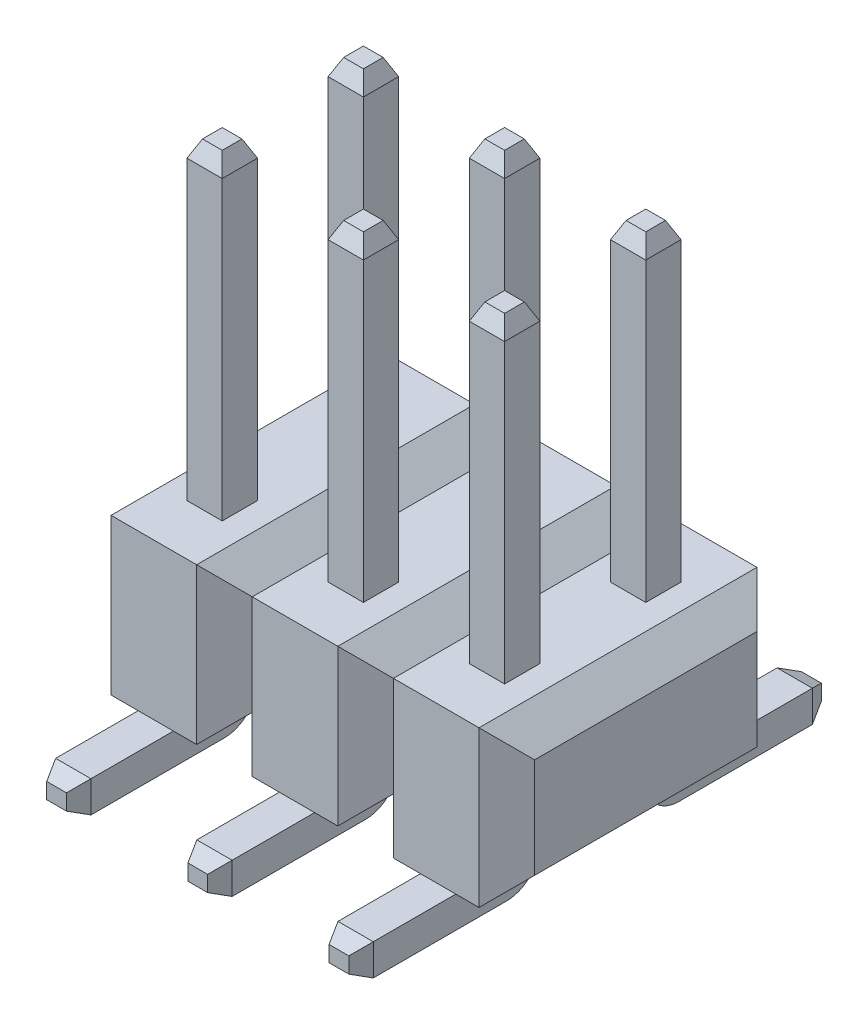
ISO-10303-21;
HEADER;
FILE_DESCRIPTION(('STEP AP214'),'2;1');
FILE_NAME('part.step','',(''),(''),'','','');
FILE_SCHEMA(('AUTOMOTIVE_DESIGN { 1 0 10303 214 1 1 1 1 }'));
ENDSEC;
DATA;
#1=APPLICATION_CONTEXT('core data for automotive mechanical design processes');
#2=APPLICATION_PROTOCOL_DEFINITION('international standard','automotive_design',2000,#1);
#3=PRODUCT_CONTEXT('',#1,'mechanical');
#4=PRODUCT('Part','Part','',(#3));
#5=PRODUCT_RELATED_PRODUCT_CATEGORY('part','',(#4));
#6=PRODUCT_DEFINITION_FORMATION('','',#4);
#7=PRODUCT_DEFINITION_CONTEXT('part definition',#1,'design');
#8=PRODUCT_DEFINITION('design','',#6,#7);
#9=PRODUCT_DEFINITION_SHAPE('','',#8);
#10=(LENGTH_UNIT() NAMED_UNIT(*) SI_UNIT(.MILLI.,.METRE.));
#11=(NAMED_UNIT(*) PLANE_ANGLE_UNIT() SI_UNIT($,.RADIAN.));
#12=(NAMED_UNIT(*) SI_UNIT($,.STERADIAN.) SOLID_ANGLE_UNIT());
#13=UNCERTAINTY_MEASURE_WITH_UNIT(LENGTH_MEASURE(1.E-05),#10,'distance_accuracy_value','');
#14=(GEOMETRIC_REPRESENTATION_CONTEXT(3) GLOBAL_UNCERTAINTY_ASSIGNED_CONTEXT((#13)) GLOBAL_UNIT_ASSIGNED_CONTEXT((#10,
#11,#12)) REPRESENTATION_CONTEXT('',''));
#15=CARTESIAN_POINT('',(0.,0.,0.));
#16=DIRECTION('',(0.,0.,1.));
#17=DIRECTION('',(1.,0.,0.));
#18=AXIS2_PLACEMENT_3D('',#15,#16,#17);
#19=CARTESIAN_POINT('',(6.0325,-0.898025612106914,-3.4525));
#20=DIRECTION('',(0.,0.,1.));
#21=DIRECTION('',(1.,0.,0.));
#22=AXIS2_PLACEMENT_3D('',#19,#20,#21);
#23=PLANE('',#22);
#24=DIRECTION('',(0.,1.,0.));
#25=VECTOR('',#24,1.);
#26=CARTESIAN_POINT('',(6.6675,-0.898025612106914,-3.4525));
#27=LINE('',#26,#25);
#28=CARTESIAN_POINT('',(6.6675,0.,-3.4525));
#29=VERTEX_POINT('',#28);
#30=CARTESIAN_POINT('',(6.6675,8.135,-3.4525));
#31=VERTEX_POINT('',#30);
#32=EDGE_CURVE('E165',#29,#31,#27,.T.);
#33=ORIENTED_EDGE('',*,*,#32,.T.);
#34=DIRECTION('',(-1.,0.,0.));
#35=VECTOR('',#34,1.);
#36=CARTESIAN_POINT('',(6.0325,8.135,-3.4525));
#37=LINE('',#36,#35);
#38=CARTESIAN_POINT('',(6.0325,8.135,-3.4525));
#39=VERTEX_POINT('',#38);
#40=EDGE_CURVE('E56',#31,#39,#37,.T.);
#41=ORIENTED_EDGE('',*,*,#40,.T.);
#42=DIRECTION('',(0.,1.,0.));
#43=VECTOR('',#42,1.);
#44=CARTESIAN_POINT('',(6.0325,-0.898025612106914,-3.4525));
#45=LINE('',#44,#43);
#46=CARTESIAN_POINT('',(6.0325,0.,-3.4525));
#47=VERTEX_POINT('',#46);
#48=EDGE_CURVE('E167',#47,#39,#45,.T.);
#49=ORIENTED_EDGE('',*,*,#48,.F.);
#50=DIRECTION('',(-1.,0.,0.));
#51=VECTOR('',#50,1.);
#52=CARTESIAN_POINT('',(6.6675,0.,-3.4525));
#53=LINE('',#52,#51);
#54=EDGE_CURVE('E148',#29,#47,#53,.T.);
#55=ORIENTED_EDGE('',*,*,#54,.F.);
#56=EDGE_LOOP('',(#33,#41,#49,#55));
#57=FACE_BOUND('',#56,.T.);
#58=ADVANCED_FACE('F47',(#57),#23,.T.);
#59=CARTESIAN_POINT('',(6.6675,-0.898025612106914,-4.0875));
#60=DIRECTION('',(1.,0.,0.));
#61=DIRECTION('',(0.,0.,-1.));
#62=AXIS2_PLACEMENT_3D('',#59,#60,#61);
#63=PLANE('',#62);
#64=DIRECTION('',(0.,0.,1.));
#65=VECTOR('',#64,1.);
#66=CARTESIAN_POINT('',(6.6675,-0.6,-4.0525));
#67=LINE('',#66,#65);
#68=CARTESIAN_POINT('',(6.6675,-0.6,-6.45));
#69=VERTEX_POINT('',#68);
#70=CARTESIAN_POINT('',(6.6675,-0.6,-4.0525));
#71=VERTEX_POINT('',#70);
#72=EDGE_CURVE('E473',#69,#71,#67,.T.);
#73=ORIENTED_EDGE('',*,*,#72,.F.);
#74=DIRECTION('',(0.,1.,0.));
#75=VECTOR('',#74,1.);
#76=CARTESIAN_POINT('',(6.6675,-0.898025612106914,-6.45));
#77=LINE('',#76,#75);
#78=CARTESIAN_POINT('',(6.6675,-0.0349999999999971,-6.44999999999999));
#79=VERTEX_POINT('',#78);
#80=EDGE_CURVE('E190',#69,#79,#77,.T.);
#81=ORIENTED_EDGE('',*,*,#80,.T.);
#82=DIRECTION('',(0.,0.,-1.));
#83=VECTOR('',#82,1.);
#84=CARTESIAN_POINT('',(6.6675,-0.0349999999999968,-4.1225));
#85=LINE('',#84,#83);
#86=CARTESIAN_POINT('',(6.6675,-0.0349999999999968,-4.1225));
#87=VERTEX_POINT('',#86);
#88=EDGE_CURVE('E159',#87,#79,#85,.T.);
#89=ORIENTED_EDGE('',*,*,#88,.F.);
#90=CARTESIAN_POINT('',(6.6675,0.,-4.1225));
#91=DIRECTION('',(1.,0.,0.));
#92=DIRECTION('',(0.,0.,-1.));
#93=AXIS2_PLACEMENT_3D('',#90,#91,#92);
#94=CIRCLE('',#93,0.0349999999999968);
#95=CARTESIAN_POINT('',(6.6675,0.,-4.0875));
#96=VERTEX_POINT('',#95);
#97=EDGE_CURVE('E140',#96,#87,#94,.T.);
#98=ORIENTED_EDGE('',*,*,#97,.F.);
#99=DIRECTION('',(0.,1.,0.));
#100=VECTOR('',#99,1.);
#101=CARTESIAN_POINT('',(6.6675,-0.898025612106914,-4.0875));
#102=LINE('',#101,#100);
#103=CARTESIAN_POINT('',(6.6675,8.135,-4.0875));
#104=VERTEX_POINT('',#103);
#105=EDGE_CURVE('E156',#96,#104,#102,.T.);
#106=ORIENTED_EDGE('',*,*,#105,.T.);
#107=DIRECTION('',(0.,0.,1.));
#108=VECTOR('',#107,1.);
#109=CARTESIAN_POINT('',(6.6675,8.135,-4.0875));
#110=LINE('',#109,#108);
#111=EDGE_CURVE('E188',#104,#31,#110,.T.);
#112=ORIENTED_EDGE('',*,*,#111,.T.);
#113=ORIENTED_EDGE('',*,*,#32,.F.);
#114=CARTESIAN_POINT('',(6.6675,0.,-4.0525));
#115=DIRECTION('',(-1.,0.,0.));
#116=DIRECTION('',(0.,0.,-1.));
#117=AXIS2_PLACEMENT_3D('',#114,#115,#116);
#118=CIRCLE('',#117,0.6);
#119=EDGE_CURVE('E160',#71,#29,#118,.T.);
#120=ORIENTED_EDGE('',*,*,#119,.F.);
#121=EDGE_LOOP('',(#73,#81,#89,#98,#106,#112,#113,#120));
#122=FACE_BOUND('',#121,.T.);
#123=ADVANCED_FACE('F154',(#122),#63,.T.);
#124=CARTESIAN_POINT('',(6.0325,-0.898025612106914,-4.0875));
#125=DIRECTION('',(0.,0.,-1.));
#126=DIRECTION('',(-1.,0.,0.));
#127=AXIS2_PLACEMENT_3D('',#124,#125,#126);
#128=PLANE('',#127);
#129=DIRECTION('',(0.,1.,0.));
#130=VECTOR('',#129,1.);
#131=CARTESIAN_POINT('',(6.0325,-0.898025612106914,-4.0875));
#132=LINE('',#131,#130);
#133=CARTESIAN_POINT('',(6.0325,0.,-4.0875));
#134=VERTEX_POINT('',#133);
#135=CARTESIAN_POINT('',(6.0325,8.135,-4.0875));
#136=VERTEX_POINT('',#135);
#137=EDGE_CURVE('E164',#134,#136,#132,.T.);
#138=ORIENTED_EDGE('',*,*,#137,.T.);
#139=DIRECTION('',(1.,0.,0.));
#140=VECTOR('',#139,1.);
#141=CARTESIAN_POINT('',(6.0325,8.135,-4.0875));
#142=LINE('',#141,#140);
#143=EDGE_CURVE('E12',#136,#104,#142,.T.);
#144=ORIENTED_EDGE('',*,*,#143,.T.);
#145=ORIENTED_EDGE('',*,*,#105,.F.);
#146=DIRECTION('',(-1.,0.,0.));
#147=VECTOR('',#146,1.);
#148=CARTESIAN_POINT('',(6.6675,0.,-4.0875));
#149=LINE('',#148,#147);
#150=EDGE_CURVE('E137',#96,#134,#149,.T.);
#151=ORIENTED_EDGE('',*,*,#150,.T.);
#152=EDGE_LOOP('',(#138,#144,#145,#151));
#153=FACE_BOUND('',#152,.T.);
#154=ADVANCED_FACE('F162',(#153),#128,.T.);
#155=CARTESIAN_POINT('',(6.0325,-0.898025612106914,-4.0875));
#156=DIRECTION('',(-1.,0.,0.));
#157=DIRECTION('',(0.,0.,1.));
#158=AXIS2_PLACEMENT_3D('',#155,#156,#157);
#159=PLANE('',#158);
#160=DIRECTION('',(0.,0.,-1.));
#161=VECTOR('',#160,1.);
#162=CARTESIAN_POINT('',(6.0325,-0.0349999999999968,-4.1225));
#163=LINE('',#162,#161);
#164=CARTESIAN_POINT('',(6.0325,-0.0349999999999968,-4.1225));
#165=VERTEX_POINT('',#164);
#166=CARTESIAN_POINT('',(6.0325,-0.0349999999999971,-6.44999999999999));
#167=VERTEX_POINT('',#166);
#168=EDGE_CURVE('E460',#165,#167,#163,.T.);
#169=ORIENTED_EDGE('',*,*,#168,.T.);
#170=DIRECTION('',(0.,-1.,0.));
#171=VECTOR('',#170,1.);
#172=CARTESIAN_POINT('',(6.0325,-0.898025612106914,-6.45));
#173=LINE('',#172,#171);
#174=CARTESIAN_POINT('',(6.0325,-0.6,-6.45));
#175=VERTEX_POINT('',#174);
#176=EDGE_CURVE('E194',#167,#175,#173,.T.);
#177=ORIENTED_EDGE('',*,*,#176,.T.);
#178=DIRECTION('',(0.,0.,1.));
#179=VECTOR('',#178,1.);
#180=CARTESIAN_POINT('',(6.0325,-0.6,-4.0525));
#181=LINE('',#180,#179);
#182=CARTESIAN_POINT('',(6.0325,-0.6,-4.0525));
#183=VERTEX_POINT('',#182);
#184=EDGE_CURVE('E457',#175,#183,#181,.T.);
#185=ORIENTED_EDGE('',*,*,#184,.T.);
#186=CARTESIAN_POINT('',(6.0325,0.,-4.0525));
#187=DIRECTION('',(-1.,0.,0.));
#188=DIRECTION('',(0.,0.,-1.));
#189=AXIS2_PLACEMENT_3D('',#186,#187,#188);
#190=CIRCLE('',#189,0.6);
#191=EDGE_CURVE('E215',#183,#47,#190,.T.);
#192=ORIENTED_EDGE('',*,*,#191,.T.);
#193=ORIENTED_EDGE('',*,*,#48,.T.);
#194=DIRECTION('',(0.,0.,-1.));
#195=VECTOR('',#194,1.);
#196=CARTESIAN_POINT('',(6.0325,8.135,-4.0875));
#197=LINE('',#196,#195);
#198=EDGE_CURVE('E192',#39,#136,#197,.T.);
#199=ORIENTED_EDGE('',*,*,#198,.T.);
#200=ORIENTED_EDGE('',*,*,#137,.F.);
#201=CARTESIAN_POINT('',(6.0325,0.,-4.1225));
#202=DIRECTION('',(1.,0.,0.));
#203=DIRECTION('',(0.,0.,-1.));
#204=AXIS2_PLACEMENT_3D('',#201,#202,#203);
#205=CIRCLE('',#204,0.0349999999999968);
#206=EDGE_CURVE('E142',#134,#165,#205,.T.);
#207=ORIENTED_EDGE('',*,*,#206,.T.);
#208=EDGE_LOOP('',(#169,#177,#185,#192,#193,#199,#200,#207));
#209=FACE_BOUND('',#208,.T.);
#210=ADVANCED_FACE('F232',(#209),#159,.T.);
#211=CARTESIAN_POINT('',(5.08,8.435,0.));
#212=DIRECTION('',(0.,1.,0.));
#213=DIRECTION('',(0.,0.,1.));
#214=AXIS2_PLACEMENT_3D('',#211,#212,#213);
#215=PLANE('',#214);
#216=DIRECTION('',(1.,0.,0.));
#217=VECTOR('',#216,1.);
#218=CARTESIAN_POINT('',(5.08,8.435,-3.5923922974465));
#219=LINE('',#218,#217);
#220=CARTESIAN_POINT('',(6.1723922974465,8.435,-3.5923922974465));
#221=VERTEX_POINT('',#220);
#222=CARTESIAN_POINT('',(6.5276077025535,8.435,-3.5923922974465));
#223=VERTEX_POINT('',#222);
#224=EDGE_CURVE('E64',#221,#223,#219,.T.);
#225=ORIENTED_EDGE('',*,*,#224,.T.);
#226=DIRECTION('',(0.,0.,-1.));
#227=VECTOR('',#226,1.);
#228=CARTESIAN_POINT('',(6.5276077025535,8.435,0.));
#229=LINE('',#228,#227);
#230=CARTESIAN_POINT('',(6.5276077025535,8.435,-3.9476077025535));
#231=VERTEX_POINT('',#230);
#232=EDGE_CURVE('E202',#223,#231,#229,.T.);
#233=ORIENTED_EDGE('',*,*,#232,.T.);
#234=DIRECTION('',(-1.,0.,0.));
#235=VECTOR('',#234,1.);
#236=CARTESIAN_POINT('',(5.08,8.435,-3.9476077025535));
#237=LINE('',#236,#235);
#238=CARTESIAN_POINT('',(6.1723922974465,8.435,-3.9476077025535));
#239=VERTEX_POINT('',#238);
#240=EDGE_CURVE('E198',#231,#239,#237,.T.);
#241=ORIENTED_EDGE('',*,*,#240,.T.);
#242=DIRECTION('',(0.,0.,1.));
#243=VECTOR('',#242,1.);
#244=CARTESIAN_POINT('',(6.1723922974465,8.435,0.));
#245=LINE('',#244,#243);
#246=EDGE_CURVE('E69',#239,#221,#245,.T.);
#247=ORIENTED_EDGE('',*,*,#246,.T.);
#248=EDGE_LOOP('',(#225,#233,#241,#247));
#249=FACE_BOUND('',#248,.T.);
#250=ADVANCED_FACE('F245',(#249),#215,.T.);
#251=CARTESIAN_POINT('',(6.6675,0.,-4.0525));
#252=DIRECTION('',(-1.,0.,0.));
#253=DIRECTION('',(0.,0.,1.));
#254=AXIS2_PLACEMENT_3D('',#251,#252,#253);
#255=CYLINDRICAL_SURFACE('',#254,0.6);
#256=ORIENTED_EDGE('',*,*,#191,.F.);
#257=DIRECTION('',(-1.,0.,0.));
#258=VECTOR('',#257,1.);
#259=CARTESIAN_POINT('',(6.6675,-0.6,-4.0525));
#260=LINE('',#259,#258);
#261=EDGE_CURVE('E170',#71,#183,#260,.T.);
#262=ORIENTED_EDGE('',*,*,#261,.F.);
#263=ORIENTED_EDGE('',*,*,#119,.T.);
#264=ORIENTED_EDGE('',*,*,#54,.T.);
#265=EDGE_LOOP('',(#256,#262,#263,#264));
#266=FACE_BOUND('',#265,.T.);
#267=ADVANCED_FACE('F247',(#266),#255,.T.);
#268=CARTESIAN_POINT('',(6.6675,-0.6,-4.0525));
#269=DIRECTION('',(0.,-1.,0.));
#270=DIRECTION('',(0.,0.,-1.));
#271=AXIS2_PLACEMENT_3D('',#268,#269,#270);
#272=PLANE('',#271);
#273=ORIENTED_EDGE('',*,*,#184,.F.);
#274=DIRECTION('',(1.,0.,0.));
#275=VECTOR('',#274,1.);
#276=CARTESIAN_POINT('',(6.6675,-0.6,-6.45));
#277=LINE('',#276,#275);
#278=EDGE_CURVE('E196',#175,#69,#277,.T.);
#279=ORIENTED_EDGE('',*,*,#278,.T.);
#280=ORIENTED_EDGE('',*,*,#72,.T.);
#281=ORIENTED_EDGE('',*,*,#261,.T.);
#282=EDGE_LOOP('',(#273,#279,#280,#281));
#283=FACE_BOUND('',#282,.T.);
#284=ADVANCED_FACE('F253',(#283),#272,.T.);
#285=CARTESIAN_POINT('',(6.6675,-0.6,-6.75));
#286=DIRECTION('',(0.,0.,-1.));
#287=DIRECTION('',(-1.,0.,0.));
#288=AXIS2_PLACEMENT_3D('',#285,#286,#287);
#289=PLANE('',#288);
#290=DIRECTION('',(0.,1.,0.));
#291=VECTOR('',#290,1.);
#292=CARTESIAN_POINT('',(6.1723922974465,-0.6,-6.75));
#293=LINE('',#292,#291);
#294=CARTESIAN_POINT('',(6.1723922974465,-0.4601077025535,-6.75));
#295=VERTEX_POINT('',#294);
#296=CARTESIAN_POINT('',(6.1723922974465,-0.174892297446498,-6.75));
#297=VERTEX_POINT('',#296);
#298=EDGE_CURVE('E181',#295,#297,#293,.T.);
#299=ORIENTED_EDGE('',*,*,#298,.T.);
#300=DIRECTION('',(1.,0.,0.));
#301=VECTOR('',#300,1.);
#302=CARTESIAN_POINT('',(6.6675,-0.174892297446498,-6.75));
#303=LINE('',#302,#301);
#304=CARTESIAN_POINT('',(6.5276077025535,-0.174892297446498,-6.75));
#305=VERTEX_POINT('',#304);
#306=EDGE_CURVE('E185',#297,#305,#303,.T.);
#307=ORIENTED_EDGE('',*,*,#306,.T.);
#308=DIRECTION('',(0.,-1.,0.));
#309=VECTOR('',#308,1.);
#310=CARTESIAN_POINT('',(6.5276077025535,-0.6,-6.75));
#311=LINE('',#310,#309);
#312=CARTESIAN_POINT('',(6.5276077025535,-0.4601077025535,-6.75));
#313=VERTEX_POINT('',#312);
#314=EDGE_CURVE('E183',#305,#313,#311,.T.);
#315=ORIENTED_EDGE('',*,*,#314,.T.);
#316=DIRECTION('',(-1.,0.,0.));
#317=VECTOR('',#316,1.);
#318=CARTESIAN_POINT('',(6.6675,-0.4601077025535,-6.75));
#319=LINE('',#318,#317);
#320=EDGE_CURVE('E179',#313,#295,#319,.T.);
#321=ORIENTED_EDGE('',*,*,#320,.T.);
#322=EDGE_LOOP('',(#299,#307,#315,#321));
#323=FACE_BOUND('',#322,.T.);
#324=ADVANCED_FACE('F319',(#323),#289,.T.);
#325=CARTESIAN_POINT('',(6.6675,-0.0349999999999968,-4.1225));
#326=DIRECTION('',(0.,1.,0.));
#327=DIRECTION('',(0.,0.,1.));
#328=AXIS2_PLACEMENT_3D('',#325,#326,#327);
#329=PLANE('',#328);
#330=ORIENTED_EDGE('',*,*,#88,.T.);
#331=DIRECTION('',(-1.,0.,0.));
#332=VECTOR('',#331,1.);
#333=CARTESIAN_POINT('',(6.6675,-0.0349999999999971,-6.45));
#334=LINE('',#333,#332);
#335=EDGE_CURVE('E176',#79,#167,#334,.T.);
#336=ORIENTED_EDGE('',*,*,#335,.T.);
#337=ORIENTED_EDGE('',*,*,#168,.F.);
#338=DIRECTION('',(-1.,0.,0.));
#339=VECTOR('',#338,1.);
#340=CARTESIAN_POINT('',(6.6675,-0.0349999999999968,-4.1225));
#341=LINE('',#340,#339);
#342=EDGE_CURVE('E147',#87,#165,#341,.T.);
#343=ORIENTED_EDGE('',*,*,#342,.F.);
#344=EDGE_LOOP('',(#330,#336,#337,#343));
#345=FACE_BOUND('',#344,.T.);
#346=ADVANCED_FACE('F312',(#345),#329,.T.);
#347=CARTESIAN_POINT('',(6.6675,0.,-4.1225));
#348=DIRECTION('',(-1.,0.,0.));
#349=DIRECTION('',(0.,0.,1.));
#350=AXIS2_PLACEMENT_3D('',#347,#348,#349);
#351=CYLINDRICAL_SURFACE('',#350,0.0349999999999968);
#352=ORIENTED_EDGE('',*,*,#206,.F.);
#353=ORIENTED_EDGE('',*,*,#150,.F.);
#354=ORIENTED_EDGE('',*,*,#97,.T.);
#355=ORIENTED_EDGE('',*,*,#342,.T.);
#356=EDGE_LOOP('',(#352,#353,#354,#355));
#357=FACE_BOUND('',#356,.T.);
#358=ADVANCED_FACE('F139',(#357),#351,.F.);
#359=CARTESIAN_POINT('',(6.6675,-0.4601077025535,-6.75));
#360=DIRECTION('',(0.,0.906307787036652,0.422618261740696));
#361=DIRECTION('',(-1.,0.,0.));
#362=AXIS2_PLACEMENT_3D('',#359,#360,#361);
#363=PLANE('',#362);
#364=DIRECTION('',(0.389281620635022,0.389281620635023,-0.834817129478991));
#365=VECTOR('',#364,1.);
#366=CARTESIAN_POINT('',(6.24742100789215,-0.385078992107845,-6.91089958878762));
#367=LINE('',#366,#365);
#368=EDGE_CURVE('E209',#295,#175,#367,.F.);
#369=ORIENTED_EDGE('',*,*,#368,.F.);
#370=ORIENTED_EDGE('',*,*,#320,.F.);
#371=DIRECTION('',(0.389281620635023,-0.389281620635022,0.83481712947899));
#372=VECTOR('',#371,1.);
#373=CARTESIAN_POINT('',(6.54880700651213,-0.48130700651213,-6.70453794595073));
#374=LINE('',#373,#372);
#375=EDGE_CURVE('E212',#69,#313,#374,.F.);
#376=ORIENTED_EDGE('',*,*,#375,.F.);
#377=ORIENTED_EDGE('',*,*,#278,.F.);
#378=EDGE_LOOP('',(#369,#370,#376,#377));
#379=FACE_BOUND('',#378,.T.);
#380=ADVANCED_FACE('F276',(#379),#363,.F.);
#381=CARTESIAN_POINT('',(6.5276077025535,-0.6,-6.75));
#382=DIRECTION('',(-0.906307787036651,0.,0.422618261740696));
#383=DIRECTION('',(0.,-1.,0.));
#384=AXIS2_PLACEMENT_3D('',#381,#382,#383);
#385=PLANE('',#384);
#386=ORIENTED_EDGE('',*,*,#375,.T.);
#387=ORIENTED_EDGE('',*,*,#314,.F.);
#388=DIRECTION('',(0.389281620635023,0.389281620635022,0.83481712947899));
#389=VECTOR('',#388,1.);
#390=CARTESIAN_POINT('',(6.46318680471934,-0.239313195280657,-6.8881510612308));
#391=LINE('',#390,#389);
#392=EDGE_CURVE('E207',#79,#305,#391,.F.);
#393=ORIENTED_EDGE('',*,*,#392,.F.);
#394=ORIENTED_EDGE('',*,*,#80,.F.);
#395=EDGE_LOOP('',(#386,#387,#393,#394));
#396=FACE_BOUND('',#395,.T.);
#397=ADVANCED_FACE('F272',(#396),#385,.F.);
#398=CARTESIAN_POINT('',(6.0325,-0.898025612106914,-6.45));
#399=DIRECTION('',(0.906307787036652,0.,0.422618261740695));
#400=DIRECTION('',(0.,-1.,0.));
#401=AXIS2_PLACEMENT_3D('',#398,#399,#400);
#402=PLANE('',#401);
#403=ORIENTED_EDGE('',*,*,#368,.T.);
#404=ORIENTED_EDGE('',*,*,#176,.F.);
#405=DIRECTION('',(0.389281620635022,-0.389281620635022,-0.834817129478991));
#406=VECTOR('',#405,1.);
#407=CARTESIAN_POINT('',(6.16328305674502,-0.165783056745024,-6.7304651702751));
#408=LINE('',#407,#406);
#409=EDGE_CURVE('E205',#297,#167,#408,.F.);
#410=ORIENTED_EDGE('',*,*,#409,.F.);
#411=ORIENTED_EDGE('',*,*,#298,.F.);
#412=EDGE_LOOP('',(#403,#404,#410,#411));
#413=FACE_BOUND('',#412,.T.);
#414=ADVANCED_FACE('F268',(#413),#402,.F.);
#415=CARTESIAN_POINT('',(6.6675,-0.0349999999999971,-6.45));
#416=DIRECTION('',(0.,-0.906307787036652,0.422618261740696));
#417=DIRECTION('',(-1.,0.,0.));
#418=AXIS2_PLACEMENT_3D('',#415,#416,#417);
#419=PLANE('',#418);
#420=ORIENTED_EDGE('',*,*,#392,.T.);
#421=ORIENTED_EDGE('',*,*,#306,.F.);
#422=ORIENTED_EDGE('',*,*,#409,.T.);
#423=ORIENTED_EDGE('',*,*,#335,.F.);
#424=EDGE_LOOP('',(#420,#421,#422,#423));
#425=FACE_BOUND('',#424,.T.);
#426=ADVANCED_FACE('F265',(#425),#419,.F.);
#427=CARTESIAN_POINT('',(6.1723922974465,8.435,0.));
#428=DIRECTION('',(0.906307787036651,-0.422618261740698,0.));
#429=DIRECTION('',(0.,0.,1.));
#430=AXIS2_PLACEMENT_3D('',#427,#428,#429);
#431=PLANE('',#430);
#432=DIRECTION('',(0.389281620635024,0.834817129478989,0.389281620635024));
#433=VECTOR('',#432,1.);
#434=CARTESIAN_POINT('',(6.00685097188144,8.0799954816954,-4.11314902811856));
#435=LINE('',#434,#433);
#436=EDGE_CURVE('E219',#136,#239,#435,.T.);
#437=ORIENTED_EDGE('',*,*,#436,.F.);
#438=ORIENTED_EDGE('',*,*,#198,.F.);
#439=DIRECTION('',(0.389281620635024,0.834817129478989,-0.389281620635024));
#440=VECTOR('',#439,1.);
#441=CARTESIAN_POINT('',(5.62800052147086,7.26754806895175,-3.04800052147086));
#442=LINE('',#441,#440);
#443=EDGE_CURVE('E51',#221,#39,#442,.F.);
#444=ORIENTED_EDGE('',*,*,#443,.F.);
#445=ORIENTED_EDGE('',*,*,#246,.F.);
#446=EDGE_LOOP('',(#437,#438,#444,#445));
#447=FACE_BOUND('',#446,.T.);
#448=ADVANCED_FACE('F49',(#447),#431,.F.);
#449=CARTESIAN_POINT('',(5.08,8.435,-3.5923922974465));
#450=DIRECTION('',(0.,-0.422618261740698,-0.906307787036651));
#451=DIRECTION('',(1.,0.,0.));
#452=AXIS2_PLACEMENT_3D('',#449,#450,#451);
#453=PLANE('',#452);
#454=ORIENTED_EDGE('',*,*,#443,.T.);
#455=ORIENTED_EDGE('',*,*,#40,.F.);
#456=DIRECTION('',(-0.389281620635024,0.834817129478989,-0.389281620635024));
#457=VECTOR('',#456,1.);
#458=CARTESIAN_POINT('',(6.30823697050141,8.90544205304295,-3.81176302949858));
#459=LINE('',#458,#457);
#460=EDGE_CURVE('E218',#223,#31,#459,.F.);
#461=ORIENTED_EDGE('',*,*,#460,.F.);
#462=ORIENTED_EDGE('',*,*,#224,.F.);
#463=EDGE_LOOP('',(#454,#455,#461,#462));
#464=FACE_BOUND('',#463,.T.);
#465=ADVANCED_FACE('F227',(#464),#453,.F.);
#466=CARTESIAN_POINT('',(5.08,8.435,-3.9476077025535));
#467=DIRECTION('',(0.,-0.422618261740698,0.906307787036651));
#468=DIRECTION('',(-1.,0.,0.));
#469=AXIS2_PLACEMENT_3D('',#466,#467,#468);
#470=PLANE('',#469);
#471=ORIENTED_EDGE('',*,*,#436,.T.);
#472=ORIENTED_EDGE('',*,*,#240,.F.);
#473=DIRECTION('',(0.389281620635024,-0.834817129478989,-0.389281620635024));
#474=VECTOR('',#473,1.);
#475=CARTESIAN_POINT('',(6.30823697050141,8.90544205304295,-3.72823697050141));
#476=LINE('',#475,#474);
#477=EDGE_CURVE('E216',#104,#231,#476,.F.);
#478=ORIENTED_EDGE('',*,*,#477,.F.);
#479=ORIENTED_EDGE('',*,*,#143,.F.);
#480=EDGE_LOOP('',(#471,#472,#478,#479));
#481=FACE_BOUND('',#480,.T.);
#482=ADVANCED_FACE('F244',(#481),#470,.F.);
#483=CARTESIAN_POINT('',(6.5276077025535,8.435,0.));
#484=DIRECTION('',(-0.906307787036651,-0.422618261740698,0.));
#485=DIRECTION('',(0.,0.,-1.));
#486=AXIS2_PLACEMENT_3D('',#483,#484,#485);
#487=PLANE('',#486);
#488=ORIENTED_EDGE('',*,*,#460,.T.);
#489=ORIENTED_EDGE('',*,*,#111,.F.);
#490=ORIENTED_EDGE('',*,*,#477,.T.);
#491=ORIENTED_EDGE('',*,*,#232,.F.);
#492=EDGE_LOOP('',(#488,#489,#490,#491));
#493=FACE_BOUND('',#492,.T.);
#494=ADVANCED_FACE('F242',(#493),#487,.F.);
#495=CLOSED_SHELL('',(#58,#123,#154,#210,#250,#267,#284,#324,#346,#358,#380,#397,#414,#426,#448,
#465,#482,#494));
#496=MANIFOLD_SOLID_BREP('B2',#495);
#497=CARTESIAN_POINT('',(3.4925,-0.898025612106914,-3.4525));
#498=DIRECTION('',(0.,0.,1.));
#499=DIRECTION('',(1.,0.,0.));
#500=AXIS2_PLACEMENT_3D('',#497,#498,#499);
#501=PLANE('',#500);
#502=DIRECTION('',(0.,1.,0.));
#503=VECTOR('',#502,1.);
#504=CARTESIAN_POINT('',(4.1275,-0.898025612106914,-3.4525));
#505=LINE('',#504,#503);
#506=CARTESIAN_POINT('',(4.1275,0.,-3.4525));
#507=VERTEX_POINT('',#506);
#508=CARTESIAN_POINT('',(4.1275,8.135,-3.4525));
#509=VERTEX_POINT('',#508);
#510=EDGE_CURVE('E613',#507,#509,#505,.T.);
#511=ORIENTED_EDGE('',*,*,#510,.T.);
#512=DIRECTION('',(-1.,0.,0.));
#513=VECTOR('',#512,1.);
#514=CARTESIAN_POINT('',(3.4925,8.135,-3.4525));
#515=LINE('',#514,#513);
#516=CARTESIAN_POINT('',(3.4925,8.135,-3.4525));
#517=VERTEX_POINT('',#516);
#518=EDGE_CURVE('E504',#509,#517,#515,.T.);
#519=ORIENTED_EDGE('',*,*,#518,.T.);
#520=DIRECTION('',(0.,1.,0.));
#521=VECTOR('',#520,1.);
#522=CARTESIAN_POINT('',(3.4925,-0.898025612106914,-3.4525));
#523=LINE('',#522,#521);
#524=CARTESIAN_POINT('',(3.4925,0.,-3.4525));
#525=VERTEX_POINT('',#524);
#526=EDGE_CURVE('E615',#525,#517,#523,.T.);
#527=ORIENTED_EDGE('',*,*,#526,.F.);
#528=DIRECTION('',(-1.,0.,0.));
#529=VECTOR('',#528,1.);
#530=CARTESIAN_POINT('',(4.1275,0.,-3.4525));
#531=LINE('',#530,#529);
#532=EDGE_CURVE('E596',#507,#525,#531,.T.);
#533=ORIENTED_EDGE('',*,*,#532,.F.);
#534=EDGE_LOOP('',(#511,#519,#527,#533));
#535=FACE_BOUND('',#534,.T.);
#536=ADVANCED_FACE('F495',(#535),#501,.T.);
#537=CARTESIAN_POINT('',(4.1275,-0.898025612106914,-4.0875));
#538=DIRECTION('',(1.,0.,0.));
#539=DIRECTION('',(0.,0.,-1.));
#540=AXIS2_PLACEMENT_3D('',#537,#538,#539);
#541=PLANE('',#540);
#542=DIRECTION('',(0.,0.,1.));
#543=VECTOR('',#542,1.);
#544=CARTESIAN_POINT('',(4.1275,-0.6,-4.0525));
#545=LINE('',#544,#543);
#546=CARTESIAN_POINT('',(4.1275,-0.6,-6.45));
#547=VERTEX_POINT('',#546);
#548=CARTESIAN_POINT('',(4.1275,-0.6,-4.0525));
#549=VERTEX_POINT('',#548);
#550=EDGE_CURVE('E921',#547,#549,#545,.T.);
#551=ORIENTED_EDGE('',*,*,#550,.F.);
#552=DIRECTION('',(0.,1.,0.));
#553=VECTOR('',#552,1.);
#554=CARTESIAN_POINT('',(4.1275,-0.898025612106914,-6.45));
#555=LINE('',#554,#553);
#556=CARTESIAN_POINT('',(4.1275,-0.0349999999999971,-6.44999999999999));
#557=VERTEX_POINT('',#556);
#558=EDGE_CURVE('E638',#547,#557,#555,.T.);
#559=ORIENTED_EDGE('',*,*,#558,.T.);
#560=DIRECTION('',(0.,0.,-1.));
#561=VECTOR('',#560,1.);
#562=CARTESIAN_POINT('',(4.1275,-0.0349999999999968,-4.1225));
#563=LINE('',#562,#561);
#564=CARTESIAN_POINT('',(4.1275,-0.0349999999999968,-4.1225));
#565=VERTEX_POINT('',#564);
#566=EDGE_CURVE('E607',#565,#557,#563,.T.);
#567=ORIENTED_EDGE('',*,*,#566,.F.);
#568=CARTESIAN_POINT('',(4.1275,0.,-4.1225));
#569=DIRECTION('',(1.,0.,0.));
#570=DIRECTION('',(0.,0.,-1.));
#571=AXIS2_PLACEMENT_3D('',#568,#569,#570);
#572=CIRCLE('',#571,0.0349999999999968);
#573=CARTESIAN_POINT('',(4.1275,0.,-4.0875));
#574=VERTEX_POINT('',#573);
#575=EDGE_CURVE('E588',#574,#565,#572,.T.);
#576=ORIENTED_EDGE('',*,*,#575,.F.);
#577=DIRECTION('',(0.,1.,0.));
#578=VECTOR('',#577,1.);
#579=CARTESIAN_POINT('',(4.1275,-0.898025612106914,-4.0875));
#580=LINE('',#579,#578);
#581=CARTESIAN_POINT('',(4.1275,8.135,-4.0875));
#582=VERTEX_POINT('',#581);
#583=EDGE_CURVE('E604',#574,#582,#580,.T.);
#584=ORIENTED_EDGE('',*,*,#583,.T.);
#585=DIRECTION('',(0.,0.,1.));
#586=VECTOR('',#585,1.);
#587=CARTESIAN_POINT('',(4.1275,8.135,-4.0875));
#588=LINE('',#587,#586);
#589=EDGE_CURVE('E636',#582,#509,#588,.T.);
#590=ORIENTED_EDGE('',*,*,#589,.T.);
#591=ORIENTED_EDGE('',*,*,#510,.F.);
#592=CARTESIAN_POINT('',(4.1275,0.,-4.0525));
#593=DIRECTION('',(-1.,0.,0.));
#594=DIRECTION('',(0.,0.,-1.));
#595=AXIS2_PLACEMENT_3D('',#592,#593,#594);
#596=CIRCLE('',#595,0.6);
#597=EDGE_CURVE('E608',#549,#507,#596,.T.);
#598=ORIENTED_EDGE('',*,*,#597,.F.);
#599=EDGE_LOOP('',(#551,#559,#567,#576,#584,#590,#591,#598));
#600=FACE_BOUND('',#599,.T.);
#601=ADVANCED_FACE('F602',(#600),#541,.T.);
#602=CARTESIAN_POINT('',(3.4925,-0.898025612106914,-4.0875));
#603=DIRECTION('',(0.,0.,-1.));
#604=DIRECTION('',(-1.,0.,0.));
#605=AXIS2_PLACEMENT_3D('',#602,#603,#604);
#606=PLANE('',#605);
#607=DIRECTION('',(0.,1.,0.));
#608=VECTOR('',#607,1.);
#609=CARTESIAN_POINT('',(3.4925,-0.898025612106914,-4.0875));
#610=LINE('',#609,#608);
#611=CARTESIAN_POINT('',(3.4925,0.,-4.0875));
#612=VERTEX_POINT('',#611);
#613=CARTESIAN_POINT('',(3.4925,8.135,-4.0875));
#614=VERTEX_POINT('',#613);
#615=EDGE_CURVE('E612',#612,#614,#610,.T.);
#616=ORIENTED_EDGE('',*,*,#615,.T.);
#617=DIRECTION('',(1.,0.,0.));
#618=VECTOR('',#617,1.);
#619=CARTESIAN_POINT('',(3.4925,8.135,-4.0875));
#620=LINE('',#619,#618);
#621=EDGE_CURVE('E45',#614,#582,#620,.T.);
#622=ORIENTED_EDGE('',*,*,#621,.T.);
#623=ORIENTED_EDGE('',*,*,#583,.F.);
#624=DIRECTION('',(-1.,0.,0.));
#625=VECTOR('',#624,1.);
#626=CARTESIAN_POINT('',(4.1275,0.,-4.0875));
#627=LINE('',#626,#625);
#628=EDGE_CURVE('E585',#574,#612,#627,.T.);
#629=ORIENTED_EDGE('',*,*,#628,.T.);
#630=EDGE_LOOP('',(#616,#622,#623,#629));
#631=FACE_BOUND('',#630,.T.);
#632=ADVANCED_FACE('F610',(#631),#606,.T.);
#633=CARTESIAN_POINT('',(3.4925,-0.898025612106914,-4.0875));
#634=DIRECTION('',(-1.,0.,0.));
#635=DIRECTION('',(0.,0.,1.));
#636=AXIS2_PLACEMENT_3D('',#633,#634,#635);
#637=PLANE('',#636);
#638=DIRECTION('',(0.,0.,-1.));
#639=VECTOR('',#638,1.);
#640=CARTESIAN_POINT('',(3.4925,-0.0349999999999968,-4.1225));
#641=LINE('',#640,#639);
#642=CARTESIAN_POINT('',(3.4925,-0.0349999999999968,-4.1225));
#643=VERTEX_POINT('',#642);
#644=CARTESIAN_POINT('',(3.4925,-0.0349999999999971,-6.44999999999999));
#645=VERTEX_POINT('',#644);
#646=EDGE_CURVE('E908',#643,#645,#641,.T.);
#647=ORIENTED_EDGE('',*,*,#646,.T.);
#648=DIRECTION('',(0.,-1.,0.));
#649=VECTOR('',#648,1.);
#650=CARTESIAN_POINT('',(3.4925,-0.898025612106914,-6.45));
#651=LINE('',#650,#649);
#652=CARTESIAN_POINT('',(3.4925,-0.6,-6.45));
#653=VERTEX_POINT('',#652);
#654=EDGE_CURVE('E642',#645,#653,#651,.T.);
#655=ORIENTED_EDGE('',*,*,#654,.T.);
#656=DIRECTION('',(0.,0.,1.));
#657=VECTOR('',#656,1.);
#658=CARTESIAN_POINT('',(3.4925,-0.6,-4.0525));
#659=LINE('',#658,#657);
#660=CARTESIAN_POINT('',(3.4925,-0.6,-4.0525));
#661=VERTEX_POINT('',#660);
#662=EDGE_CURVE('E905',#653,#661,#659,.T.);
#663=ORIENTED_EDGE('',*,*,#662,.T.);
#664=CARTESIAN_POINT('',(3.4925,0.,-4.0525));
#665=DIRECTION('',(-1.,0.,0.));
#666=DIRECTION('',(0.,0.,-1.));
#667=AXIS2_PLACEMENT_3D('',#664,#665,#666);
#668=CIRCLE('',#667,0.6);
#669=EDGE_CURVE('E663',#661,#525,#668,.T.);
#670=ORIENTED_EDGE('',*,*,#669,.T.);
#671=ORIENTED_EDGE('',*,*,#526,.T.);
#672=DIRECTION('',(0.,0.,-1.));
#673=VECTOR('',#672,1.);
#674=CARTESIAN_POINT('',(3.4925,8.135,-4.0875));
#675=LINE('',#674,#673);
#676=EDGE_CURVE('E640',#517,#614,#675,.T.);
#677=ORIENTED_EDGE('',*,*,#676,.T.);
#678=ORIENTED_EDGE('',*,*,#615,.F.);
#679=CARTESIAN_POINT('',(3.4925,0.,-4.1225));
#680=DIRECTION('',(1.,0.,0.));
#681=DIRECTION('',(0.,0.,-1.));
#682=AXIS2_PLACEMENT_3D('',#679,#680,#681);
#683=CIRCLE('',#682,0.0349999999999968);
#684=EDGE_CURVE('E590',#612,#643,#683,.T.);
#685=ORIENTED_EDGE('',*,*,#684,.T.);
#686=EDGE_LOOP('',(#647,#655,#663,#670,#671,#677,#678,#685));
#687=FACE_BOUND('',#686,.T.);
#688=ADVANCED_FACE('F680',(#687),#637,.T.);
#689=CARTESIAN_POINT('',(2.54,8.435,0.));
#690=DIRECTION('',(0.,1.,0.));
#691=DIRECTION('',(0.,0.,1.));
#692=AXIS2_PLACEMENT_3D('',#689,#690,#691);
#693=PLANE('',#692);
#694=DIRECTION('',(1.,0.,0.));
#695=VECTOR('',#694,1.);
#696=CARTESIAN_POINT('',(2.54,8.435,-3.5923922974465));
#697=LINE('',#696,#695);
#698=CARTESIAN_POINT('',(3.6323922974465,8.435,-3.5923922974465));
#699=VERTEX_POINT('',#698);
#700=CARTESIAN_POINT('',(3.9876077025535,8.435,-3.5923922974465));
#701=VERTEX_POINT('',#700);
#702=EDGE_CURVE('E512',#699,#701,#697,.T.);
#703=ORIENTED_EDGE('',*,*,#702,.T.);
#704=DIRECTION('',(0.,0.,-1.));
#705=VECTOR('',#704,1.);
#706=CARTESIAN_POINT('',(3.9876077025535,8.435,0.));
#707=LINE('',#706,#705);
#708=CARTESIAN_POINT('',(3.9876077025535,8.435,-3.9476077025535));
#709=VERTEX_POINT('',#708);
#710=EDGE_CURVE('E650',#701,#709,#707,.T.);
#711=ORIENTED_EDGE('',*,*,#710,.T.);
#712=DIRECTION('',(-1.,0.,0.));
#713=VECTOR('',#712,1.);
#714=CARTESIAN_POINT('',(2.54,8.435,-3.9476077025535));
#715=LINE('',#714,#713);
#716=CARTESIAN_POINT('',(3.6323922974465,8.435,-3.9476077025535));
#717=VERTEX_POINT('',#716);
#718=EDGE_CURVE('E646',#709,#717,#715,.T.);
#719=ORIENTED_EDGE('',*,*,#718,.T.);
#720=DIRECTION('',(0.,0.,1.));
#721=VECTOR('',#720,1.);
#722=CARTESIAN_POINT('',(3.6323922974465,8.435,0.));
#723=LINE('',#722,#721);
#724=EDGE_CURVE('E517',#717,#699,#723,.T.);
#725=ORIENTED_EDGE('',*,*,#724,.T.);
#726=EDGE_LOOP('',(#703,#711,#719,#725));
#727=FACE_BOUND('',#726,.T.);
#728=ADVANCED_FACE('F693',(#727),#693,.T.);
#729=CARTESIAN_POINT('',(4.1275,0.,-4.0525));
#730=DIRECTION('',(-1.,0.,0.));
#731=DIRECTION('',(0.,0.,1.));
#732=AXIS2_PLACEMENT_3D('',#729,#730,#731);
#733=CYLINDRICAL_SURFACE('',#732,0.6);
#734=ORIENTED_EDGE('',*,*,#669,.F.);
#735=DIRECTION('',(-1.,0.,0.));
#736=VECTOR('',#735,1.);
#737=CARTESIAN_POINT('',(4.1275,-0.6,-4.0525));
#738=LINE('',#737,#736);
#739=EDGE_CURVE('E618',#549,#661,#738,.T.);
#740=ORIENTED_EDGE('',*,*,#739,.F.);
#741=ORIENTED_EDGE('',*,*,#597,.T.);
#742=ORIENTED_EDGE('',*,*,#532,.T.);
#743=EDGE_LOOP('',(#734,#740,#741,#742));
#744=FACE_BOUND('',#743,.T.);
#745=ADVANCED_FACE('F695',(#744),#733,.T.);
#746=CARTESIAN_POINT('',(4.1275,-0.6,-4.0525));
#747=DIRECTION('',(0.,-1.,0.));
#748=DIRECTION('',(0.,0.,-1.));
#749=AXIS2_PLACEMENT_3D('',#746,#747,#748);
#750=PLANE('',#749);
#751=ORIENTED_EDGE('',*,*,#662,.F.);
#752=DIRECTION('',(1.,0.,0.));
#753=VECTOR('',#752,1.);
#754=CARTESIAN_POINT('',(4.1275,-0.6,-6.45));
#755=LINE('',#754,#753);
#756=EDGE_CURVE('E644',#653,#547,#755,.T.);
#757=ORIENTED_EDGE('',*,*,#756,.T.);
#758=ORIENTED_EDGE('',*,*,#550,.T.);
#759=ORIENTED_EDGE('',*,*,#739,.T.);
#760=EDGE_LOOP('',(#751,#757,#758,#759));
#761=FACE_BOUND('',#760,.T.);
#762=ADVANCED_FACE('F701',(#761),#750,.T.);
#763=CARTESIAN_POINT('',(4.1275,-0.6,-6.75));
#764=DIRECTION('',(0.,0.,-1.));
#765=DIRECTION('',(-1.,0.,0.));
#766=AXIS2_PLACEMENT_3D('',#763,#764,#765);
#767=PLANE('',#766);
#768=DIRECTION('',(0.,1.,0.));
#769=VECTOR('',#768,1.);
#770=CARTESIAN_POINT('',(3.6323922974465,-0.6,-6.75));
#771=LINE('',#770,#769);
#772=CARTESIAN_POINT('',(3.6323922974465,-0.4601077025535,-6.75));
#773=VERTEX_POINT('',#772);
#774=CARTESIAN_POINT('',(3.6323922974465,-0.174892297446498,-6.75));
#775=VERTEX_POINT('',#774);
#776=EDGE_CURVE('E629',#773,#775,#771,.T.);
#777=ORIENTED_EDGE('',*,*,#776,.T.);
#778=DIRECTION('',(1.,0.,0.));
#779=VECTOR('',#778,1.);
#780=CARTESIAN_POINT('',(4.1275,-0.174892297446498,-6.75));
#781=LINE('',#780,#779);
#782=CARTESIAN_POINT('',(3.9876077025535,-0.174892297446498,-6.75));
#783=VERTEX_POINT('',#782);
#784=EDGE_CURVE('E633',#775,#783,#781,.T.);
#785=ORIENTED_EDGE('',*,*,#784,.T.);
#786=DIRECTION('',(0.,-1.,0.));
#787=VECTOR('',#786,1.);
#788=CARTESIAN_POINT('',(3.9876077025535,-0.6,-6.75));
#789=LINE('',#788,#787);
#790=CARTESIAN_POINT('',(3.9876077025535,-0.4601077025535,-6.75));
#791=VERTEX_POINT('',#790);
#792=EDGE_CURVE('E631',#783,#791,#789,.T.);
#793=ORIENTED_EDGE('',*,*,#792,.T.);
#794=DIRECTION('',(-1.,0.,0.));
#795=VECTOR('',#794,1.);
#796=CARTESIAN_POINT('',(4.1275,-0.4601077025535,-6.75));
#797=LINE('',#796,#795);
#798=EDGE_CURVE('E627',#791,#773,#797,.T.);
#799=ORIENTED_EDGE('',*,*,#798,.T.);
#800=EDGE_LOOP('',(#777,#785,#793,#799));
#801=FACE_BOUND('',#800,.T.);
#802=ADVANCED_FACE('F767',(#801),#767,.T.);
#803=CARTESIAN_POINT('',(4.1275,-0.0349999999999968,-4.1225));
#804=DIRECTION('',(0.,1.,0.));
#805=DIRECTION('',(0.,0.,1.));
#806=AXIS2_PLACEMENT_3D('',#803,#804,#805);
#807=PLANE('',#806);
#808=ORIENTED_EDGE('',*,*,#566,.T.);
#809=DIRECTION('',(-1.,0.,0.));
#810=VECTOR('',#809,1.);
#811=CARTESIAN_POINT('',(4.1275,-0.0349999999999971,-6.45));
#812=LINE('',#811,#810);
#813=EDGE_CURVE('E624',#557,#645,#812,.T.);
#814=ORIENTED_EDGE('',*,*,#813,.T.);
#815=ORIENTED_EDGE('',*,*,#646,.F.);
#816=DIRECTION('',(-1.,0.,0.));
#817=VECTOR('',#816,1.);
#818=CARTESIAN_POINT('',(4.1275,-0.0349999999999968,-4.1225));
#819=LINE('',#818,#817);
#820=EDGE_CURVE('E595',#565,#643,#819,.T.);
#821=ORIENTED_EDGE('',*,*,#820,.F.);
#822=EDGE_LOOP('',(#808,#814,#815,#821));
#823=FACE_BOUND('',#822,.T.);
#824=ADVANCED_FACE('F760',(#823),#807,.T.);
#825=CARTESIAN_POINT('',(4.1275,0.,-4.1225));
#826=DIRECTION('',(-1.,0.,0.));
#827=DIRECTION('',(0.,0.,1.));
#828=AXIS2_PLACEMENT_3D('',#825,#826,#827);
#829=CYLINDRICAL_SURFACE('',#828,0.0349999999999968);
#830=ORIENTED_EDGE('',*,*,#684,.F.);
#831=ORIENTED_EDGE('',*,*,#628,.F.);
#832=ORIENTED_EDGE('',*,*,#575,.T.);
#833=ORIENTED_EDGE('',*,*,#820,.T.);
#834=EDGE_LOOP('',(#830,#831,#832,#833));
#835=FACE_BOUND('',#834,.T.);
#836=ADVANCED_FACE('F587',(#835),#829,.F.);
#837=CARTESIAN_POINT('',(4.1275,-0.4601077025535,-6.75));
#838=DIRECTION('',(0.,0.906307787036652,0.422618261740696));
#839=DIRECTION('',(-1.,0.,0.));
#840=AXIS2_PLACEMENT_3D('',#837,#838,#839);
#841=PLANE('',#840);
#842=DIRECTION('',(0.389281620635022,0.389281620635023,-0.834817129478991));
#843=VECTOR('',#842,1.);
#844=CARTESIAN_POINT('',(3.70742100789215,-0.385078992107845,-6.91089958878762));
#845=LINE('',#844,#843);
#846=EDGE_CURVE('E657',#773,#653,#845,.F.);
#847=ORIENTED_EDGE('',*,*,#846,.F.);
#848=ORIENTED_EDGE('',*,*,#798,.F.);
#849=DIRECTION('',(0.389281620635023,-0.389281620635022,0.83481712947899));
#850=VECTOR('',#849,1.);
#851=CARTESIAN_POINT('',(4.00880700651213,-0.48130700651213,-6.70453794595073));
#852=LINE('',#851,#850);
#853=EDGE_CURVE('E660',#547,#791,#852,.F.);
#854=ORIENTED_EDGE('',*,*,#853,.F.);
#855=ORIENTED_EDGE('',*,*,#756,.F.);
#856=EDGE_LOOP('',(#847,#848,#854,#855));
#857=FACE_BOUND('',#856,.T.);
#858=ADVANCED_FACE('F724',(#857),#841,.F.);
#859=CARTESIAN_POINT('',(3.9876077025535,-0.6,-6.75));
#860=DIRECTION('',(-0.906307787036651,0.,0.422618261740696));
#861=DIRECTION('',(0.,-1.,0.));
#862=AXIS2_PLACEMENT_3D('',#859,#860,#861);
#863=PLANE('',#862);
#864=ORIENTED_EDGE('',*,*,#853,.T.);
#865=ORIENTED_EDGE('',*,*,#792,.F.);
#866=DIRECTION('',(0.389281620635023,0.389281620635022,0.83481712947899));
#867=VECTOR('',#866,1.);
#868=CARTESIAN_POINT('',(3.92318680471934,-0.239313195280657,-6.8881510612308));
#869=LINE('',#868,#867);
#870=EDGE_CURVE('E655',#557,#783,#869,.F.);
#871=ORIENTED_EDGE('',*,*,#870,.F.);
#872=ORIENTED_EDGE('',*,*,#558,.F.);
#873=EDGE_LOOP('',(#864,#865,#871,#872));
#874=FACE_BOUND('',#873,.T.);
#875=ADVANCED_FACE('F720',(#874),#863,.F.);
#876=CARTESIAN_POINT('',(3.4925,-0.898025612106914,-6.45));
#877=DIRECTION('',(0.906307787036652,0.,0.422618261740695));
#878=DIRECTION('',(0.,-1.,0.));
#879=AXIS2_PLACEMENT_3D('',#876,#877,#878);
#880=PLANE('',#879);
#881=ORIENTED_EDGE('',*,*,#846,.T.);
#882=ORIENTED_EDGE('',*,*,#654,.F.);
#883=DIRECTION('',(0.389281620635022,-0.389281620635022,-0.834817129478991));
#884=VECTOR('',#883,1.);
#885=CARTESIAN_POINT('',(3.62328305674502,-0.165783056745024,-6.7304651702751));
#886=LINE('',#885,#884);
#887=EDGE_CURVE('E653',#775,#645,#886,.F.);
#888=ORIENTED_EDGE('',*,*,#887,.F.);
#889=ORIENTED_EDGE('',*,*,#776,.F.);
#890=EDGE_LOOP('',(#881,#882,#888,#889));
#891=FACE_BOUND('',#890,.T.);
#892=ADVANCED_FACE('F716',(#891),#880,.F.);
#893=CARTESIAN_POINT('',(4.1275,-0.0349999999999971,-6.45));
#894=DIRECTION('',(0.,-0.906307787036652,0.422618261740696));
#895=DIRECTION('',(-1.,0.,0.));
#896=AXIS2_PLACEMENT_3D('',#893,#894,#895);
#897=PLANE('',#896);
#898=ORIENTED_EDGE('',*,*,#870,.T.);
#899=ORIENTED_EDGE('',*,*,#784,.F.);
#900=ORIENTED_EDGE('',*,*,#887,.T.);
#901=ORIENTED_EDGE('',*,*,#813,.F.);
#902=EDGE_LOOP('',(#898,#899,#900,#901));
#903=FACE_BOUND('',#902,.T.);
#904=ADVANCED_FACE('F713',(#903),#897,.F.);
#905=CARTESIAN_POINT('',(3.6323922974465,8.435,0.));
#906=DIRECTION('',(0.906307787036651,-0.422618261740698,0.));
#907=DIRECTION('',(0.,0.,1.));
#908=AXIS2_PLACEMENT_3D('',#905,#906,#907);
#909=PLANE('',#908);
#910=DIRECTION('',(0.389281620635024,0.834817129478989,0.389281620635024));
#911=VECTOR('',#910,1.);
#912=CARTESIAN_POINT('',(3.46685097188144,8.0799954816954,-4.11314902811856));
#913=LINE('',#912,#911);
#914=EDGE_CURVE('E667',#614,#717,#913,.T.);
#915=ORIENTED_EDGE('',*,*,#914,.F.);
#916=ORIENTED_EDGE('',*,*,#676,.F.);
#917=DIRECTION('',(0.389281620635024,0.834817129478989,-0.389281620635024));
#918=VECTOR('',#917,1.);
#919=CARTESIAN_POINT('',(3.08800052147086,7.26754806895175,-3.04800052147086));
#920=LINE('',#919,#918);
#921=EDGE_CURVE('E499',#699,#517,#920,.F.);
#922=ORIENTED_EDGE('',*,*,#921,.F.);
#923=ORIENTED_EDGE('',*,*,#724,.F.);
#924=EDGE_LOOP('',(#915,#916,#922,#923));
#925=FACE_BOUND('',#924,.T.);
#926=ADVANCED_FACE('F497',(#925),#909,.F.);
#927=CARTESIAN_POINT('',(2.54,8.435,-3.5923922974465));
#928=DIRECTION('',(0.,-0.422618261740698,-0.906307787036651));
#929=DIRECTION('',(1.,0.,0.));
#930=AXIS2_PLACEMENT_3D('',#927,#928,#929);
#931=PLANE('',#930);
#932=ORIENTED_EDGE('',*,*,#921,.T.);
#933=ORIENTED_EDGE('',*,*,#518,.F.);
#934=DIRECTION('',(-0.389281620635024,0.834817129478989,-0.389281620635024));
#935=VECTOR('',#934,1.);
#936=CARTESIAN_POINT('',(3.76823697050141,8.90544205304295,-3.81176302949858));
#937=LINE('',#936,#935);
#938=EDGE_CURVE('E666',#701,#509,#937,.F.);
#939=ORIENTED_EDGE('',*,*,#938,.F.);
#940=ORIENTED_EDGE('',*,*,#702,.F.);
#941=EDGE_LOOP('',(#932,#933,#939,#940));
#942=FACE_BOUND('',#941,.T.);
#943=ADVANCED_FACE('F675',(#942),#931,.F.);
#944=CARTESIAN_POINT('',(2.54,8.435,-3.9476077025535));
#945=DIRECTION('',(0.,-0.422618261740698,0.906307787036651));
#946=DIRECTION('',(-1.,0.,0.));
#947=AXIS2_PLACEMENT_3D('',#944,#945,#946);
#948=PLANE('',#947);
#949=ORIENTED_EDGE('',*,*,#914,.T.);
#950=ORIENTED_EDGE('',*,*,#718,.F.);
#951=DIRECTION('',(0.389281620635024,-0.834817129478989,-0.389281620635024));
#952=VECTOR('',#951,1.);
#953=CARTESIAN_POINT('',(3.76823697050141,8.90544205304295,-3.72823697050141));
#954=LINE('',#953,#952);
#955=EDGE_CURVE('E664',#582,#709,#954,.F.);
#956=ORIENTED_EDGE('',*,*,#955,.F.);
#957=ORIENTED_EDGE('',*,*,#621,.F.);
#958=EDGE_LOOP('',(#949,#950,#956,#957));
#959=FACE_BOUND('',#958,.T.);
#960=ADVANCED_FACE('F692',(#959),#948,.F.);
#961=CARTESIAN_POINT('',(3.9876077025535,8.435,0.));
#962=DIRECTION('',(-0.906307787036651,-0.422618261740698,0.));
#963=DIRECTION('',(0.,0.,-1.));
#964=AXIS2_PLACEMENT_3D('',#961,#962,#963);
#965=PLANE('',#964);
#966=ORIENTED_EDGE('',*,*,#938,.T.);
#967=ORIENTED_EDGE('',*,*,#589,.F.);
#968=ORIENTED_EDGE('',*,*,#955,.T.);
#969=ORIENTED_EDGE('',*,*,#710,.F.);
#970=EDGE_LOOP('',(#966,#967,#968,#969));
#971=FACE_BOUND('',#970,.T.);
#972=ADVANCED_FACE('F690',(#971),#965,.F.);
#973=CLOSED_SHELL('',(#536,#601,#632,#688,#728,#745,#762,#802,#824,#836,#858,#875,#892,#904,
#926,#943,#960,#972));
#974=MANIFOLD_SOLID_BREP('B6',#973);
#975=CARTESIAN_POINT('',(6.0325,-0.898025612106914,-1.5475));
#976=DIRECTION('',(0.,0.,-1.));
#977=DIRECTION('',(1.,0.,0.));
#978=AXIS2_PLACEMENT_3D('',#975,#976,#977);
#979=PLANE('',#978);
#980=DIRECTION('',(0.,1.,0.));
#981=VECTOR('',#980,1.);
#982=CARTESIAN_POINT('',(6.6675,-0.898025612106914,-1.5475));
#983=LINE('',#982,#981);
#984=CARTESIAN_POINT('',(6.6675,0.,-1.5475));
#985=VERTEX_POINT('',#984);
#986=CARTESIAN_POINT('',(6.6675,8.135,-1.5475));
#987=VERTEX_POINT('',#986);
#988=EDGE_CURVE('E1063',#985,#987,#983,.T.);
#989=ORIENTED_EDGE('',*,*,#988,.F.);
#990=DIRECTION('',(-1.,0.,0.));
#991=VECTOR('',#990,1.);
#992=CARTESIAN_POINT('',(6.6675,0.,-1.5475));
#993=LINE('',#992,#991);
#994=CARTESIAN_POINT('',(6.0325,0.,-1.5475));
#995=VERTEX_POINT('',#994);
#996=EDGE_CURVE('E1048',#985,#995,#993,.T.);
#997=ORIENTED_EDGE('',*,*,#996,.T.);
#998=DIRECTION('',(0.,1.,0.));
#999=VECTOR('',#998,1.);
#1000=CARTESIAN_POINT('',(6.0325,-0.898025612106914,-1.5475));
#1001=LINE('',#1000,#999);
#1002=CARTESIAN_POINT('',(6.0325,8.135,-1.5475));
#1003=VERTEX_POINT('',#1002);
#1004=EDGE_CURVE('E1065',#995,#1003,#1001,.T.);
#1005=ORIENTED_EDGE('',*,*,#1004,.T.);
#1006=DIRECTION('',(-1.,0.,0.));
#1007=VECTOR('',#1006,1.);
#1008=CARTESIAN_POINT('',(6.0325,8.135,-1.5475));
#1009=LINE('',#1008,#1007);
#1010=EDGE_CURVE('E952',#987,#1003,#1009,.T.);
#1011=ORIENTED_EDGE('',*,*,#1010,.F.);
#1012=EDGE_LOOP('',(#989,#997,#1005,#1011));
#1013=FACE_BOUND('',#1012,.T.);
#1014=ADVANCED_FACE('F943',(#1013),#979,.T.);
#1015=CARTESIAN_POINT('',(6.6675,-0.898025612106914,-0.912500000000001));
#1016=DIRECTION('',(1.,0.,0.));
#1017=DIRECTION('',(0.,0.,1.));
#1018=AXIS2_PLACEMENT_3D('',#1015,#1016,#1017);
#1019=PLANE('',#1018);
#1020=DIRECTION('',(0.,0.,-1.));
#1021=VECTOR('',#1020,1.);
#1022=CARTESIAN_POINT('',(6.6675,-0.6,-0.947499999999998));
#1023=LINE('',#1022,#1021);
#1024=CARTESIAN_POINT('',(6.6675,-0.6,1.45));
#1025=VERTEX_POINT('',#1024);
#1026=CARTESIAN_POINT('',(6.6675,-0.6,-0.947499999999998));
#1027=VERTEX_POINT('',#1026);
#1028=EDGE_CURVE('E1140',#1025,#1027,#1023,.T.);
#1029=ORIENTED_EDGE('',*,*,#1028,.T.);
#1030=CARTESIAN_POINT('',(6.6675,0.,-0.947499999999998));
#1031=DIRECTION('',(1.,0.,0.));
#1032=DIRECTION('',(0.,0.,1.));
#1033=AXIS2_PLACEMENT_3D('',#1030,#1031,#1032);
#1034=CIRCLE('',#1033,0.6);
#1035=EDGE_CURVE('E1057',#1027,#985,#1034,.T.);
#1036=ORIENTED_EDGE('',*,*,#1035,.T.);
#1037=ORIENTED_EDGE('',*,*,#988,.T.);
#1038=DIRECTION('',(0.,0.,-1.));
#1039=VECTOR('',#1038,1.);
#1040=CARTESIAN_POINT('',(6.6675,8.135,-0.912500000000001));
#1041=LINE('',#1040,#1039);
#1042=CARTESIAN_POINT('',(6.6675,8.135,-0.912500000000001));
#1043=VERTEX_POINT('',#1042);
#1044=EDGE_CURVE('E1062',#1043,#987,#1041,.T.);
#1045=ORIENTED_EDGE('',*,*,#1044,.F.);
#1046=DIRECTION('',(0.,1.,0.));
#1047=VECTOR('',#1046,1.);
#1048=CARTESIAN_POINT('',(6.6675,-0.898025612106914,-0.912500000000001));
#1049=LINE('',#1048,#1047);
#1050=CARTESIAN_POINT('',(6.6675,0.,-0.912500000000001));
#1051=VERTEX_POINT('',#1050);
#1052=EDGE_CURVE('E1041',#1051,#1043,#1049,.T.);
#1053=ORIENTED_EDGE('',*,*,#1052,.F.);
#1054=CARTESIAN_POINT('',(6.6675,0.,-0.877500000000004));
#1055=DIRECTION('',(-1.,0.,0.));
#1056=DIRECTION('',(0.,0.,1.));
#1057=AXIS2_PLACEMENT_3D('',#1054,#1055,#1056);
#1058=CIRCLE('',#1057,0.0349999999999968);
#1059=CARTESIAN_POINT('',(6.6675,-0.0349999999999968,-0.877500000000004));
#1060=VERTEX_POINT('',#1059);
#1061=EDGE_CURVE('E1051',#1051,#1060,#1058,.T.);
#1062=ORIENTED_EDGE('',*,*,#1061,.T.);
#1063=DIRECTION('',(0.,0.,1.));
#1064=VECTOR('',#1063,1.);
#1065=CARTESIAN_POINT('',(6.6675,-0.0349999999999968,-0.877500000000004));
#1066=LINE('',#1065,#1064);
#1067=CARTESIAN_POINT('',(6.6675,-0.0349999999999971,1.45));
#1068=VERTEX_POINT('',#1067);
#1069=EDGE_CURVE('E1056',#1060,#1068,#1066,.T.);
#1070=ORIENTED_EDGE('',*,*,#1069,.T.);
#1071=DIRECTION('',(0.,1.,0.));
#1072=VECTOR('',#1071,1.);
#1073=CARTESIAN_POINT('',(6.6675,-0.898025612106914,1.45));
#1074=LINE('',#1073,#1072);
#1075=EDGE_CURVE('E1089',#1025,#1068,#1074,.T.);
#1076=ORIENTED_EDGE('',*,*,#1075,.F.);
#1077=EDGE_LOOP('',(#1029,#1036,#1037,#1045,#1053,#1062,#1070,#1076));
#1078=FACE_BOUND('',#1077,.T.);
#1079=ADVANCED_FACE('F1060',(#1078),#1019,.T.);
#1080=CARTESIAN_POINT('',(6.0325,-0.898025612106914,-0.912500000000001));
#1081=DIRECTION('',(0.,0.,1.));
#1082=DIRECTION('',(-1.,0.,0.));
#1083=AXIS2_PLACEMENT_3D('',#1080,#1081,#1082);
#1084=PLANE('',#1083);
#1085=DIRECTION('',(0.,1.,0.));
#1086=VECTOR('',#1085,1.);
#1087=CARTESIAN_POINT('',(6.0325,-0.898025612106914,-0.912500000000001));
#1088=LINE('',#1087,#1086);
#1089=CARTESIAN_POINT('',(6.0325,0.,-0.912500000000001));
#1090=VERTEX_POINT('',#1089);
#1091=CARTESIAN_POINT('',(6.0325,8.135,-0.912500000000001));
#1092=VERTEX_POINT('',#1091);
#1093=EDGE_CURVE('E1044',#1090,#1092,#1088,.T.);
#1094=ORIENTED_EDGE('',*,*,#1093,.F.);
#1095=DIRECTION('',(-1.,0.,0.));
#1096=VECTOR('',#1095,1.);
#1097=CARTESIAN_POINT('',(6.6675,0.,-0.912500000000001));
#1098=LINE('',#1097,#1096);
#1099=EDGE_CURVE('E1036',#1051,#1090,#1098,.T.);
#1100=ORIENTED_EDGE('',*,*,#1099,.F.);
#1101=ORIENTED_EDGE('',*,*,#1052,.T.);
#1102=DIRECTION('',(1.,0.,0.));
#1103=VECTOR('',#1102,1.);
#1104=CARTESIAN_POINT('',(6.0325,8.135,-0.912500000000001));
#1105=LINE('',#1104,#1103);
#1106=EDGE_CURVE('E493',#1092,#1043,#1105,.T.);
#1107=ORIENTED_EDGE('',*,*,#1106,.F.);
#1108=EDGE_LOOP('',(#1094,#1100,#1101,#1107));
#1109=FACE_BOUND('',#1108,.T.);
#1110=ADVANCED_FACE('F1038',(#1109),#1084,.T.);
#1111=CARTESIAN_POINT('',(6.0325,-0.898025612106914,-0.912500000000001));
#1112=DIRECTION('',(-1.,0.,0.));
#1113=DIRECTION('',(0.,0.,-1.));
#1114=AXIS2_PLACEMENT_3D('',#1111,#1112,#1113);
#1115=PLANE('',#1114);
#1116=DIRECTION('',(0.,0.,1.));
#1117=VECTOR('',#1116,1.);
#1118=CARTESIAN_POINT('',(6.0325,-0.0349999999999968,-0.877500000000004));
#1119=LINE('',#1118,#1117);
#1120=CARTESIAN_POINT('',(6.0325,-0.0349999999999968,-0.877500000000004));
#1121=VERTEX_POINT('',#1120);
#1122=CARTESIAN_POINT('',(6.0325,-0.0349999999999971,1.45));
#1123=VERTEX_POINT('',#1122);
#1124=EDGE_CURVE('E1148',#1121,#1123,#1119,.T.);
#1125=ORIENTED_EDGE('',*,*,#1124,.F.);
#1126=CARTESIAN_POINT('',(6.0325,0.,-0.877500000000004));
#1127=DIRECTION('',(-1.,0.,0.));
#1128=DIRECTION('',(0.,0.,1.));
#1129=AXIS2_PLACEMENT_3D('',#1126,#1127,#1128);
#1130=CIRCLE('',#1129,0.0349999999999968);
#1131=EDGE_CURVE('E1151',#1090,#1121,#1130,.T.);
#1132=ORIENTED_EDGE('',*,*,#1131,.F.);
#1133=ORIENTED_EDGE('',*,*,#1093,.T.);
#1134=DIRECTION('',(0.,0.,1.));
#1135=VECTOR('',#1134,1.);
#1136=CARTESIAN_POINT('',(6.0325,8.135,-0.912500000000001));
#1137=LINE('',#1136,#1135);
#1138=EDGE_CURVE('E1092',#1003,#1092,#1137,.T.);
#1139=ORIENTED_EDGE('',*,*,#1138,.F.);
#1140=ORIENTED_EDGE('',*,*,#1004,.F.);
#1141=CARTESIAN_POINT('',(6.0325,0.,-0.947499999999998));
#1142=DIRECTION('',(1.,0.,0.));
#1143=DIRECTION('',(0.,0.,1.));
#1144=AXIS2_PLACEMENT_3D('',#1141,#1142,#1143);
#1145=CIRCLE('',#1144,0.6);
#1146=CARTESIAN_POINT('',(6.0325,-0.6,-0.947499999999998));
#1147=VERTEX_POINT('',#1146);
#1148=EDGE_CURVE('E1119',#1147,#995,#1145,.T.);
#1149=ORIENTED_EDGE('',*,*,#1148,.F.);
#1150=DIRECTION('',(0.,0.,-1.));
#1151=VECTOR('',#1150,1.);
#1152=CARTESIAN_POINT('',(6.0325,-0.6,-0.947499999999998));
#1153=LINE('',#1152,#1151);
#1154=CARTESIAN_POINT('',(6.0325,-0.6,1.45));
#1155=VERTEX_POINT('',#1154);
#1156=EDGE_CURVE('E1145',#1155,#1147,#1153,.T.);
#1157=ORIENTED_EDGE('',*,*,#1156,.F.);
#1158=DIRECTION('',(0.,-1.,0.));
#1159=VECTOR('',#1158,1.);
#1160=CARTESIAN_POINT('',(6.0325,-0.898025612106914,1.45));
#1161=LINE('',#1160,#1159);
#1162=EDGE_CURVE('E1095',#1123,#1155,#1161,.T.);
#1163=ORIENTED_EDGE('',*,*,#1162,.F.);
#1164=EDGE_LOOP('',(#1125,#1132,#1133,#1139,#1140,#1149,#1157,#1163));
#1165=FACE_BOUND('',#1164,.T.);
#1166=ADVANCED_FACE('F1130',(#1165),#1115,.T.);
#1167=CARTESIAN_POINT('',(5.08,8.435,-5.));
#1168=DIRECTION('',(0.,1.,0.));
#1169=DIRECTION('',(0.,0.,-1.));
#1170=AXIS2_PLACEMENT_3D('',#1167,#1168,#1169);
#1171=PLANE('',#1170);
#1172=DIRECTION('',(1.,0.,0.));
#1173=VECTOR('',#1172,1.);
#1174=CARTESIAN_POINT('',(5.08,8.435,-1.4076077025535));
#1175=LINE('',#1174,#1173);
#1176=CARTESIAN_POINT('',(6.1723922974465,8.435,-1.4076077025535));
#1177=VERTEX_POINT('',#1176);
#1178=CARTESIAN_POINT('',(6.5276077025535,8.435,-1.4076077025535));
#1179=VERTEX_POINT('',#1178);
#1180=EDGE_CURVE('E1106',#1177,#1179,#1175,.T.);
#1181=ORIENTED_EDGE('',*,*,#1180,.F.);
#1182=DIRECTION('',(0.,0.,-1.));
#1183=VECTOR('',#1182,1.);
#1184=CARTESIAN_POINT('',(6.1723922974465,8.435,-5.));
#1185=LINE('',#1184,#1183);
#1186=CARTESIAN_POINT('',(6.1723922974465,8.435,-1.0523922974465));
#1187=VERTEX_POINT('',#1186);
#1188=EDGE_CURVE('E1104',#1187,#1177,#1185,.T.);
#1189=ORIENTED_EDGE('',*,*,#1188,.F.);
#1190=DIRECTION('',(-1.,0.,0.));
#1191=VECTOR('',#1190,1.);
#1192=CARTESIAN_POINT('',(5.08,8.435,-1.0523922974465));
#1193=LINE('',#1192,#1191);
#1194=CARTESIAN_POINT('',(6.5276077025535,8.435,-1.0523922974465));
#1195=VERTEX_POINT('',#1194);
#1196=EDGE_CURVE('E1101',#1195,#1187,#1193,.T.);
#1197=ORIENTED_EDGE('',*,*,#1196,.F.);
#1198=DIRECTION('',(0.,0.,1.));
#1199=VECTOR('',#1198,1.);
#1200=CARTESIAN_POINT('',(6.5276077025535,8.435,-5.));
#1201=LINE('',#1200,#1199);
#1202=EDGE_CURVE('E1108',#1179,#1195,#1201,.T.);
#1203=ORIENTED_EDGE('',*,*,#1202,.F.);
#1204=EDGE_LOOP('',(#1181,#1189,#1197,#1203));
#1205=FACE_BOUND('',#1204,.T.);
#1206=ADVANCED_FACE('F1198',(#1205),#1171,.T.);
#1207=CARTESIAN_POINT('',(6.6675,0.,-0.947499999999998));
#1208=DIRECTION('',(-1.,0.,0.));
#1209=DIRECTION('',(0.,0.,-1.));
#1210=AXIS2_PLACEMENT_3D('',#1207,#1208,#1209);
#1211=CYLINDRICAL_SURFACE('',#1210,0.6);
#1212=ORIENTED_EDGE('',*,*,#1148,.T.);
#1213=ORIENTED_EDGE('',*,*,#996,.F.);
#1214=ORIENTED_EDGE('',*,*,#1035,.F.);
#1215=DIRECTION('',(-1.,0.,0.));
#1216=VECTOR('',#1215,1.);
#1217=CARTESIAN_POINT('',(6.6675,-0.6,-0.947499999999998));
#1218=LINE('',#1217,#1216);
#1219=EDGE_CURVE('E1067',#1027,#1147,#1218,.T.);
#1220=ORIENTED_EDGE('',*,*,#1219,.T.);
#1221=EDGE_LOOP('',(#1212,#1213,#1214,#1220));
#1222=FACE_BOUND('',#1221,.T.);
#1223=ADVANCED_FACE('F1157',(#1222),#1211,.T.);
#1224=CARTESIAN_POINT('',(6.6675,-0.6,-0.947499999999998));
#1225=DIRECTION('',(0.,-1.,0.));
#1226=DIRECTION('',(0.,0.,1.));
#1227=AXIS2_PLACEMENT_3D('',#1224,#1225,#1226);
#1228=PLANE('',#1227);
#1229=ORIENTED_EDGE('',*,*,#1156,.T.);
#1230=ORIENTED_EDGE('',*,*,#1219,.F.);
#1231=ORIENTED_EDGE('',*,*,#1028,.F.);
#1232=DIRECTION('',(1.,0.,0.));
#1233=VECTOR('',#1232,1.);
#1234=CARTESIAN_POINT('',(6.6675,-0.6,1.45));
#1235=LINE('',#1234,#1233);
#1236=EDGE_CURVE('E1098',#1155,#1025,#1235,.T.);
#1237=ORIENTED_EDGE('',*,*,#1236,.F.);
#1238=EDGE_LOOP('',(#1229,#1230,#1231,#1237));
#1239=FACE_BOUND('',#1238,.T.);
#1240=ADVANCED_FACE('F1161',(#1239),#1228,.T.);
#1241=CARTESIAN_POINT('',(6.6675,-0.6,1.75));
#1242=DIRECTION('',(0.,0.,1.));
#1243=DIRECTION('',(-1.,0.,0.));
#1244=AXIS2_PLACEMENT_3D('',#1241,#1242,#1243);
#1245=PLANE('',#1244);
#1246=DIRECTION('',(0.,1.,0.));
#1247=VECTOR('',#1246,1.);
#1248=CARTESIAN_POINT('',(6.1723922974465,-0.6,1.75));
#1249=LINE('',#1248,#1247);
#1250=CARTESIAN_POINT('',(6.1723922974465,-0.4601077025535,1.75));
#1251=VERTEX_POINT('',#1250);
#1252=CARTESIAN_POINT('',(6.1723922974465,-0.174892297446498,1.75));
#1253=VERTEX_POINT('',#1252);
#1254=EDGE_CURVE('E1079',#1251,#1253,#1249,.T.);
#1255=ORIENTED_EDGE('',*,*,#1254,.F.);
#1256=DIRECTION('',(-1.,0.,0.));
#1257=VECTOR('',#1256,1.);
#1258=CARTESIAN_POINT('',(6.6675,-0.4601077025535,1.75));
#1259=LINE('',#1258,#1257);
#1260=CARTESIAN_POINT('',(6.5276077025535,-0.4601077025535,1.75));
#1261=VERTEX_POINT('',#1260);
#1262=EDGE_CURVE('E1076',#1261,#1251,#1259,.T.);
#1263=ORIENTED_EDGE('',*,*,#1262,.F.);
#1264=DIRECTION('',(0.,-1.,0.));
#1265=VECTOR('',#1264,1.);
#1266=CARTESIAN_POINT('',(6.5276077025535,-0.6,1.75));
#1267=LINE('',#1266,#1265);
#1268=CARTESIAN_POINT('',(6.5276077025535,-0.174892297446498,1.75));
#1269=VERTEX_POINT('',#1268);
#1270=EDGE_CURVE('E1082',#1269,#1261,#1267,.T.);
#1271=ORIENTED_EDGE('',*,*,#1270,.F.);
#1272=DIRECTION('',(1.,0.,0.));
#1273=VECTOR('',#1272,1.);
#1274=CARTESIAN_POINT('',(6.6675,-0.174892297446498,1.75));
#1275=LINE('',#1274,#1273);
#1276=EDGE_CURVE('E1085',#1253,#1269,#1275,.T.);
#1277=ORIENTED_EDGE('',*,*,#1276,.F.);
#1278=EDGE_LOOP('',(#1255,#1263,#1271,#1277));
#1279=FACE_BOUND('',#1278,.T.);
#1280=ADVANCED_FACE('F1177',(#1279),#1245,.T.);
#1281=CARTESIAN_POINT('',(6.6675,-0.0349999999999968,-0.877500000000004));
#1282=DIRECTION('',(0.,1.,0.));
#1283=DIRECTION('',(0.,0.,-1.));
#1284=AXIS2_PLACEMENT_3D('',#1281,#1282,#1283);
#1285=PLANE('',#1284);
#1286=ORIENTED_EDGE('',*,*,#1069,.F.);
#1287=DIRECTION('',(-1.,0.,0.));
#1288=VECTOR('',#1287,1.);
#1289=CARTESIAN_POINT('',(6.6675,-0.0349999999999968,-0.877500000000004));
#1290=LINE('',#1289,#1288);
#1291=EDGE_CURVE('E1047',#1060,#1121,#1290,.T.);
#1292=ORIENTED_EDGE('',*,*,#1291,.T.);
#1293=ORIENTED_EDGE('',*,*,#1124,.T.);
#1294=DIRECTION('',(-1.,0.,0.));
#1295=VECTOR('',#1294,1.);
#1296=CARTESIAN_POINT('',(6.6675,-0.0349999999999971,1.45));
#1297=LINE('',#1296,#1295);
#1298=EDGE_CURVE('E1073',#1068,#1123,#1297,.T.);
#1299=ORIENTED_EDGE('',*,*,#1298,.F.);
#1300=EDGE_LOOP('',(#1286,#1292,#1293,#1299));
#1301=FACE_BOUND('',#1300,.T.);
#1302=ADVANCED_FACE('F1166',(#1301),#1285,.T.);
#1303=CARTESIAN_POINT('',(6.6675,0.,-0.877500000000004));
#1304=DIRECTION('',(-1.,0.,0.));
#1305=DIRECTION('',(0.,0.,-1.));
#1306=AXIS2_PLACEMENT_3D('',#1303,#1304,#1305);
#1307=CYLINDRICAL_SURFACE('',#1306,0.0349999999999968);
#1308=ORIENTED_EDGE('',*,*,#1131,.T.);
#1309=ORIENTED_EDGE('',*,*,#1291,.F.);
#1310=ORIENTED_EDGE('',*,*,#1061,.F.);
#1311=ORIENTED_EDGE('',*,*,#1099,.T.);
#1312=EDGE_LOOP('',(#1308,#1309,#1310,#1311));
#1313=FACE_BOUND('',#1312,.T.);
#1314=ADVANCED_FACE('F1052',(#1313),#1307,.F.);
#1315=CARTESIAN_POINT('',(6.6675,-0.4601077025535,1.75));
#1316=DIRECTION('',(0.,0.906307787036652,-0.422618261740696));
#1317=DIRECTION('',(-1.,0.,0.));
#1318=AXIS2_PLACEMENT_3D('',#1315,#1316,#1317);
#1319=PLANE('',#1318);
#1320=DIRECTION('',(0.389281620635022,0.389281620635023,0.834817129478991));
#1321=VECTOR('',#1320,1.);
#1322=CARTESIAN_POINT('',(6.24742100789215,-0.385078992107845,1.91089958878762));
#1323=LINE('',#1322,#1321);
#1324=EDGE_CURVE('E1115',#1251,#1155,#1323,.F.);
#1325=ORIENTED_EDGE('',*,*,#1324,.T.);
#1326=ORIENTED_EDGE('',*,*,#1236,.T.);
#1327=DIRECTION('',(0.389281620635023,-0.389281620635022,-0.83481712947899));
#1328=VECTOR('',#1327,1.);
#1329=CARTESIAN_POINT('',(6.54880700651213,-0.48130700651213,1.70453794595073));
#1330=LINE('',#1329,#1328);
#1331=EDGE_CURVE('E1117',#1025,#1261,#1330,.F.);
#1332=ORIENTED_EDGE('',*,*,#1331,.T.);
#1333=ORIENTED_EDGE('',*,*,#1262,.T.);
#1334=EDGE_LOOP('',(#1325,#1326,#1332,#1333));
#1335=FACE_BOUND('',#1334,.T.);
#1336=ADVANCED_FACE('F1172',(#1335),#1319,.F.);
#1337=CARTESIAN_POINT('',(6.5276077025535,-0.6,1.75));
#1338=DIRECTION('',(-0.906307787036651,0.,-0.422618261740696));
#1339=DIRECTION('',(0.,-1.,0.));
#1340=AXIS2_PLACEMENT_3D('',#1337,#1338,#1339);
#1341=PLANE('',#1340);
#1342=ORIENTED_EDGE('',*,*,#1331,.F.);
#1343=ORIENTED_EDGE('',*,*,#1075,.T.);
#1344=DIRECTION('',(0.389281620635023,0.389281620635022,-0.83481712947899));
#1345=VECTOR('',#1344,1.);
#1346=CARTESIAN_POINT('',(6.46318680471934,-0.239313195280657,1.8881510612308));
#1347=LINE('',#1346,#1345);
#1348=EDGE_CURVE('E1113',#1068,#1269,#1347,.F.);
#1349=ORIENTED_EDGE('',*,*,#1348,.T.);
#1350=ORIENTED_EDGE('',*,*,#1270,.T.);
#1351=EDGE_LOOP('',(#1342,#1343,#1349,#1350));
#1352=FACE_BOUND('',#1351,.T.);
#1353=ADVANCED_FACE('F1168',(#1352),#1341,.F.);
#1354=CARTESIAN_POINT('',(6.0325,-0.898025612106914,1.45));
#1355=DIRECTION('',(0.906307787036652,0.,-0.422618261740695));
#1356=DIRECTION('',(0.,-1.,0.));
#1357=AXIS2_PLACEMENT_3D('',#1354,#1355,#1356);
#1358=PLANE('',#1357);
#1359=ORIENTED_EDGE('',*,*,#1324,.F.);
#1360=ORIENTED_EDGE('',*,*,#1254,.T.);
#1361=DIRECTION('',(0.389281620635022,-0.389281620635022,0.834817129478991));
#1362=VECTOR('',#1361,1.);
#1363=CARTESIAN_POINT('',(6.16328305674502,-0.165783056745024,1.7304651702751));
#1364=LINE('',#1363,#1362);
#1365=EDGE_CURVE('E1111',#1253,#1123,#1364,.F.);
#1366=ORIENTED_EDGE('',*,*,#1365,.T.);
#1367=ORIENTED_EDGE('',*,*,#1162,.T.);
#1368=EDGE_LOOP('',(#1359,#1360,#1366,#1367));
#1369=FACE_BOUND('',#1368,.T.);
#1370=ADVANCED_FACE('F1174',(#1369),#1358,.F.);
#1371=CARTESIAN_POINT('',(6.6675,-0.0349999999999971,1.45));
#1372=DIRECTION('',(0.,-0.906307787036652,-0.422618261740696));
#1373=DIRECTION('',(-1.,0.,0.));
#1374=AXIS2_PLACEMENT_3D('',#1371,#1372,#1373);
#1375=PLANE('',#1374);
#1376=ORIENTED_EDGE('',*,*,#1348,.F.);
#1377=ORIENTED_EDGE('',*,*,#1298,.T.);
#1378=ORIENTED_EDGE('',*,*,#1365,.F.);
#1379=ORIENTED_EDGE('',*,*,#1276,.T.);
#1380=EDGE_LOOP('',(#1376,#1377,#1378,#1379));
#1381=FACE_BOUND('',#1380,.T.);
#1382=ADVANCED_FACE('F1179',(#1381),#1375,.F.);
#1383=CARTESIAN_POINT('',(6.1723922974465,8.435,-5.));
#1384=DIRECTION('',(0.906307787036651,-0.422618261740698,0.));
#1385=DIRECTION('',(0.,0.,-1.));
#1386=AXIS2_PLACEMENT_3D('',#1383,#1384,#1385);
#1387=PLANE('',#1386);
#1388=DIRECTION('',(0.389281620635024,0.834817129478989,-0.389281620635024));
#1389=VECTOR('',#1388,1.);
#1390=CARTESIAN_POINT('',(6.00685097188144,8.0799954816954,-0.88685097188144));
#1391=LINE('',#1390,#1389);
#1392=EDGE_CURVE('E1122',#1092,#1187,#1391,.T.);
#1393=ORIENTED_EDGE('',*,*,#1392,.T.);
#1394=ORIENTED_EDGE('',*,*,#1188,.T.);
#1395=DIRECTION('',(0.389281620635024,0.834817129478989,0.389281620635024));
#1396=VECTOR('',#1395,1.);
#1397=CARTESIAN_POINT('',(5.62800052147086,7.26754806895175,-1.95199947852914));
#1398=LINE('',#1397,#1396);
#1399=EDGE_CURVE('E947',#1177,#1003,#1398,.F.);
#1400=ORIENTED_EDGE('',*,*,#1399,.T.);
#1401=ORIENTED_EDGE('',*,*,#1138,.T.);
#1402=EDGE_LOOP('',(#1393,#1394,#1400,#1401));
#1403=FACE_BOUND('',#1402,.T.);
#1404=ADVANCED_FACE('F945',(#1403),#1387,.F.);
#1405=CARTESIAN_POINT('',(5.08,8.435,-1.4076077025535));
#1406=DIRECTION('',(0.,-0.422618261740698,0.906307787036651));
#1407=DIRECTION('',(1.,0.,0.));
#1408=AXIS2_PLACEMENT_3D('',#1405,#1406,#1407);
#1409=PLANE('',#1408);
#1410=ORIENTED_EDGE('',*,*,#1399,.F.);
#1411=ORIENTED_EDGE('',*,*,#1180,.T.);
#1412=DIRECTION('',(-0.389281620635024,0.834817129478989,0.389281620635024));
#1413=VECTOR('',#1412,1.);
#1414=CARTESIAN_POINT('',(6.30823697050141,8.90544205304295,-1.18823697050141));
#1415=LINE('',#1414,#1413);
#1416=EDGE_CURVE('E960',#1179,#987,#1415,.F.);
#1417=ORIENTED_EDGE('',*,*,#1416,.T.);
#1418=ORIENTED_EDGE('',*,*,#1010,.T.);
#1419=EDGE_LOOP('',(#1410,#1411,#1417,#1418));
#1420=FACE_BOUND('',#1419,.T.);
#1421=ADVANCED_FACE('F1134',(#1420),#1409,.F.);
#1422=CARTESIAN_POINT('',(5.08,8.435,-1.0523922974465));
#1423=DIRECTION('',(0.,-0.422618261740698,-0.906307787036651));
#1424=DIRECTION('',(-1.,0.,0.));
#1425=AXIS2_PLACEMENT_3D('',#1422,#1423,#1424);
#1426=PLANE('',#1425);
#1427=ORIENTED_EDGE('',*,*,#1392,.F.);
#1428=ORIENTED_EDGE('',*,*,#1106,.T.);
#1429=DIRECTION('',(0.389281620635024,-0.834817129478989,0.389281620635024));
#1430=VECTOR('',#1429,1.);
#1431=CARTESIAN_POINT('',(6.30823697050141,8.90544205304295,-1.27176302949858));
#1432=LINE('',#1431,#1430);
#1433=EDGE_CURVE('E1120',#1043,#1195,#1432,.F.);
#1434=ORIENTED_EDGE('',*,*,#1433,.T.);
#1435=ORIENTED_EDGE('',*,*,#1196,.T.);
#1436=EDGE_LOOP('',(#1427,#1428,#1434,#1435));
#1437=FACE_BOUND('',#1436,.T.);
#1438=ADVANCED_FACE('F1331',(#1437),#1426,.F.);
#1439=CARTESIAN_POINT('',(6.5276077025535,8.435,-5.));
#1440=DIRECTION('',(-0.906307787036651,-0.422618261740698,0.));
#1441=DIRECTION('',(0.,0.,1.));
#1442=AXIS2_PLACEMENT_3D('',#1439,#1440,#1441);
#1443=PLANE('',#1442);
#1444=ORIENTED_EDGE('',*,*,#1416,.F.);
#1445=ORIENTED_EDGE('',*,*,#1202,.T.);
#1446=ORIENTED_EDGE('',*,*,#1433,.F.);
#1447=ORIENTED_EDGE('',*,*,#1044,.T.);
#1448=EDGE_LOOP('',(#1444,#1445,#1446,#1447));
#1449=FACE_BOUND('',#1448,.T.);
#1450=ADVANCED_FACE('F1338',(#1449),#1443,.F.);
#1451=CLOSED_SHELL('',(#1014,#1079,#1110,#1166,#1206,#1223,#1240,#1280,#1302,#1314,#1336,#1353,
#1370,#1382,#1404,#1421,#1438,#1450));
#1452=MANIFOLD_SOLID_BREP('B39',#1451);
#1453=CARTESIAN_POINT('',(3.4925,-0.898025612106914,-1.5475));
#1454=DIRECTION('',(0.,0.,-1.));
#1455=DIRECTION('',(1.,0.,0.));
#1456=AXIS2_PLACEMENT_3D('',#1453,#1454,#1455);
#1457=PLANE('',#1456);
#1458=DIRECTION('',(0.,1.,0.));
#1459=VECTOR('',#1458,1.);
#1460=CARTESIAN_POINT('',(4.1275,-0.898025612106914,-1.5475));
#1461=LINE('',#1460,#1459);
#1462=CARTESIAN_POINT('',(4.1275,0.,-1.5475));
#1463=VERTEX_POINT('',#1462);
#1464=CARTESIAN_POINT('',(4.1275,8.135,-1.5475));
#1465=VERTEX_POINT('',#1464);
#1466=EDGE_CURVE('E1511',#1463,#1465,#1461,.T.);
#1467=ORIENTED_EDGE('',*,*,#1466,.F.);
#1468=DIRECTION('',(-1.,0.,0.));
#1469=VECTOR('',#1468,1.);
#1470=CARTESIAN_POINT('',(4.1275,0.,-1.5475));
#1471=LINE('',#1470,#1469);
#1472=CARTESIAN_POINT('',(3.4925,0.,-1.5475));
#1473=VERTEX_POINT('',#1472);
#1474=EDGE_CURVE('E1496',#1463,#1473,#1471,.T.);
#1475=ORIENTED_EDGE('',*,*,#1474,.T.);
#1476=DIRECTION('',(0.,1.,0.));
#1477=VECTOR('',#1476,1.);
#1478=CARTESIAN_POINT('',(3.4925,-0.898025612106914,-1.5475));
#1479=LINE('',#1478,#1477);
#1480=CARTESIAN_POINT('',(3.4925,8.135,-1.5475));
#1481=VERTEX_POINT('',#1480);
#1482=EDGE_CURVE('E1513',#1473,#1481,#1479,.T.);
#1483=ORIENTED_EDGE('',*,*,#1482,.T.);
#1484=DIRECTION('',(-1.,0.,0.));
#1485=VECTOR('',#1484,1.);
#1486=CARTESIAN_POINT('',(3.4925,8.135,-1.5475));
#1487=LINE('',#1486,#1485);
#1488=EDGE_CURVE('E1400',#1465,#1481,#1487,.T.);
#1489=ORIENTED_EDGE('',*,*,#1488,.F.);
#1490=EDGE_LOOP('',(#1467,#1475,#1483,#1489));
#1491=FACE_BOUND('',#1490,.T.);
#1492=ADVANCED_FACE('F1391',(#1491),#1457,.T.);
#1493=CARTESIAN_POINT('',(4.1275,-0.898025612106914,-0.912500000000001));
#1494=DIRECTION('',(1.,0.,0.));
#1495=DIRECTION('',(0.,0.,1.));
#1496=AXIS2_PLACEMENT_3D('',#1493,#1494,#1495);
#1497=PLANE('',#1496);
#1498=DIRECTION('',(0.,0.,-1.));
#1499=VECTOR('',#1498,1.);
#1500=CARTESIAN_POINT('',(4.1275,-0.6,-0.947499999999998));
#1501=LINE('',#1500,#1499);
#1502=CARTESIAN_POINT('',(4.1275,-0.6,1.45));
#1503=VERTEX_POINT('',#1502);
#1504=CARTESIAN_POINT('',(4.1275,-0.6,-0.947499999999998));
#1505=VERTEX_POINT('',#1504);
#1506=EDGE_CURVE('E1588',#1503,#1505,#1501,.T.);
#1507=ORIENTED_EDGE('',*,*,#1506,.T.);
#1508=CARTESIAN_POINT('',(4.1275,0.,-0.947499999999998));
#1509=DIRECTION('',(1.,0.,0.));
#1510=DIRECTION('',(0.,0.,1.));
#1511=AXIS2_PLACEMENT_3D('',#1508,#1509,#1510);
#1512=CIRCLE('',#1511,0.6);
#1513=EDGE_CURVE('E1505',#1505,#1463,#1512,.T.);
#1514=ORIENTED_EDGE('',*,*,#1513,.T.);
#1515=ORIENTED_EDGE('',*,*,#1466,.T.);
#1516=DIRECTION('',(0.,0.,-1.));
#1517=VECTOR('',#1516,1.);
#1518=CARTESIAN_POINT('',(4.1275,8.135,-0.912500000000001));
#1519=LINE('',#1518,#1517);
#1520=CARTESIAN_POINT('',(4.1275,8.135,-0.912500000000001));
#1521=VERTEX_POINT('',#1520);
#1522=EDGE_CURVE('E1510',#1521,#1465,#1519,.T.);
#1523=ORIENTED_EDGE('',*,*,#1522,.F.);
#1524=DIRECTION('',(0.,1.,0.));
#1525=VECTOR('',#1524,1.);
#1526=CARTESIAN_POINT('',(4.1275,-0.898025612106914,-0.912500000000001));
#1527=LINE('',#1526,#1525);
#1528=CARTESIAN_POINT('',(4.1275,0.,-0.912500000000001));
#1529=VERTEX_POINT('',#1528);
#1530=EDGE_CURVE('E1489',#1529,#1521,#1527,.T.);
#1531=ORIENTED_EDGE('',*,*,#1530,.F.);
#1532=CARTESIAN_POINT('',(4.1275,0.,-0.877500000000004));
#1533=DIRECTION('',(-1.,0.,0.));
#1534=DIRECTION('',(0.,0.,1.));
#1535=AXIS2_PLACEMENT_3D('',#1532,#1533,#1534);
#1536=CIRCLE('',#1535,0.0349999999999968);
#1537=CARTESIAN_POINT('',(4.1275,-0.0349999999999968,-0.877500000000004));
#1538=VERTEX_POINT('',#1537);
#1539=EDGE_CURVE('E1499',#1529,#1538,#1536,.T.);
#1540=ORIENTED_EDGE('',*,*,#1539,.T.);
#1541=DIRECTION('',(0.,0.,1.));
#1542=VECTOR('',#1541,1.);
#1543=CARTESIAN_POINT('',(4.1275,-0.0349999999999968,-0.877500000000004));
#1544=LINE('',#1543,#1542);
#1545=CARTESIAN_POINT('',(4.1275,-0.0349999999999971,1.45));
#1546=VERTEX_POINT('',#1545);
#1547=EDGE_CURVE('E1504',#1538,#1546,#1544,.T.);
#1548=ORIENTED_EDGE('',*,*,#1547,.T.);
#1549=DIRECTION('',(0.,1.,0.));
#1550=VECTOR('',#1549,1.);
#1551=CARTESIAN_POINT('',(4.1275,-0.898025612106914,1.45));
#1552=LINE('',#1551,#1550);
#1553=EDGE_CURVE('E1537',#1503,#1546,#1552,.T.);
#1554=ORIENTED_EDGE('',*,*,#1553,.F.);
#1555=EDGE_LOOP('',(#1507,#1514,#1515,#1523,#1531,#1540,#1548,#1554));
#1556=FACE_BOUND('',#1555,.T.);
#1557=ADVANCED_FACE('F1508',(#1556),#1497,.T.);
#1558=CARTESIAN_POINT('',(3.4925,-0.898025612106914,-0.912500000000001));
#1559=DIRECTION('',(0.,0.,1.));
#1560=DIRECTION('',(-1.,0.,0.));
#1561=AXIS2_PLACEMENT_3D('',#1558,#1559,#1560);
#1562=PLANE('',#1561);
#1563=DIRECTION('',(0.,1.,0.));
#1564=VECTOR('',#1563,1.);
#1565=CARTESIAN_POINT('',(3.4925,-0.898025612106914,-0.912500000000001));
#1566=LINE('',#1565,#1564);
#1567=CARTESIAN_POINT('',(3.4925,0.,-0.912500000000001));
#1568=VERTEX_POINT('',#1567);
#1569=CARTESIAN_POINT('',(3.4925,8.135,-0.912500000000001));
#1570=VERTEX_POINT('',#1569);
#1571=EDGE_CURVE('E1492',#1568,#1570,#1566,.T.);
#1572=ORIENTED_EDGE('',*,*,#1571,.F.);
#1573=DIRECTION('',(-1.,0.,0.));
#1574=VECTOR('',#1573,1.);
#1575=CARTESIAN_POINT('',(4.1275,0.,-0.912500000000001));
#1576=LINE('',#1575,#1574);
#1577=EDGE_CURVE('E1484',#1529,#1568,#1576,.T.);
#1578=ORIENTED_EDGE('',*,*,#1577,.F.);
#1579=ORIENTED_EDGE('',*,*,#1530,.T.);
#1580=DIRECTION('',(1.,0.,0.));
#1581=VECTOR('',#1580,1.);
#1582=CARTESIAN_POINT('',(3.4925,8.135,-0.912500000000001));
#1583=LINE('',#1582,#1581);
#1584=EDGE_CURVE('E941',#1570,#1521,#1583,.T.);
#1585=ORIENTED_EDGE('',*,*,#1584,.F.);
#1586=EDGE_LOOP('',(#1572,#1578,#1579,#1585));
#1587=FACE_BOUND('',#1586,.T.);
#1588=ADVANCED_FACE('F1486',(#1587),#1562,.T.);
#1589=CARTESIAN_POINT('',(3.4925,-0.898025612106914,-0.912500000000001));
#1590=DIRECTION('',(-1.,0.,0.));
#1591=DIRECTION('',(0.,0.,-1.));
#1592=AXIS2_PLACEMENT_3D('',#1589,#1590,#1591);
#1593=PLANE('',#1592);
#1594=DIRECTION('',(0.,0.,1.));
#1595=VECTOR('',#1594,1.);
#1596=CARTESIAN_POINT('',(3.4925,-0.0349999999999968,-0.877500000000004));
#1597=LINE('',#1596,#1595);
#1598=CARTESIAN_POINT('',(3.4925,-0.0349999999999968,-0.877500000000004));
#1599=VERTEX_POINT('',#1598);
#1600=CARTESIAN_POINT('',(3.4925,-0.0349999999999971,1.45));
#1601=VERTEX_POINT('',#1600);
#1602=EDGE_CURVE('E1596',#1599,#1601,#1597,.T.);
#1603=ORIENTED_EDGE('',*,*,#1602,.F.);
#1604=CARTESIAN_POINT('',(3.4925,0.,-0.877500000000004));
#1605=DIRECTION('',(-1.,0.,0.));
#1606=DIRECTION('',(0.,0.,1.));
#1607=AXIS2_PLACEMENT_3D('',#1604,#1605,#1606);
#1608=CIRCLE('',#1607,0.0349999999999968);
#1609=EDGE_CURVE('E1599',#1568,#1599,#1608,.T.);
#1610=ORIENTED_EDGE('',*,*,#1609,.F.);
#1611=ORIENTED_EDGE('',*,*,#1571,.T.);
#1612=DIRECTION('',(0.,0.,1.));
#1613=VECTOR('',#1612,1.);
#1614=CARTESIAN_POINT('',(3.4925,8.135,-0.912500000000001));
#1615=LINE('',#1614,#1613);
#1616=EDGE_CURVE('E1540',#1481,#1570,#1615,.T.);
#1617=ORIENTED_EDGE('',*,*,#1616,.F.);
#1618=ORIENTED_EDGE('',*,*,#1482,.F.);
#1619=CARTESIAN_POINT('',(3.4925,0.,-0.947499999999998));
#1620=DIRECTION('',(1.,0.,0.));
#1621=DIRECTION('',(0.,0.,1.));
#1622=AXIS2_PLACEMENT_3D('',#1619,#1620,#1621);
#1623=CIRCLE('',#1622,0.6);
#1624=CARTESIAN_POINT('',(3.4925,-0.6,-0.947499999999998));
#1625=VERTEX_POINT('',#1624);
#1626=EDGE_CURVE('E1567',#1625,#1473,#1623,.T.);
#1627=ORIENTED_EDGE('',*,*,#1626,.F.);
#1628=DIRECTION('',(0.,0.,-1.));
#1629=VECTOR('',#1628,1.);
#1630=CARTESIAN_POINT('',(3.4925,-0.6,-0.947499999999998));
#1631=LINE('',#1630,#1629);
#1632=CARTESIAN_POINT('',(3.4925,-0.6,1.45));
#1633=VERTEX_POINT('',#1632);
#1634=EDGE_CURVE('E1593',#1633,#1625,#1631,.T.);
#1635=ORIENTED_EDGE('',*,*,#1634,.F.);
#1636=DIRECTION('',(0.,-1.,0.));
#1637=VECTOR('',#1636,1.);
#1638=CARTESIAN_POINT('',(3.4925,-0.898025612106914,1.45));
#1639=LINE('',#1638,#1637);
#1640=EDGE_CURVE('E1543',#1601,#1633,#1639,.T.);
#1641=ORIENTED_EDGE('',*,*,#1640,.F.);
#1642=EDGE_LOOP('',(#1603,#1610,#1611,#1617,#1618,#1627,#1635,#1641));
#1643=FACE_BOUND('',#1642,.T.);
#1644=ADVANCED_FACE('F1578',(#1643),#1593,.T.);
#1645=CARTESIAN_POINT('',(2.54,8.435,-5.));
#1646=DIRECTION('',(0.,1.,0.));
#1647=DIRECTION('',(0.,0.,-1.));
#1648=AXIS2_PLACEMENT_3D('',#1645,#1646,#1647);
#1649=PLANE('',#1648);
#1650=DIRECTION('',(1.,0.,0.));
#1651=VECTOR('',#1650,1.);
#1652=CARTESIAN_POINT('',(2.54,8.435,-1.4076077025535));
#1653=LINE('',#1652,#1651);
#1654=CARTESIAN_POINT('',(3.6323922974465,8.435,-1.4076077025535));
#1655=VERTEX_POINT('',#1654);
#1656=CARTESIAN_POINT('',(3.9876077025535,8.435,-1.4076077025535));
#1657=VERTEX_POINT('',#1656);
#1658=EDGE_CURVE('E1554',#1655,#1657,#1653,.T.);
#1659=ORIENTED_EDGE('',*,*,#1658,.F.);
#1660=DIRECTION('',(0.,0.,-1.));
#1661=VECTOR('',#1660,1.);
#1662=CARTESIAN_POINT('',(3.6323922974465,8.435,-5.));
#1663=LINE('',#1662,#1661);
#1664=CARTESIAN_POINT('',(3.6323922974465,8.435,-1.0523922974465));
#1665=VERTEX_POINT('',#1664);
#1666=EDGE_CURVE('E1552',#1665,#1655,#1663,.T.);
#1667=ORIENTED_EDGE('',*,*,#1666,.F.);
#1668=DIRECTION('',(-1.,0.,0.));
#1669=VECTOR('',#1668,1.);
#1670=CARTESIAN_POINT('',(2.54,8.435,-1.0523922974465));
#1671=LINE('',#1670,#1669);
#1672=CARTESIAN_POINT('',(3.9876077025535,8.435,-1.0523922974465));
#1673=VERTEX_POINT('',#1672);
#1674=EDGE_CURVE('E1549',#1673,#1665,#1671,.T.);
#1675=ORIENTED_EDGE('',*,*,#1674,.F.);
#1676=DIRECTION('',(0.,0.,1.));
#1677=VECTOR('',#1676,1.);
#1678=CARTESIAN_POINT('',(3.9876077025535,8.435,-5.));
#1679=LINE('',#1678,#1677);
#1680=EDGE_CURVE('E1556',#1657,#1673,#1679,.T.);
#1681=ORIENTED_EDGE('',*,*,#1680,.F.);
#1682=EDGE_LOOP('',(#1659,#1667,#1675,#1681));
#1683=FACE_BOUND('',#1682,.T.);
#1684=ADVANCED_FACE('F1646',(#1683),#1649,.T.);
#1685=CARTESIAN_POINT('',(4.1275,0.,-0.947499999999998));
#1686=DIRECTION('',(-1.,0.,0.));
#1687=DIRECTION('',(0.,0.,-1.));
#1688=AXIS2_PLACEMENT_3D('',#1685,#1686,#1687);
#1689=CYLINDRICAL_SURFACE('',#1688,0.6);
#1690=ORIENTED_EDGE('',*,*,#1626,.T.);
#1691=ORIENTED_EDGE('',*,*,#1474,.F.);
#1692=ORIENTED_EDGE('',*,*,#1513,.F.);
#1693=DIRECTION('',(-1.,0.,0.));
#1694=VECTOR('',#1693,1.);
#1695=CARTESIAN_POINT('',(4.1275,-0.6,-0.947499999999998));
#1696=LINE('',#1695,#1694);
#1697=EDGE_CURVE('E1515',#1505,#1625,#1696,.T.);
#1698=ORIENTED_EDGE('',*,*,#1697,.T.);
#1699=EDGE_LOOP('',(#1690,#1691,#1692,#1698));
#1700=FACE_BOUND('',#1699,.T.);
#1701=ADVANCED_FACE('F1605',(#1700),#1689,.T.);
#1702=CARTESIAN_POINT('',(4.1275,-0.6,-0.947499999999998));
#1703=DIRECTION('',(0.,-1.,0.));
#1704=DIRECTION('',(0.,0.,1.));
#1705=AXIS2_PLACEMENT_3D('',#1702,#1703,#1704);
#1706=PLANE('',#1705);
#1707=ORIENTED_EDGE('',*,*,#1634,.T.);
#1708=ORIENTED_EDGE('',*,*,#1697,.F.);
#1709=ORIENTED_EDGE('',*,*,#1506,.F.);
#1710=DIRECTION('',(1.,0.,0.));
#1711=VECTOR('',#1710,1.);
#1712=CARTESIAN_POINT('',(4.1275,-0.6,1.45));
#1713=LINE('',#1712,#1711);
#1714=EDGE_CURVE('E1546',#1633,#1503,#1713,.T.);
#1715=ORIENTED_EDGE('',*,*,#1714,.F.);
#1716=EDGE_LOOP('',(#1707,#1708,#1709,#1715));
#1717=FACE_BOUND('',#1716,.T.);
#1718=ADVANCED_FACE('F1609',(#1717),#1706,.T.);
#1719=CARTESIAN_POINT('',(4.1275,-0.6,1.75));
#1720=DIRECTION('',(0.,0.,1.));
#1721=DIRECTION('',(-1.,0.,0.));
#1722=AXIS2_PLACEMENT_3D('',#1719,#1720,#1721);
#1723=PLANE('',#1722);
#1724=DIRECTION('',(0.,1.,0.));
#1725=VECTOR('',#1724,1.);
#1726=CARTESIAN_POINT('',(3.6323922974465,-0.6,1.75));
#1727=LINE('',#1726,#1725);
#1728=CARTESIAN_POINT('',(3.6323922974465,-0.4601077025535,1.75));
#1729=VERTEX_POINT('',#1728);
#1730=CARTESIAN_POINT('',(3.6323922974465,-0.174892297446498,1.75));
#1731=VERTEX_POINT('',#1730);
#1732=EDGE_CURVE('E1527',#1729,#1731,#1727,.T.);
#1733=ORIENTED_EDGE('',*,*,#1732,.F.);
#1734=DIRECTION('',(-1.,0.,0.));
#1735=VECTOR('',#1734,1.);
#1736=CARTESIAN_POINT('',(4.1275,-0.4601077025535,1.75));
#1737=LINE('',#1736,#1735);
#1738=CARTESIAN_POINT('',(3.9876077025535,-0.4601077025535,1.75));
#1739=VERTEX_POINT('',#1738);
#1740=EDGE_CURVE('E1524',#1739,#1729,#1737,.T.);
#1741=ORIENTED_EDGE('',*,*,#1740,.F.);
#1742=DIRECTION('',(0.,-1.,0.));
#1743=VECTOR('',#1742,1.);
#1744=CARTESIAN_POINT('',(3.9876077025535,-0.6,1.75));
#1745=LINE('',#1744,#1743);
#1746=CARTESIAN_POINT('',(3.9876077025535,-0.174892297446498,1.75));
#1747=VERTEX_POINT('',#1746);
#1748=EDGE_CURVE('E1530',#1747,#1739,#1745,.T.);
#1749=ORIENTED_EDGE('',*,*,#1748,.F.);
#1750=DIRECTION('',(1.,0.,0.));
#1751=VECTOR('',#1750,1.);
#1752=CARTESIAN_POINT('',(4.1275,-0.174892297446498,1.75));
#1753=LINE('',#1752,#1751);
#1754=EDGE_CURVE('E1533',#1731,#1747,#1753,.T.);
#1755=ORIENTED_EDGE('',*,*,#1754,.F.);
#1756=EDGE_LOOP('',(#1733,#1741,#1749,#1755));
#1757=FACE_BOUND('',#1756,.T.);
#1758=ADVANCED_FACE('F1625',(#1757),#1723,.T.);
#1759=CARTESIAN_POINT('',(4.1275,-0.0349999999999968,-0.877500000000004));
#1760=DIRECTION('',(0.,1.,0.));
#1761=DIRECTION('',(0.,0.,-1.));
#1762=AXIS2_PLACEMENT_3D('',#1759,#1760,#1761);
#1763=PLANE('',#1762);
#1764=ORIENTED_EDGE('',*,*,#1547,.F.);
#1765=DIRECTION('',(-1.,0.,0.));
#1766=VECTOR('',#1765,1.);
#1767=CARTESIAN_POINT('',(4.1275,-0.0349999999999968,-0.877500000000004));
#1768=LINE('',#1767,#1766);
#1769=EDGE_CURVE('E1495',#1538,#1599,#1768,.T.);
#1770=ORIENTED_EDGE('',*,*,#1769,.T.);
#1771=ORIENTED_EDGE('',*,*,#1602,.T.);
#1772=DIRECTION('',(-1.,0.,0.));
#1773=VECTOR('',#1772,1.);
#1774=CARTESIAN_POINT('',(4.1275,-0.0349999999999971,1.45));
#1775=LINE('',#1774,#1773);
#1776=EDGE_CURVE('E1521',#1546,#1601,#1775,.T.);
#1777=ORIENTED_EDGE('',*,*,#1776,.F.);
#1778=EDGE_LOOP('',(#1764,#1770,#1771,#1777));
#1779=FACE_BOUND('',#1778,.T.);
#1780=ADVANCED_FACE('F1614',(#1779),#1763,.T.);
#1781=CARTESIAN_POINT('',(4.1275,0.,-0.877500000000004));
#1782=DIRECTION('',(-1.,0.,0.));
#1783=DIRECTION('',(0.,0.,-1.));
#1784=AXIS2_PLACEMENT_3D('',#1781,#1782,#1783);
#1785=CYLINDRICAL_SURFACE('',#1784,0.0349999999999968);
#1786=ORIENTED_EDGE('',*,*,#1609,.T.);
#1787=ORIENTED_EDGE('',*,*,#1769,.F.);
#1788=ORIENTED_EDGE('',*,*,#1539,.F.);
#1789=ORIENTED_EDGE('',*,*,#1577,.T.);
#1790=EDGE_LOOP('',(#1786,#1787,#1788,#1789));
#1791=FACE_BOUND('',#1790,.T.);
#1792=ADVANCED_FACE('F1500',(#1791),#1785,.F.);
#1793=CARTESIAN_POINT('',(4.1275,-0.4601077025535,1.75));
#1794=DIRECTION('',(0.,0.906307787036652,-0.422618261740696));
#1795=DIRECTION('',(-1.,0.,0.));
#1796=AXIS2_PLACEMENT_3D('',#1793,#1794,#1795);
#1797=PLANE('',#1796);
#1798=DIRECTION('',(0.389281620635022,0.389281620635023,0.834817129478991));
#1799=VECTOR('',#1798,1.);
#1800=CARTESIAN_POINT('',(3.70742100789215,-0.385078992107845,1.91089958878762));
#1801=LINE('',#1800,#1799);
#1802=EDGE_CURVE('E1563',#1729,#1633,#1801,.F.);
#1803=ORIENTED_EDGE('',*,*,#1802,.T.);
#1804=ORIENTED_EDGE('',*,*,#1714,.T.);
#1805=DIRECTION('',(0.389281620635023,-0.389281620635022,-0.83481712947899));
#1806=VECTOR('',#1805,1.);
#1807=CARTESIAN_POINT('',(4.00880700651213,-0.48130700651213,1.70453794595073));
#1808=LINE('',#1807,#1806);
#1809=EDGE_CURVE('E1565',#1503,#1739,#1808,.F.);
#1810=ORIENTED_EDGE('',*,*,#1809,.T.);
#1811=ORIENTED_EDGE('',*,*,#1740,.T.);
#1812=EDGE_LOOP('',(#1803,#1804,#1810,#1811));
#1813=FACE_BOUND('',#1812,.T.);
#1814=ADVANCED_FACE('F1620',(#1813),#1797,.F.);
#1815=CARTESIAN_POINT('',(3.9876077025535,-0.6,1.75));
#1816=DIRECTION('',(-0.906307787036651,0.,-0.422618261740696));
#1817=DIRECTION('',(0.,-1.,0.));
#1818=AXIS2_PLACEMENT_3D('',#1815,#1816,#1817);
#1819=PLANE('',#1818);
#1820=ORIENTED_EDGE('',*,*,#1809,.F.);
#1821=ORIENTED_EDGE('',*,*,#1553,.T.);
#1822=DIRECTION('',(0.389281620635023,0.389281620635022,-0.83481712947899));
#1823=VECTOR('',#1822,1.);
#1824=CARTESIAN_POINT('',(3.92318680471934,-0.239313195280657,1.8881510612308));
#1825=LINE('',#1824,#1823);
#1826=EDGE_CURVE('E1561',#1546,#1747,#1825,.F.);
#1827=ORIENTED_EDGE('',*,*,#1826,.T.);
#1828=ORIENTED_EDGE('',*,*,#1748,.T.);
#1829=EDGE_LOOP('',(#1820,#1821,#1827,#1828));
#1830=FACE_BOUND('',#1829,.T.);
#1831=ADVANCED_FACE('F1616',(#1830),#1819,.F.);
#1832=CARTESIAN_POINT('',(3.4925,-0.898025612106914,1.45));
#1833=DIRECTION('',(0.906307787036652,0.,-0.422618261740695));
#1834=DIRECTION('',(0.,-1.,0.));
#1835=AXIS2_PLACEMENT_3D('',#1832,#1833,#1834);
#1836=PLANE('',#1835);
#1837=ORIENTED_EDGE('',*,*,#1802,.F.);
#1838=ORIENTED_EDGE('',*,*,#1732,.T.);
#1839=DIRECTION('',(0.389281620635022,-0.389281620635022,0.834817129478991));
#1840=VECTOR('',#1839,1.);
#1841=CARTESIAN_POINT('',(3.62328305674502,-0.165783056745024,1.7304651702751));
#1842=LINE('',#1841,#1840);
#1843=EDGE_CURVE('E1559',#1731,#1601,#1842,.F.);
#1844=ORIENTED_EDGE('',*,*,#1843,.T.);
#1845=ORIENTED_EDGE('',*,*,#1640,.T.);
#1846=EDGE_LOOP('',(#1837,#1838,#1844,#1845));
#1847=FACE_BOUND('',#1846,.T.);
#1848=ADVANCED_FACE('F1622',(#1847),#1836,.F.);
#1849=CARTESIAN_POINT('',(4.1275,-0.0349999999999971,1.45));
#1850=DIRECTION('',(0.,-0.906307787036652,-0.422618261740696));
#1851=DIRECTION('',(-1.,0.,0.));
#1852=AXIS2_PLACEMENT_3D('',#1849,#1850,#1851);
#1853=PLANE('',#1852);
#1854=ORIENTED_EDGE('',*,*,#1826,.F.);
#1855=ORIENTED_EDGE('',*,*,#1776,.T.);
#1856=ORIENTED_EDGE('',*,*,#1843,.F.);
#1857=ORIENTED_EDGE('',*,*,#1754,.T.);
#1858=EDGE_LOOP('',(#1854,#1855,#1856,#1857));
#1859=FACE_BOUND('',#1858,.T.);
#1860=ADVANCED_FACE('F1627',(#1859),#1853,.F.);
#1861=CARTESIAN_POINT('',(3.6323922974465,8.435,-5.));
#1862=DIRECTION('',(0.906307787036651,-0.422618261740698,0.));
#1863=DIRECTION('',(0.,0.,-1.));
#1864=AXIS2_PLACEMENT_3D('',#1861,#1862,#1863);
#1865=PLANE('',#1864);
#1866=DIRECTION('',(0.389281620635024,0.834817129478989,-0.389281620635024));
#1867=VECTOR('',#1866,1.);
#1868=CARTESIAN_POINT('',(3.46685097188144,8.0799954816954,-0.88685097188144));
#1869=LINE('',#1868,#1867);
#1870=EDGE_CURVE('E1570',#1570,#1665,#1869,.T.);
#1871=ORIENTED_EDGE('',*,*,#1870,.T.);
#1872=ORIENTED_EDGE('',*,*,#1666,.T.);
#1873=DIRECTION('',(0.389281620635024,0.834817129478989,0.389281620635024));
#1874=VECTOR('',#1873,1.);
#1875=CARTESIAN_POINT('',(3.08800052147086,7.26754806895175,-1.95199947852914));
#1876=LINE('',#1875,#1874);
#1877=EDGE_CURVE('E1395',#1655,#1481,#1876,.F.);
#1878=ORIENTED_EDGE('',*,*,#1877,.T.);
#1879=ORIENTED_EDGE('',*,*,#1616,.T.);
#1880=EDGE_LOOP('',(#1871,#1872,#1878,#1879));
#1881=FACE_BOUND('',#1880,.T.);
#1882=ADVANCED_FACE('F1393',(#1881),#1865,.F.);
#1883=CARTESIAN_POINT('',(2.54,8.435,-1.4076077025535));
#1884=DIRECTION('',(0.,-0.422618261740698,0.906307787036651));
#1885=DIRECTION('',(1.,0.,0.));
#1886=AXIS2_PLACEMENT_3D('',#1883,#1884,#1885);
#1887=PLANE('',#1886);
#1888=ORIENTED_EDGE('',*,*,#1877,.F.);
#1889=ORIENTED_EDGE('',*,*,#1658,.T.);
#1890=DIRECTION('',(-0.389281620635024,0.834817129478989,0.389281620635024));
#1891=VECTOR('',#1890,1.);
#1892=CARTESIAN_POINT('',(3.76823697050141,8.90544205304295,-1.18823697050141));
#1893=LINE('',#1892,#1891);
#1894=EDGE_CURVE('E1408',#1657,#1465,#1893,.F.);
#1895=ORIENTED_EDGE('',*,*,#1894,.T.);
#1896=ORIENTED_EDGE('',*,*,#1488,.T.);
#1897=EDGE_LOOP('',(#1888,#1889,#1895,#1896));
#1898=FACE_BOUND('',#1897,.T.);
#1899=ADVANCED_FACE('F1582',(#1898),#1887,.F.);
#1900=CARTESIAN_POINT('',(2.54,8.435,-1.0523922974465));
#1901=DIRECTION('',(0.,-0.422618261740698,-0.906307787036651));
#1902=DIRECTION('',(-1.,0.,0.));
#1903=AXIS2_PLACEMENT_3D('',#1900,#1901,#1902);
#1904=PLANE('',#1903);
#1905=ORIENTED_EDGE('',*,*,#1870,.F.);
#1906=ORIENTED_EDGE('',*,*,#1584,.T.);
#1907=DIRECTION('',(0.389281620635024,-0.834817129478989,0.389281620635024));
#1908=VECTOR('',#1907,1.);
#1909=CARTESIAN_POINT('',(3.76823697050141,8.90544205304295,-1.27176302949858));
#1910=LINE('',#1909,#1908);
#1911=EDGE_CURVE('E1568',#1521,#1673,#1910,.F.);
#1912=ORIENTED_EDGE('',*,*,#1911,.T.);
#1913=ORIENTED_EDGE('',*,*,#1674,.T.);
#1914=EDGE_LOOP('',(#1905,#1906,#1912,#1913));
#1915=FACE_BOUND('',#1914,.T.);
#1916=ADVANCED_FACE('F1779',(#1915),#1904,.F.);
#1917=CARTESIAN_POINT('',(3.9876077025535,8.435,-5.));
#1918=DIRECTION('',(-0.906307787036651,-0.422618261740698,0.));
#1919=DIRECTION('',(0.,0.,1.));
#1920=AXIS2_PLACEMENT_3D('',#1917,#1918,#1919);
#1921=PLANE('',#1920);
#1922=ORIENTED_EDGE('',*,*,#1894,.F.);
#1923=ORIENTED_EDGE('',*,*,#1680,.T.);
#1924=ORIENTED_EDGE('',*,*,#1911,.F.);
#1925=ORIENTED_EDGE('',*,*,#1522,.T.);
#1926=EDGE_LOOP('',(#1922,#1923,#1924,#1925));
#1927=FACE_BOUND('',#1926,.T.);
#1928=ADVANCED_FACE('F1786',(#1927),#1921,.F.);
#1929=CLOSED_SHELL('',(#1492,#1557,#1588,#1644,#1684,#1701,#1718,#1758,#1780,#1792,#1814,#1831,
#1848,#1860,#1882,#1899,#1916,#1928));
#1930=MANIFOLD_SOLID_BREP('B487',#1929);
#1931=CARTESIAN_POINT('',(0.952499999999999,-0.898025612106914,-1.5475));
#1932=DIRECTION('',(0.,0.,-1.));
#1933=DIRECTION('',(1.,0.,0.));
#1934=AXIS2_PLACEMENT_3D('',#1931,#1932,#1933);
#1935=PLANE('',#1934);
#1936=DIRECTION('',(0.,1.,0.));
#1937=VECTOR('',#1936,1.);
#1938=CARTESIAN_POINT('',(1.5875,-0.898025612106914,-1.5475));
#1939=LINE('',#1938,#1937);
#1940=CARTESIAN_POINT('',(1.5875,0.,-1.5475));
#1941=VERTEX_POINT('',#1940);
#1942=CARTESIAN_POINT('',(1.5875,8.135,-1.5475));
#1943=VERTEX_POINT('',#1942);
#1944=EDGE_CURVE('E1959',#1941,#1943,#1939,.T.);
#1945=ORIENTED_EDGE('',*,*,#1944,.F.);
#1946=DIRECTION('',(-1.,0.,0.));
#1947=VECTOR('',#1946,1.);
#1948=CARTESIAN_POINT('',(1.5875,0.,-1.5475));
#1949=LINE('',#1948,#1947);
#1950=CARTESIAN_POINT('',(0.952499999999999,0.,-1.5475));
#1951=VERTEX_POINT('',#1950);
#1952=EDGE_CURVE('E1944',#1941,#1951,#1949,.T.);
#1953=ORIENTED_EDGE('',*,*,#1952,.T.);
#1954=DIRECTION('',(0.,1.,0.));
#1955=VECTOR('',#1954,1.);
#1956=CARTESIAN_POINT('',(0.952499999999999,-0.898025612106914,-1.5475));
#1957=LINE('',#1956,#1955);
#1958=CARTESIAN_POINT('',(0.952499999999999,8.135,-1.5475));
#1959=VERTEX_POINT('',#1958);
#1960=EDGE_CURVE('E1961',#1951,#1959,#1957,.T.);
#1961=ORIENTED_EDGE('',*,*,#1960,.T.);
#1962=DIRECTION('',(-1.,0.,0.));
#1963=VECTOR('',#1962,1.);
#1964=CARTESIAN_POINT('',(0.952499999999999,8.135,-1.5475));
#1965=LINE('',#1964,#1963);
#1966=EDGE_CURVE('E1848',#1943,#1959,#1965,.T.);
#1967=ORIENTED_EDGE('',*,*,#1966,.F.);
#1968=EDGE_LOOP('',(#1945,#1953,#1961,#1967));
#1969=FACE_BOUND('',#1968,.T.);
#1970=ADVANCED_FACE('F1839',(#1969),#1935,.T.);
#1971=CARTESIAN_POINT('',(1.5875,-0.898025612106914,-0.912500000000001));
#1972=DIRECTION('',(1.,0.,0.));
#1973=DIRECTION('',(0.,0.,1.));
#1974=AXIS2_PLACEMENT_3D('',#1971,#1972,#1973);
#1975=PLANE('',#1974);
#1976=DIRECTION('',(0.,0.,-1.));
#1977=VECTOR('',#1976,1.);
#1978=CARTESIAN_POINT('',(1.5875,-0.6,-0.947499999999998));
#1979=LINE('',#1978,#1977);
#1980=CARTESIAN_POINT('',(1.5875,-0.6,1.45));
#1981=VERTEX_POINT('',#1980);
#1982=CARTESIAN_POINT('',(1.5875,-0.6,-0.947499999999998));
#1983=VERTEX_POINT('',#1982);
#1984=EDGE_CURVE('E2036',#1981,#1983,#1979,.T.);
#1985=ORIENTED_EDGE('',*,*,#1984,.T.);
#1986=CARTESIAN_POINT('',(1.5875,0.,-0.947499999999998));
#1987=DIRECTION('',(1.,0.,0.));
#1988=DIRECTION('',(0.,0.,1.));
#1989=AXIS2_PLACEMENT_3D('',#1986,#1987,#1988);
#1990=CIRCLE('',#1989,0.6);
#1991=EDGE_CURVE('E1953',#1983,#1941,#1990,.T.);
#1992=ORIENTED_EDGE('',*,*,#1991,.T.);
#1993=ORIENTED_EDGE('',*,*,#1944,.T.);
#1994=DIRECTION('',(0.,0.,-1.));
#1995=VECTOR('',#1994,1.);
#1996=CARTESIAN_POINT('',(1.5875,8.135,-0.912500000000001));
#1997=LINE('',#1996,#1995);
#1998=CARTESIAN_POINT('',(1.5875,8.135,-0.912500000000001));
#1999=VERTEX_POINT('',#1998);
#2000=EDGE_CURVE('E1958',#1999,#1943,#1997,.T.);
#2001=ORIENTED_EDGE('',*,*,#2000,.F.);
#2002=DIRECTION('',(0.,1.,0.));
#2003=VECTOR('',#2002,1.);
#2004=CARTESIAN_POINT('',(1.5875,-0.898025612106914,-0.912500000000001));
#2005=LINE('',#2004,#2003);
#2006=CARTESIAN_POINT('',(1.5875,0.,-0.912500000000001));
#2007=VERTEX_POINT('',#2006);
#2008=EDGE_CURVE('E1937',#2007,#1999,#2005,.T.);
#2009=ORIENTED_EDGE('',*,*,#2008,.F.);
#2010=CARTESIAN_POINT('',(1.5875,0.,-0.877500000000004));
#2011=DIRECTION('',(-1.,0.,0.));
#2012=DIRECTION('',(0.,0.,1.));
#2013=AXIS2_PLACEMENT_3D('',#2010,#2011,#2012);
#2014=CIRCLE('',#2013,0.0349999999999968);
#2015=CARTESIAN_POINT('',(1.5875,-0.0349999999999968,-0.877500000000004));
#2016=VERTEX_POINT('',#2015);
#2017=EDGE_CURVE('E1947',#2007,#2016,#2014,.T.);
#2018=ORIENTED_EDGE('',*,*,#2017,.T.);
#2019=DIRECTION('',(0.,0.,1.));
#2020=VECTOR('',#2019,1.);
#2021=CARTESIAN_POINT('',(1.5875,-0.0349999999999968,-0.877500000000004));
#2022=LINE('',#2021,#2020);
#2023=CARTESIAN_POINT('',(1.5875,-0.0349999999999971,1.45));
#2024=VERTEX_POINT('',#2023);
#2025=EDGE_CURVE('E1952',#2016,#2024,#2022,.T.);
#2026=ORIENTED_EDGE('',*,*,#2025,.T.);
#2027=DIRECTION('',(0.,1.,0.));
#2028=VECTOR('',#2027,1.);
#2029=CARTESIAN_POINT('',(1.5875,-0.898025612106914,1.45));
#2030=LINE('',#2029,#2028);
#2031=EDGE_CURVE('E1985',#1981,#2024,#2030,.T.);
#2032=ORIENTED_EDGE('',*,*,#2031,.F.);
#2033=EDGE_LOOP('',(#1985,#1992,#1993,#2001,#2009,#2018,#2026,#2032));
#2034=FACE_BOUND('',#2033,.T.);
#2035=ADVANCED_FACE('F1956',(#2034),#1975,.T.);
#2036=CARTESIAN_POINT('',(0.952499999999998,-0.898025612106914,-0.912500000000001));
#2037=DIRECTION('',(0.,0.,1.));
#2038=DIRECTION('',(-1.,0.,0.));
#2039=AXIS2_PLACEMENT_3D('',#2036,#2037,#2038);
#2040=PLANE('',#2039);
#2041=DIRECTION('',(0.,1.,0.));
#2042=VECTOR('',#2041,1.);
#2043=CARTESIAN_POINT('',(0.952499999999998,-0.898025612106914,-0.912500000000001));
#2044=LINE('',#2043,#2042);
#2045=CARTESIAN_POINT('',(0.952499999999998,0.,-0.912500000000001));
#2046=VERTEX_POINT('',#2045);
#2047=CARTESIAN_POINT('',(0.952499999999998,8.135,-0.912500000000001));
#2048=VERTEX_POINT('',#2047);
#2049=EDGE_CURVE('E1940',#2046,#2048,#2044,.T.);
#2050=ORIENTED_EDGE('',*,*,#2049,.F.);
#2051=DIRECTION('',(-1.,0.,0.));
#2052=VECTOR('',#2051,1.);
#2053=CARTESIAN_POINT('',(1.5875,0.,-0.912500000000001));
#2054=LINE('',#2053,#2052);
#2055=EDGE_CURVE('E1932',#2007,#2046,#2054,.T.);
#2056=ORIENTED_EDGE('',*,*,#2055,.F.);
#2057=ORIENTED_EDGE('',*,*,#2008,.T.);
#2058=DIRECTION('',(1.,0.,0.));
#2059=VECTOR('',#2058,1.);
#2060=CARTESIAN_POINT('',(0.952499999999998,8.135,-0.912500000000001));
#2061=LINE('',#2060,#2059);
#2062=EDGE_CURVE('E1389',#2048,#1999,#2061,.T.);
#2063=ORIENTED_EDGE('',*,*,#2062,.F.);
#2064=EDGE_LOOP('',(#2050,#2056,#2057,#2063));
#2065=FACE_BOUND('',#2064,.T.);
#2066=ADVANCED_FACE('F1934',(#2065),#2040,.T.);
#2067=CARTESIAN_POINT('',(0.952499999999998,-0.898025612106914,-0.912500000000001));
#2068=DIRECTION('',(-1.,0.,0.));
#2069=DIRECTION('',(0.,0.,-1.));
#2070=AXIS2_PLACEMENT_3D('',#2067,#2068,#2069);
#2071=PLANE('',#2070);
#2072=DIRECTION('',(0.,0.,1.));
#2073=VECTOR('',#2072,1.);
#2074=CARTESIAN_POINT('',(0.952499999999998,-0.0349999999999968,-0.877500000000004));
#2075=LINE('',#2074,#2073);
#2076=CARTESIAN_POINT('',(0.952499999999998,-0.0349999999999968,-0.877500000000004));
#2077=VERTEX_POINT('',#2076);
#2078=CARTESIAN_POINT('',(0.952499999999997,-0.0349999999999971,1.45));
#2079=VERTEX_POINT('',#2078);
#2080=EDGE_CURVE('E2044',#2077,#2079,#2075,.T.);
#2081=ORIENTED_EDGE('',*,*,#2080,.F.);
#2082=CARTESIAN_POINT('',(0.952499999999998,0.,-0.877500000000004));
#2083=DIRECTION('',(-1.,0.,0.));
#2084=DIRECTION('',(0.,0.,1.));
#2085=AXIS2_PLACEMENT_3D('',#2082,#2083,#2084);
#2086=CIRCLE('',#2085,0.0349999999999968);
#2087=EDGE_CURVE('E2047',#2046,#2077,#2086,.T.);
#2088=ORIENTED_EDGE('',*,*,#2087,.F.);
#2089=ORIENTED_EDGE('',*,*,#2049,.T.);
#2090=DIRECTION('',(0.,0.,1.));
#2091=VECTOR('',#2090,1.);
#2092=CARTESIAN_POINT('',(0.952499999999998,8.135,-0.912500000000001));
#2093=LINE('',#2092,#2091);
#2094=EDGE_CURVE('E1988',#1959,#2048,#2093,.T.);
#2095=ORIENTED_EDGE('',*,*,#2094,.F.);
#2096=ORIENTED_EDGE('',*,*,#1960,.F.);
#2097=CARTESIAN_POINT('',(0.952499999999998,0.,-0.947499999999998));
#2098=DIRECTION('',(1.,0.,0.));
#2099=DIRECTION('',(0.,0.,1.));
#2100=AXIS2_PLACEMENT_3D('',#2097,#2098,#2099);
#2101=CIRCLE('',#2100,0.6);
#2102=CARTESIAN_POINT('',(0.952499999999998,-0.6,-0.947499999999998));
#2103=VERTEX_POINT('',#2102);
#2104=EDGE_CURVE('E2015',#2103,#1951,#2101,.T.);
#2105=ORIENTED_EDGE('',*,*,#2104,.F.);
#2106=DIRECTION('',(0.,0.,-1.));
#2107=VECTOR('',#2106,1.);
#2108=CARTESIAN_POINT('',(0.952499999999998,-0.6,-0.947499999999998));
#2109=LINE('',#2108,#2107);
#2110=CARTESIAN_POINT('',(0.952499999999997,-0.6,1.45));
#2111=VERTEX_POINT('',#2110);
#2112=EDGE_CURVE('E2041',#2111,#2103,#2109,.T.);
#2113=ORIENTED_EDGE('',*,*,#2112,.F.);
#2114=DIRECTION('',(0.,-1.,0.));
#2115=VECTOR('',#2114,1.);
#2116=CARTESIAN_POINT('',(0.952499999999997,-0.898025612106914,1.45));
#2117=LINE('',#2116,#2115);
#2118=EDGE_CURVE('E1991',#2079,#2111,#2117,.T.);
#2119=ORIENTED_EDGE('',*,*,#2118,.F.);
#2120=EDGE_LOOP('',(#2081,#2088,#2089,#2095,#2096,#2105,#2113,#2119));
#2121=FACE_BOUND('',#2120,.T.);
#2122=ADVANCED_FACE('F2026',(#2121),#2071,.T.);
#2123=CARTESIAN_POINT('',(0.,8.435,-5.));
#2124=DIRECTION('',(0.,1.,0.));
#2125=DIRECTION('',(0.,0.,-1.));
#2126=AXIS2_PLACEMENT_3D('',#2123,#2124,#2125);
#2127=PLANE('',#2126);
#2128=DIRECTION('',(1.,0.,0.));
#2129=VECTOR('',#2128,1.);
#2130=CARTESIAN_POINT('',(0.,8.435,-1.4076077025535));
#2131=LINE('',#2130,#2129);
#2132=CARTESIAN_POINT('',(1.0923922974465,8.435,-1.4076077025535));
#2133=VERTEX_POINT('',#2132);
#2134=CARTESIAN_POINT('',(1.4476077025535,8.435,-1.4076077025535));
#2135=VERTEX_POINT('',#2134);
#2136=EDGE_CURVE('E2002',#2133,#2135,#2131,.T.);
#2137=ORIENTED_EDGE('',*,*,#2136,.F.);
#2138=DIRECTION('',(0.,0.,-1.));
#2139=VECTOR('',#2138,1.);
#2140=CARTESIAN_POINT('',(1.0923922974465,8.435,-5.));
#2141=LINE('',#2140,#2139);
#2142=CARTESIAN_POINT('',(1.0923922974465,8.435,-1.0523922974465));
#2143=VERTEX_POINT('',#2142);
#2144=EDGE_CURVE('E2000',#2143,#2133,#2141,.T.);
#2145=ORIENTED_EDGE('',*,*,#2144,.F.);
#2146=DIRECTION('',(-1.,0.,0.));
#2147=VECTOR('',#2146,1.);
#2148=CARTESIAN_POINT('',(0.,8.435,-1.0523922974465));
#2149=LINE('',#2148,#2147);
#2150=CARTESIAN_POINT('',(1.4476077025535,8.435,-1.0523922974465));
#2151=VERTEX_POINT('',#2150);
#2152=EDGE_CURVE('E1997',#2151,#2143,#2149,.T.);
#2153=ORIENTED_EDGE('',*,*,#2152,.F.);
#2154=DIRECTION('',(0.,0.,1.));
#2155=VECTOR('',#2154,1.);
#2156=CARTESIAN_POINT('',(1.4476077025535,8.435,-5.));
#2157=LINE('',#2156,#2155);
#2158=EDGE_CURVE('E2004',#2135,#2151,#2157,.T.);
#2159=ORIENTED_EDGE('',*,*,#2158,.F.);
#2160=EDGE_LOOP('',(#2137,#2145,#2153,#2159));
#2161=FACE_BOUND('',#2160,.T.);
#2162=ADVANCED_FACE('F2094',(#2161),#2127,.T.);
#2163=CARTESIAN_POINT('',(1.5875,0.,-0.947499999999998));
#2164=DIRECTION('',(-1.,0.,0.));
#2165=DIRECTION('',(0.,0.,-1.));
#2166=AXIS2_PLACEMENT_3D('',#2163,#2164,#2165);
#2167=CYLINDRICAL_SURFACE('',#2166,0.6);
#2168=ORIENTED_EDGE('',*,*,#2104,.T.);
#2169=ORIENTED_EDGE('',*,*,#1952,.F.);
#2170=ORIENTED_EDGE('',*,*,#1991,.F.);
#2171=DIRECTION('',(-1.,0.,0.));
#2172=VECTOR('',#2171,1.);
#2173=CARTESIAN_POINT('',(1.5875,-0.6,-0.947499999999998));
#2174=LINE('',#2173,#2172);
#2175=EDGE_CURVE('E1963',#1983,#2103,#2174,.T.);
#2176=ORIENTED_EDGE('',*,*,#2175,.T.);
#2177=EDGE_LOOP('',(#2168,#2169,#2170,#2176));
#2178=FACE_BOUND('',#2177,.T.);
#2179=ADVANCED_FACE('F2053',(#2178),#2167,.T.);
#2180=CARTESIAN_POINT('',(1.5875,-0.6,-0.947499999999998));
#2181=DIRECTION('',(0.,-1.,0.));
#2182=DIRECTION('',(0.,0.,1.));
#2183=AXIS2_PLACEMENT_3D('',#2180,#2181,#2182);
#2184=PLANE('',#2183);
#2185=ORIENTED_EDGE('',*,*,#2112,.T.);
#2186=ORIENTED_EDGE('',*,*,#2175,.F.);
#2187=ORIENTED_EDGE('',*,*,#1984,.F.);
#2188=DIRECTION('',(1.,0.,0.));
#2189=VECTOR('',#2188,1.);
#2190=CARTESIAN_POINT('',(1.5875,-0.6,1.45));
#2191=LINE('',#2190,#2189);
#2192=EDGE_CURVE('E1994',#2111,#1981,#2191,.T.);
#2193=ORIENTED_EDGE('',*,*,#2192,.F.);
#2194=EDGE_LOOP('',(#2185,#2186,#2187,#2193));
#2195=FACE_BOUND('',#2194,.T.);
#2196=ADVANCED_FACE('F2057',(#2195),#2184,.T.);
#2197=CARTESIAN_POINT('',(1.5875,-0.6,1.75));
#2198=DIRECTION('',(0.,0.,1.));
#2199=DIRECTION('',(-1.,0.,0.));
#2200=AXIS2_PLACEMENT_3D('',#2197,#2198,#2199);
#2201=PLANE('',#2200);
#2202=DIRECTION('',(0.,1.,0.));
#2203=VECTOR('',#2202,1.);
#2204=CARTESIAN_POINT('',(1.0923922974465,-0.6,1.75));
#2205=LINE('',#2204,#2203);
#2206=CARTESIAN_POINT('',(1.0923922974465,-0.4601077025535,1.75));
#2207=VERTEX_POINT('',#2206);
#2208=CARTESIAN_POINT('',(1.0923922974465,-0.174892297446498,1.75));
#2209=VERTEX_POINT('',#2208);
#2210=EDGE_CURVE('E1975',#2207,#2209,#2205,.T.);
#2211=ORIENTED_EDGE('',*,*,#2210,.F.);
#2212=DIRECTION('',(-1.,0.,0.));
#2213=VECTOR('',#2212,1.);
#2214=CARTESIAN_POINT('',(1.5875,-0.4601077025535,1.75));
#2215=LINE('',#2214,#2213);
#2216=CARTESIAN_POINT('',(1.4476077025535,-0.4601077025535,1.75));
#2217=VERTEX_POINT('',#2216);
#2218=EDGE_CURVE('E1972',#2217,#2207,#2215,.T.);
#2219=ORIENTED_EDGE('',*,*,#2218,.F.);
#2220=DIRECTION('',(0.,-1.,0.));
#2221=VECTOR('',#2220,1.);
#2222=CARTESIAN_POINT('',(1.4476077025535,-0.6,1.75));
#2223=LINE('',#2222,#2221);
#2224=CARTESIAN_POINT('',(1.4476077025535,-0.174892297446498,1.75));
#2225=VERTEX_POINT('',#2224);
#2226=EDGE_CURVE('E1978',#2225,#2217,#2223,.T.);
#2227=ORIENTED_EDGE('',*,*,#2226,.F.);
#2228=DIRECTION('',(1.,0.,0.));
#2229=VECTOR('',#2228,1.);
#2230=CARTESIAN_POINT('',(1.5875,-0.174892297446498,1.75));
#2231=LINE('',#2230,#2229);
#2232=EDGE_CURVE('E1981',#2209,#2225,#2231,.T.);
#2233=ORIENTED_EDGE('',*,*,#2232,.F.);
#2234=EDGE_LOOP('',(#2211,#2219,#2227,#2233));
#2235=FACE_BOUND('',#2234,.T.);
#2236=ADVANCED_FACE('F2073',(#2235),#2201,.T.);
#2237=CARTESIAN_POINT('',(1.5875,-0.0349999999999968,-0.877500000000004));
#2238=DIRECTION('',(0.,1.,0.));
#2239=DIRECTION('',(0.,0.,-1.));
#2240=AXIS2_PLACEMENT_3D('',#2237,#2238,#2239);
#2241=PLANE('',#2240);
#2242=ORIENTED_EDGE('',*,*,#2025,.F.);
#2243=DIRECTION('',(-1.,0.,0.));
#2244=VECTOR('',#2243,1.);
#2245=CARTESIAN_POINT('',(1.5875,-0.0349999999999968,-0.877500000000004));
#2246=LINE('',#2245,#2244);
#2247=EDGE_CURVE('E1943',#2016,#2077,#2246,.T.);
#2248=ORIENTED_EDGE('',*,*,#2247,.T.);
#2249=ORIENTED_EDGE('',*,*,#2080,.T.);
#2250=DIRECTION('',(-1.,0.,0.));
#2251=VECTOR('',#2250,1.);
#2252=CARTESIAN_POINT('',(1.5875,-0.0349999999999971,1.45));
#2253=LINE('',#2252,#2251);
#2254=EDGE_CURVE('E1969',#2024,#2079,#2253,.T.);
#2255=ORIENTED_EDGE('',*,*,#2254,.F.);
#2256=EDGE_LOOP('',(#2242,#2248,#2249,#2255));
#2257=FACE_BOUND('',#2256,.T.);
#2258=ADVANCED_FACE('F2062',(#2257),#2241,.T.);
#2259=CARTESIAN_POINT('',(1.5875,0.,-0.877500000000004));
#2260=DIRECTION('',(-1.,0.,0.));
#2261=DIRECTION('',(0.,0.,-1.));
#2262=AXIS2_PLACEMENT_3D('',#2259,#2260,#2261);
#2263=CYLINDRICAL_SURFACE('',#2262,0.0349999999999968);
#2264=ORIENTED_EDGE('',*,*,#2087,.T.);
#2265=ORIENTED_EDGE('',*,*,#2247,.F.);
#2266=ORIENTED_EDGE('',*,*,#2017,.F.);
#2267=ORIENTED_EDGE('',*,*,#2055,.T.);
#2268=EDGE_LOOP('',(#2264,#2265,#2266,#2267));
#2269=FACE_BOUND('',#2268,.T.);
#2270=ADVANCED_FACE('F1948',(#2269),#2263,.F.);
#2271=CARTESIAN_POINT('',(1.5875,-0.4601077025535,1.75));
#2272=DIRECTION('',(0.,0.906307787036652,-0.422618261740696));
#2273=DIRECTION('',(-1.,0.,0.));
#2274=AXIS2_PLACEMENT_3D('',#2271,#2272,#2273);
#2275=PLANE('',#2274);
#2276=DIRECTION('',(0.389281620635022,0.389281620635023,0.834817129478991));
#2277=VECTOR('',#2276,1.);
#2278=CARTESIAN_POINT('',(1.16742100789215,-0.385078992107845,1.91089958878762));
#2279=LINE('',#2278,#2277);
#2280=EDGE_CURVE('E2011',#2207,#2111,#2279,.F.);
#2281=ORIENTED_EDGE('',*,*,#2280,.T.);
#2282=ORIENTED_EDGE('',*,*,#2192,.T.);
#2283=DIRECTION('',(0.389281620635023,-0.389281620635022,-0.83481712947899));
#2284=VECTOR('',#2283,1.);
#2285=CARTESIAN_POINT('',(1.46880700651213,-0.48130700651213,1.70453794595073));
#2286=LINE('',#2285,#2284);
#2287=EDGE_CURVE('E2013',#1981,#2217,#2286,.F.);
#2288=ORIENTED_EDGE('',*,*,#2287,.T.);
#2289=ORIENTED_EDGE('',*,*,#2218,.T.);
#2290=EDGE_LOOP('',(#2281,#2282,#2288,#2289));
#2291=FACE_BOUND('',#2290,.T.);
#2292=ADVANCED_FACE('F2068',(#2291),#2275,.F.);
#2293=CARTESIAN_POINT('',(1.4476077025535,-0.6,1.75));
#2294=DIRECTION('',(-0.906307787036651,0.,-0.422618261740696));
#2295=DIRECTION('',(0.,-1.,0.));
#2296=AXIS2_PLACEMENT_3D('',#2293,#2294,#2295);
#2297=PLANE('',#2296);
#2298=ORIENTED_EDGE('',*,*,#2287,.F.);
#2299=ORIENTED_EDGE('',*,*,#2031,.T.);
#2300=DIRECTION('',(0.389281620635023,0.389281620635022,-0.83481712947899));
#2301=VECTOR('',#2300,1.);
#2302=CARTESIAN_POINT('',(1.38318680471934,-0.239313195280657,1.8881510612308));
#2303=LINE('',#2302,#2301);
#2304=EDGE_CURVE('E2009',#2024,#2225,#2303,.F.);
#2305=ORIENTED_EDGE('',*,*,#2304,.T.);
#2306=ORIENTED_EDGE('',*,*,#2226,.T.);
#2307=EDGE_LOOP('',(#2298,#2299,#2305,#2306));
#2308=FACE_BOUND('',#2307,.T.);
#2309=ADVANCED_FACE('F2064',(#2308),#2297,.F.);
#2310=CARTESIAN_POINT('',(0.952499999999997,-0.898025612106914,1.45));
#2311=DIRECTION('',(0.906307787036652,0.,-0.422618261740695));
#2312=DIRECTION('',(0.,-1.,0.));
#2313=AXIS2_PLACEMENT_3D('',#2310,#2311,#2312);
#2314=PLANE('',#2313);
#2315=ORIENTED_EDGE('',*,*,#2280,.F.);
#2316=ORIENTED_EDGE('',*,*,#2210,.T.);
#2317=DIRECTION('',(0.389281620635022,-0.389281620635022,0.834817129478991));
#2318=VECTOR('',#2317,1.);
#2319=CARTESIAN_POINT('',(1.08328305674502,-0.165783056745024,1.7304651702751));
#2320=LINE('',#2319,#2318);
#2321=EDGE_CURVE('E2007',#2209,#2079,#2320,.F.);
#2322=ORIENTED_EDGE('',*,*,#2321,.T.);
#2323=ORIENTED_EDGE('',*,*,#2118,.T.);
#2324=EDGE_LOOP('',(#2315,#2316,#2322,#2323));
#2325=FACE_BOUND('',#2324,.T.);
#2326=ADVANCED_FACE('F2070',(#2325),#2314,.F.);
#2327=CARTESIAN_POINT('',(1.5875,-0.0349999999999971,1.45));
#2328=DIRECTION('',(0.,-0.906307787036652,-0.422618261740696));
#2329=DIRECTION('',(-1.,0.,0.));
#2330=AXIS2_PLACEMENT_3D('',#2327,#2328,#2329);
#2331=PLANE('',#2330);
#2332=ORIENTED_EDGE('',*,*,#2304,.F.);
#2333=ORIENTED_EDGE('',*,*,#2254,.T.);
#2334=ORIENTED_EDGE('',*,*,#2321,.F.);
#2335=ORIENTED_EDGE('',*,*,#2232,.T.);
#2336=EDGE_LOOP('',(#2332,#2333,#2334,#2335));
#2337=FACE_BOUND('',#2336,.T.);
#2338=ADVANCED_FACE('F2075',(#2337),#2331,.F.);
#2339=CARTESIAN_POINT('',(1.0923922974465,8.435,-5.));
#2340=DIRECTION('',(0.906307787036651,-0.422618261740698,0.));
#2341=DIRECTION('',(0.,0.,-1.));
#2342=AXIS2_PLACEMENT_3D('',#2339,#2340,#2341);
#2343=PLANE('',#2342);
#2344=DIRECTION('',(0.389281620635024,0.834817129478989,-0.389281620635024));
#2345=VECTOR('',#2344,1.);
#2346=CARTESIAN_POINT('',(0.926850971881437,8.0799954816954,-0.88685097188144));
#2347=LINE('',#2346,#2345);
#2348=EDGE_CURVE('E2018',#2048,#2143,#2347,.T.);
#2349=ORIENTED_EDGE('',*,*,#2348,.T.);
#2350=ORIENTED_EDGE('',*,*,#2144,.T.);
#2351=DIRECTION('',(0.389281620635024,0.834817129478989,0.389281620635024));
#2352=VECTOR('',#2351,1.);
#2353=CARTESIAN_POINT('',(0.548000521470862,7.26754806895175,-1.95199947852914));
#2354=LINE('',#2353,#2352);
#2355=EDGE_CURVE('E1843',#2133,#1959,#2354,.F.);
#2356=ORIENTED_EDGE('',*,*,#2355,.T.);
#2357=ORIENTED_EDGE('',*,*,#2094,.T.);
#2358=EDGE_LOOP('',(#2349,#2350,#2356,#2357));
#2359=FACE_BOUND('',#2358,.T.);
#2360=ADVANCED_FACE('F1841',(#2359),#2343,.F.);
#2361=CARTESIAN_POINT('',(0.,8.435,-1.4076077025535));
#2362=DIRECTION('',(0.,-0.422618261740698,0.906307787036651));
#2363=DIRECTION('',(1.,0.,0.));
#2364=AXIS2_PLACEMENT_3D('',#2361,#2362,#2363);
#2365=PLANE('',#2364);
#2366=ORIENTED_EDGE('',*,*,#2355,.F.);
#2367=ORIENTED_EDGE('',*,*,#2136,.T.);
#2368=DIRECTION('',(-0.389281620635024,0.834817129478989,0.389281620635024));
#2369=VECTOR('',#2368,1.);
#2370=CARTESIAN_POINT('',(1.22823697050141,8.90544205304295,-1.18823697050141));
#2371=LINE('',#2370,#2369);
#2372=EDGE_CURVE('E1856',#2135,#1943,#2371,.F.);
#2373=ORIENTED_EDGE('',*,*,#2372,.T.);
#2374=ORIENTED_EDGE('',*,*,#1966,.T.);
#2375=EDGE_LOOP('',(#2366,#2367,#2373,#2374));
#2376=FACE_BOUND('',#2375,.T.);
#2377=ADVANCED_FACE('F2030',(#2376),#2365,.F.);
#2378=CARTESIAN_POINT('',(0.,8.435,-1.0523922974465));
#2379=DIRECTION('',(0.,-0.422618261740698,-0.906307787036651));
#2380=DIRECTION('',(-1.,0.,0.));
#2381=AXIS2_PLACEMENT_3D('',#2378,#2379,#2380);
#2382=PLANE('',#2381);
#2383=ORIENTED_EDGE('',*,*,#2348,.F.);
#2384=ORIENTED_EDGE('',*,*,#2062,.T.);
#2385=DIRECTION('',(0.389281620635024,-0.834817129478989,0.389281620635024));
#2386=VECTOR('',#2385,1.);
#2387=CARTESIAN_POINT('',(1.22823697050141,8.90544205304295,-1.27176302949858));
#2388=LINE('',#2387,#2386);
#2389=EDGE_CURVE('E2016',#1999,#2151,#2388,.F.);
#2390=ORIENTED_EDGE('',*,*,#2389,.T.);
#2391=ORIENTED_EDGE('',*,*,#2152,.T.);
#2392=EDGE_LOOP('',(#2383,#2384,#2390,#2391));
#2393=FACE_BOUND('',#2392,.T.);
#2394=ADVANCED_FACE('F2158',(#2393),#2382,.F.);
#2395=CARTESIAN_POINT('',(1.4476077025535,8.435,-5.));
#2396=DIRECTION('',(-0.906307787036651,-0.422618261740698,0.));
#2397=DIRECTION('',(0.,0.,1.));
#2398=AXIS2_PLACEMENT_3D('',#2395,#2396,#2397);
#2399=PLANE('',#2398);
#2400=ORIENTED_EDGE('',*,*,#2372,.F.);
#2401=ORIENTED_EDGE('',*,*,#2158,.T.);
#2402=ORIENTED_EDGE('',*,*,#2389,.F.);
#2403=ORIENTED_EDGE('',*,*,#2000,.T.);
#2404=EDGE_LOOP('',(#2400,#2401,#2402,#2403));
#2405=FACE_BOUND('',#2404,.T.);
#2406=ADVANCED_FACE('F2166',(#2405),#2399,.F.);
#2407=CLOSED_SHELL('',(#1970,#2035,#2066,#2122,#2162,#2179,#2196,#2236,#2258,#2270,#2292,#2309,
#2326,#2338,#2360,#2377,#2394,#2406));
#2408=MANIFOLD_SOLID_BREP('B935',#2407);
#2409=CARTESIAN_POINT('',(0.952499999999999,-0.898025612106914,-3.4525));
#2410=DIRECTION('',(0.,0.,1.));
#2411=DIRECTION('',(1.,0.,0.));
#2412=AXIS2_PLACEMENT_3D('',#2409,#2410,#2411);
#2413=PLANE('',#2412);
#2414=DIRECTION('',(0.,1.,0.));
#2415=VECTOR('',#2414,1.);
#2416=CARTESIAN_POINT('',(1.5875,-0.898025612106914,-3.4525));
#2417=LINE('',#2416,#2415);
#2418=CARTESIAN_POINT('',(1.5875,0.,-3.4525));
#2419=VERTEX_POINT('',#2418);
#2420=CARTESIAN_POINT('',(1.5875,8.135,-3.4525));
#2421=VERTEX_POINT('',#2420);
#2422=EDGE_CURVE('E2405',#2419,#2421,#2417,.T.);
#2423=ORIENTED_EDGE('',*,*,#2422,.T.);
#2424=DIRECTION('',(-1.,0.,0.));
#2425=VECTOR('',#2424,1.);
#2426=CARTESIAN_POINT('',(0.952499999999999,8.135,-3.4525));
#2427=LINE('',#2426,#2425);
#2428=CARTESIAN_POINT('',(0.952499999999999,8.135,-3.4525));
#2429=VERTEX_POINT('',#2428);
#2430=EDGE_CURVE('E2296',#2421,#2429,#2427,.T.);
#2431=ORIENTED_EDGE('',*,*,#2430,.T.);
#2432=DIRECTION('',(0.,1.,0.));
#2433=VECTOR('',#2432,1.);
#2434=CARTESIAN_POINT('',(0.952499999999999,-0.898025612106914,-3.4525));
#2435=LINE('',#2434,#2433);
#2436=CARTESIAN_POINT('',(0.952499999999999,0.,-3.4525));
#2437=VERTEX_POINT('',#2436);
#2438=EDGE_CURVE('E2407',#2437,#2429,#2435,.T.);
#2439=ORIENTED_EDGE('',*,*,#2438,.F.);
#2440=DIRECTION('',(-1.,0.,0.));
#2441=VECTOR('',#2440,1.);
#2442=CARTESIAN_POINT('',(1.5875,0.,-3.4525));
#2443=LINE('',#2442,#2441);
#2444=EDGE_CURVE('E2388',#2419,#2437,#2443,.T.);
#2445=ORIENTED_EDGE('',*,*,#2444,.F.);
#2446=EDGE_LOOP('',(#2423,#2431,#2439,#2445));
#2447=FACE_BOUND('',#2446,.T.);
#2448=ADVANCED_FACE('F2287',(#2447),#2413,.T.);
#2449=CARTESIAN_POINT('',(1.5875,-0.898025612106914,-4.0875));
#2450=DIRECTION('',(1.,0.,0.));
#2451=DIRECTION('',(0.,0.,-1.));
#2452=AXIS2_PLACEMENT_3D('',#2449,#2450,#2451);
#2453=PLANE('',#2452);
#2454=DIRECTION('',(0.,0.,1.));
#2455=VECTOR('',#2454,1.);
#2456=CARTESIAN_POINT('',(1.5875,-0.6,-4.0525));
#2457=LINE('',#2456,#2455);
#2458=CARTESIAN_POINT('',(1.5875,-0.6,-6.45));
#2459=VERTEX_POINT('',#2458);
#2460=CARTESIAN_POINT('',(1.5875,-0.6,-4.0525));
#2461=VERTEX_POINT('',#2460);
#2462=EDGE_CURVE('E2677',#2459,#2461,#2457,.T.);
#2463=ORIENTED_EDGE('',*,*,#2462,.F.);
#2464=DIRECTION('',(0.,1.,0.));
#2465=VECTOR('',#2464,1.);
#2466=CARTESIAN_POINT('',(1.5875,-0.898025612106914,-6.45));
#2467=LINE('',#2466,#2465);
#2468=CARTESIAN_POINT('',(1.5875,-0.0349999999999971,-6.44999999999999));
#2469=VERTEX_POINT('',#2468);
#2470=EDGE_CURVE('E2430',#2459,#2469,#2467,.T.);
#2471=ORIENTED_EDGE('',*,*,#2470,.T.);
#2472=DIRECTION('',(0.,0.,-1.));
#2473=VECTOR('',#2472,1.);
#2474=CARTESIAN_POINT('',(1.5875,-0.0349999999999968,-4.1225));
#2475=LINE('',#2474,#2473);
#2476=CARTESIAN_POINT('',(1.5875,-0.0349999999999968,-4.1225));
#2477=VERTEX_POINT('',#2476);
#2478=EDGE_CURVE('E2399',#2477,#2469,#2475,.T.);
#2479=ORIENTED_EDGE('',*,*,#2478,.F.);
#2480=CARTESIAN_POINT('',(1.5875,0.,-4.1225));
#2481=DIRECTION('',(1.,0.,0.));
#2482=DIRECTION('',(0.,0.,-1.));
#2483=AXIS2_PLACEMENT_3D('',#2480,#2481,#2482);
#2484=CIRCLE('',#2483,0.0349999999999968);
#2485=CARTESIAN_POINT('',(1.5875,0.,-4.0875));
#2486=VERTEX_POINT('',#2485);
#2487=EDGE_CURVE('E2380',#2486,#2477,#2484,.T.);
#2488=ORIENTED_EDGE('',*,*,#2487,.F.);
#2489=DIRECTION('',(0.,1.,0.));
#2490=VECTOR('',#2489,1.);
#2491=CARTESIAN_POINT('',(1.5875,-0.898025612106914,-4.0875));
#2492=LINE('',#2491,#2490);
#2493=CARTESIAN_POINT('',(1.5875,8.135,-4.0875));
#2494=VERTEX_POINT('',#2493);
#2495=EDGE_CURVE('E2396',#2486,#2494,#2492,.T.);
#2496=ORIENTED_EDGE('',*,*,#2495,.T.);
#2497=DIRECTION('',(0.,0.,1.));
#2498=VECTOR('',#2497,1.);
#2499=CARTESIAN_POINT('',(1.5875,8.135,-4.0875));
#2500=LINE('',#2499,#2498);
#2501=EDGE_CURVE('E2428',#2494,#2421,#2500,.T.);
#2502=ORIENTED_EDGE('',*,*,#2501,.T.);
#2503=ORIENTED_EDGE('',*,*,#2422,.F.);
#2504=CARTESIAN_POINT('',(1.5875,0.,-4.0525));
#2505=DIRECTION('',(-1.,0.,0.));
#2506=DIRECTION('',(0.,0.,-1.));
#2507=AXIS2_PLACEMENT_3D('',#2504,#2505,#2506);
#2508=CIRCLE('',#2507,0.6);
#2509=EDGE_CURVE('E2400',#2461,#2419,#2508,.T.);
#2510=ORIENTED_EDGE('',*,*,#2509,.F.);
#2511=EDGE_LOOP('',(#2463,#2471,#2479,#2488,#2496,#2502,#2503,#2510));
#2512=FACE_BOUND('',#2511,.T.);
#2513=ADVANCED_FACE('F2394',(#2512),#2453,.T.);
#2514=CARTESIAN_POINT('',(0.952499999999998,-0.898025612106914,-4.0875));
#2515=DIRECTION('',(0.,0.,-1.));
#2516=DIRECTION('',(-1.,0.,0.));
#2517=AXIS2_PLACEMENT_3D('',#2514,#2515,#2516);
#2518=PLANE('',#2517);
#2519=DIRECTION('',(0.,1.,0.));
#2520=VECTOR('',#2519,1.);
#2521=CARTESIAN_POINT('',(0.952499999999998,-0.898025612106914,-4.0875));
#2522=LINE('',#2521,#2520);
#2523=CARTESIAN_POINT('',(0.952499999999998,0.,-4.0875));
#2524=VERTEX_POINT('',#2523);
#2525=CARTESIAN_POINT('',(0.952499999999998,8.135,-4.0875));
#2526=VERTEX_POINT('',#2525);
#2527=EDGE_CURVE('E2404',#2524,#2526,#2522,.T.);
#2528=ORIENTED_EDGE('',*,*,#2527,.T.);
#2529=DIRECTION('',(1.,0.,0.));
#2530=VECTOR('',#2529,1.);
#2531=CARTESIAN_POINT('',(0.952499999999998,8.135,-4.0875));
#2532=LINE('',#2531,#2530);
#2533=EDGE_CURVE('E1837',#2526,#2494,#2532,.T.);
#2534=ORIENTED_EDGE('',*,*,#2533,.T.);
#2535=ORIENTED_EDGE('',*,*,#2495,.F.);
#2536=DIRECTION('',(-1.,0.,0.));
#2537=VECTOR('',#2536,1.);
#2538=CARTESIAN_POINT('',(1.5875,0.,-4.0875));
#2539=LINE('',#2538,#2537);
#2540=EDGE_CURVE('E2377',#2486,#2524,#2539,.T.);
#2541=ORIENTED_EDGE('',*,*,#2540,.T.);
#2542=EDGE_LOOP('',(#2528,#2534,#2535,#2541));
#2543=FACE_BOUND('',#2542,.T.);
#2544=ADVANCED_FACE('F2402',(#2543),#2518,.T.);
#2545=CARTESIAN_POINT('',(0.952499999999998,-0.898025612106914,-4.0875));
#2546=DIRECTION('',(-1.,0.,0.));
#2547=DIRECTION('',(0.,0.,1.));
#2548=AXIS2_PLACEMENT_3D('',#2545,#2546,#2547);
#2549=PLANE('',#2548);
#2550=DIRECTION('',(0.,0.,-1.));
#2551=VECTOR('',#2550,1.);
#2552=CARTESIAN_POINT('',(0.952499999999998,-0.0349999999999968,-4.1225));
#2553=LINE('',#2552,#2551);
#2554=CARTESIAN_POINT('',(0.952499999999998,-0.0349999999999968,-4.1225));
#2555=VERTEX_POINT('',#2554);
#2556=CARTESIAN_POINT('',(0.952499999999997,-0.0349999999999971,-6.44999999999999));
#2557=VERTEX_POINT('',#2556);
#2558=EDGE_CURVE('E2664',#2555,#2557,#2553,.T.);
#2559=ORIENTED_EDGE('',*,*,#2558,.T.);
#2560=DIRECTION('',(0.,-1.,0.));
#2561=VECTOR('',#2560,1.);
#2562=CARTESIAN_POINT('',(0.952499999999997,-0.898025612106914,-6.45));
#2563=LINE('',#2562,#2561);
#2564=CARTESIAN_POINT('',(0.952499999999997,-0.6,-6.45));
#2565=VERTEX_POINT('',#2564);
#2566=EDGE_CURVE('E2434',#2557,#2565,#2563,.T.);
#2567=ORIENTED_EDGE('',*,*,#2566,.T.);
#2568=DIRECTION('',(0.,0.,1.));
#2569=VECTOR('',#2568,1.);
#2570=CARTESIAN_POINT('',(0.952499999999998,-0.6,-4.0525));
#2571=LINE('',#2570,#2569);
#2572=CARTESIAN_POINT('',(0.952499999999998,-0.6,-4.0525));
#2573=VERTEX_POINT('',#2572);
#2574=EDGE_CURVE('E2661',#2565,#2573,#2571,.T.);
#2575=ORIENTED_EDGE('',*,*,#2574,.T.);
#2576=CARTESIAN_POINT('',(0.952499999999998,0.,-4.0525));
#2577=DIRECTION('',(-1.,0.,0.));
#2578=DIRECTION('',(0.,0.,-1.));
#2579=AXIS2_PLACEMENT_3D('',#2576,#2577,#2578);
#2580=CIRCLE('',#2579,0.6);
#2581=EDGE_CURVE('E2455',#2573,#2437,#2580,.T.);
#2582=ORIENTED_EDGE('',*,*,#2581,.T.);
#2583=ORIENTED_EDGE('',*,*,#2438,.T.);
#2584=DIRECTION('',(0.,0.,-1.));
#2585=VECTOR('',#2584,1.);
#2586=CARTESIAN_POINT('',(0.952499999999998,8.135,-4.0875));
#2587=LINE('',#2586,#2585);
#2588=EDGE_CURVE('E2432',#2429,#2526,#2587,.T.);
#2589=ORIENTED_EDGE('',*,*,#2588,.T.);
#2590=ORIENTED_EDGE('',*,*,#2527,.F.);
#2591=CARTESIAN_POINT('',(0.952499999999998,0.,-4.1225));
#2592=DIRECTION('',(1.,0.,0.));
#2593=DIRECTION('',(0.,0.,-1.));
#2594=AXIS2_PLACEMENT_3D('',#2591,#2592,#2593);
#2595=CIRCLE('',#2594,0.0349999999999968);
#2596=EDGE_CURVE('E2382',#2524,#2555,#2595,.T.);
#2597=ORIENTED_EDGE('',*,*,#2596,.T.);
#2598=EDGE_LOOP('',(#2559,#2567,#2575,#2582,#2583,#2589,#2590,#2597));
#2599=FACE_BOUND('',#2598,.T.);
#2600=ADVANCED_FACE('F2472',(#2599),#2549,.T.);
#2601=CARTESIAN_POINT('',(0.,8.435,0.));
#2602=DIRECTION('',(0.,1.,0.));
#2603=DIRECTION('',(0.,0.,1.));
#2604=AXIS2_PLACEMENT_3D('',#2601,#2602,#2603);
#2605=PLANE('',#2604);
#2606=DIRECTION('',(1.,0.,0.));
#2607=VECTOR('',#2606,1.);
#2608=CARTESIAN_POINT('',(0.,8.435,-3.5923922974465));
#2609=LINE('',#2608,#2607);
#2610=CARTESIAN_POINT('',(1.0923922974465,8.435,-3.5923922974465));
#2611=VERTEX_POINT('',#2610);
#2612=CARTESIAN_POINT('',(1.4476077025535,8.435,-3.5923922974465));
#2613=VERTEX_POINT('',#2612);
#2614=EDGE_CURVE('E2304',#2611,#2613,#2609,.T.);
#2615=ORIENTED_EDGE('',*,*,#2614,.T.);
#2616=DIRECTION('',(0.,0.,-1.));
#2617=VECTOR('',#2616,1.);
#2618=CARTESIAN_POINT('',(1.4476077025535,8.435,0.));
#2619=LINE('',#2618,#2617);
#2620=CARTESIAN_POINT('',(1.4476077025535,8.435,-3.9476077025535));
#2621=VERTEX_POINT('',#2620);
#2622=EDGE_CURVE('E2442',#2613,#2621,#2619,.T.);
#2623=ORIENTED_EDGE('',*,*,#2622,.T.);
#2624=DIRECTION('',(-1.,0.,0.));
#2625=VECTOR('',#2624,1.);
#2626=CARTESIAN_POINT('',(0.,8.435,-3.9476077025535));
#2627=LINE('',#2626,#2625);
#2628=CARTESIAN_POINT('',(1.0923922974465,8.435,-3.9476077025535));
#2629=VERTEX_POINT('',#2628);
#2630=EDGE_CURVE('E2438',#2621,#2629,#2627,.T.);
#2631=ORIENTED_EDGE('',*,*,#2630,.T.);
#2632=DIRECTION('',(0.,0.,1.));
#2633=VECTOR('',#2632,1.);
#2634=CARTESIAN_POINT('',(1.0923922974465,8.435,0.));
#2635=LINE('',#2634,#2633);
#2636=EDGE_CURVE('E2309',#2629,#2611,#2635,.T.);
#2637=ORIENTED_EDGE('',*,*,#2636,.T.);
#2638=EDGE_LOOP('',(#2615,#2623,#2631,#2637));
#2639=FACE_BOUND('',#2638,.T.);
#2640=ADVANCED_FACE('F2485',(#2639),#2605,.T.);
#2641=CARTESIAN_POINT('',(1.5875,0.,-4.0525));
#2642=DIRECTION('',(-1.,0.,0.));
#2643=DIRECTION('',(0.,0.,1.));
#2644=AXIS2_PLACEMENT_3D('',#2641,#2642,#2643);
#2645=CYLINDRICAL_SURFACE('',#2644,0.6);
#2646=ORIENTED_EDGE('',*,*,#2581,.F.);
#2647=DIRECTION('',(-1.,0.,0.));
#2648=VECTOR('',#2647,1.);
#2649=CARTESIAN_POINT('',(1.5875,-0.6,-4.0525));
#2650=LINE('',#2649,#2648);
#2651=EDGE_CURVE('E2410',#2461,#2573,#2650,.T.);
#2652=ORIENTED_EDGE('',*,*,#2651,.F.);
#2653=ORIENTED_EDGE('',*,*,#2509,.T.);
#2654=ORIENTED_EDGE('',*,*,#2444,.T.);
#2655=EDGE_LOOP('',(#2646,#2652,#2653,#2654));
#2656=FACE_BOUND('',#2655,.T.);
#2657=ADVANCED_FACE('F2487',(#2656),#2645,.T.);
#2658=CARTESIAN_POINT('',(1.5875,-0.6,-4.0525));
#2659=DIRECTION('',(0.,-1.,0.));
#2660=DIRECTION('',(0.,0.,-1.));
#2661=AXIS2_PLACEMENT_3D('',#2658,#2659,#2660);
#2662=PLANE('',#2661);
#2663=ORIENTED_EDGE('',*,*,#2574,.F.);
#2664=DIRECTION('',(1.,0.,0.));
#2665=VECTOR('',#2664,1.);
#2666=CARTESIAN_POINT('',(1.5875,-0.6,-6.45));
#2667=LINE('',#2666,#2665);
#2668=EDGE_CURVE('E2436',#2565,#2459,#2667,.T.);
#2669=ORIENTED_EDGE('',*,*,#2668,.T.);
#2670=ORIENTED_EDGE('',*,*,#2462,.T.);
#2671=ORIENTED_EDGE('',*,*,#2651,.T.);
#2672=EDGE_LOOP('',(#2663,#2669,#2670,#2671));
#2673=FACE_BOUND('',#2672,.T.);
#2674=ADVANCED_FACE('F2493',(#2673),#2662,.T.);
#2675=CARTESIAN_POINT('',(1.5875,-0.6,-6.75));
#2676=DIRECTION('',(0.,0.,-1.));
#2677=DIRECTION('',(-1.,0.,0.));
#2678=AXIS2_PLACEMENT_3D('',#2675,#2676,#2677);
#2679=PLANE('',#2678);
#2680=DIRECTION('',(0.,1.,0.));
#2681=VECTOR('',#2680,1.);
#2682=CARTESIAN_POINT('',(1.0923922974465,-0.6,-6.75));
#2683=LINE('',#2682,#2681);
#2684=CARTESIAN_POINT('',(1.0923922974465,-0.4601077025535,-6.75));
#2685=VERTEX_POINT('',#2684);
#2686=CARTESIAN_POINT('',(1.0923922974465,-0.174892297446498,-6.75));
#2687=VERTEX_POINT('',#2686);
#2688=EDGE_CURVE('E2421',#2685,#2687,#2683,.T.);
#2689=ORIENTED_EDGE('',*,*,#2688,.T.);
#2690=DIRECTION('',(1.,0.,0.));
#2691=VECTOR('',#2690,1.);
#2692=CARTESIAN_POINT('',(1.5875,-0.174892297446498,-6.75));
#2693=LINE('',#2692,#2691);
#2694=CARTESIAN_POINT('',(1.4476077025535,-0.174892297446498,-6.75));
#2695=VERTEX_POINT('',#2694);
#2696=EDGE_CURVE('E2425',#2687,#2695,#2693,.T.);
#2697=ORIENTED_EDGE('',*,*,#2696,.T.);
#2698=DIRECTION('',(0.,-1.,0.));
#2699=VECTOR('',#2698,1.);
#2700=CARTESIAN_POINT('',(1.4476077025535,-0.6,-6.75));
#2701=LINE('',#2700,#2699);
#2702=CARTESIAN_POINT('',(1.4476077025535,-0.4601077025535,-6.75));
#2703=VERTEX_POINT('',#2702);
#2704=EDGE_CURVE('E2423',#2695,#2703,#2701,.T.);
#2705=ORIENTED_EDGE('',*,*,#2704,.T.);
#2706=DIRECTION('',(-1.,0.,0.));
#2707=VECTOR('',#2706,1.);
#2708=CARTESIAN_POINT('',(1.5875,-0.4601077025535,-6.75));
#2709=LINE('',#2708,#2707);
#2710=EDGE_CURVE('E2419',#2703,#2685,#2709,.T.);
#2711=ORIENTED_EDGE('',*,*,#2710,.T.);
#2712=EDGE_LOOP('',(#2689,#2697,#2705,#2711));
#2713=FACE_BOUND('',#2712,.T.);
#2714=ADVANCED_FACE('F2559',(#2713),#2679,.T.);
#2715=CARTESIAN_POINT('',(1.5875,-0.0349999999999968,-4.1225));
#2716=DIRECTION('',(0.,1.,0.));
#2717=DIRECTION('',(0.,0.,1.));
#2718=AXIS2_PLACEMENT_3D('',#2715,#2716,#2717);
#2719=PLANE('',#2718);
#2720=ORIENTED_EDGE('',*,*,#2478,.T.);
#2721=DIRECTION('',(-1.,0.,0.));
#2722=VECTOR('',#2721,1.);
#2723=CARTESIAN_POINT('',(1.5875,-0.0349999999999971,-6.45));
#2724=LINE('',#2723,#2722);
#2725=EDGE_CURVE('E2416',#2469,#2557,#2724,.T.);
#2726=ORIENTED_EDGE('',*,*,#2725,.T.);
#2727=ORIENTED_EDGE('',*,*,#2558,.F.);
#2728=DIRECTION('',(-1.,0.,0.));
#2729=VECTOR('',#2728,1.);
#2730=CARTESIAN_POINT('',(1.5875,-0.0349999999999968,-4.1225));
#2731=LINE('',#2730,#2729);
#2732=EDGE_CURVE('E2387',#2477,#2555,#2731,.T.);
#2733=ORIENTED_EDGE('',*,*,#2732,.F.);
#2734=EDGE_LOOP('',(#2720,#2726,#2727,#2733));
#2735=FACE_BOUND('',#2734,.T.);
#2736=ADVANCED_FACE('F2553',(#2735),#2719,.T.);
#2737=CARTESIAN_POINT('',(1.5875,0.,-4.1225));
#2738=DIRECTION('',(-1.,0.,0.));
#2739=DIRECTION('',(0.,0.,1.));
#2740=AXIS2_PLACEMENT_3D('',#2737,#2738,#2739);
#2741=CYLINDRICAL_SURFACE('',#2740,0.0349999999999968);
#2742=ORIENTED_EDGE('',*,*,#2596,.F.);
#2743=ORIENTED_EDGE('',*,*,#2540,.F.);
#2744=ORIENTED_EDGE('',*,*,#2487,.T.);
#2745=ORIENTED_EDGE('',*,*,#2732,.T.);
#2746=EDGE_LOOP('',(#2742,#2743,#2744,#2745));
#2747=FACE_BOUND('',#2746,.T.);
#2748=ADVANCED_FACE('F2379',(#2747),#2741,.F.);
#2749=CARTESIAN_POINT('',(1.5875,-0.4601077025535,-6.75));
#2750=DIRECTION('',(0.,0.906307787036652,0.422618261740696));
#2751=DIRECTION('',(-1.,0.,0.));
#2752=AXIS2_PLACEMENT_3D('',#2749,#2750,#2751);
#2753=PLANE('',#2752);
#2754=DIRECTION('',(0.389281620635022,0.389281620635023,-0.834817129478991));
#2755=VECTOR('',#2754,1.);
#2756=CARTESIAN_POINT('',(1.16742100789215,-0.385078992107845,-6.91089958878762));
#2757=LINE('',#2756,#2755);
#2758=EDGE_CURVE('E2449',#2685,#2565,#2757,.F.);
#2759=ORIENTED_EDGE('',*,*,#2758,.F.);
#2760=ORIENTED_EDGE('',*,*,#2710,.F.);
#2761=DIRECTION('',(0.389281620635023,-0.389281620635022,0.83481712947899));
#2762=VECTOR('',#2761,1.);
#2763=CARTESIAN_POINT('',(1.46880700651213,-0.48130700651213,-6.70453794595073));
#2764=LINE('',#2763,#2762);
#2765=EDGE_CURVE('E2452',#2459,#2703,#2764,.F.);
#2766=ORIENTED_EDGE('',*,*,#2765,.F.);
#2767=ORIENTED_EDGE('',*,*,#2668,.F.);
#2768=EDGE_LOOP('',(#2759,#2760,#2766,#2767));
#2769=FACE_BOUND('',#2768,.T.);
#2770=ADVANCED_FACE('F2516',(#2769),#2753,.F.);
#2771=CARTESIAN_POINT('',(1.4476077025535,-0.6,-6.75));
#2772=DIRECTION('',(-0.906307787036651,0.,0.422618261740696));
#2773=DIRECTION('',(0.,-1.,0.));
#2774=AXIS2_PLACEMENT_3D('',#2771,#2772,#2773);
#2775=PLANE('',#2774);
#2776=ORIENTED_EDGE('',*,*,#2765,.T.);
#2777=ORIENTED_EDGE('',*,*,#2704,.F.);
#2778=DIRECTION('',(0.389281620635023,0.389281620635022,0.83481712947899));
#2779=VECTOR('',#2778,1.);
#2780=CARTESIAN_POINT('',(1.38318680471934,-0.239313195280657,-6.8881510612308));
#2781=LINE('',#2780,#2779);
#2782=EDGE_CURVE('E2447',#2469,#2695,#2781,.F.);
#2783=ORIENTED_EDGE('',*,*,#2782,.F.);
#2784=ORIENTED_EDGE('',*,*,#2470,.F.);
#2785=EDGE_LOOP('',(#2776,#2777,#2783,#2784));
#2786=FACE_BOUND('',#2785,.T.);
#2787=ADVANCED_FACE('F2512',(#2786),#2775,.F.);
#2788=CARTESIAN_POINT('',(0.952499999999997,-0.898025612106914,-6.45));
#2789=DIRECTION('',(0.906307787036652,0.,0.422618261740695));
#2790=DIRECTION('',(0.,-1.,0.));
#2791=AXIS2_PLACEMENT_3D('',#2788,#2789,#2790);
#2792=PLANE('',#2791);
#2793=ORIENTED_EDGE('',*,*,#2758,.T.);
#2794=ORIENTED_EDGE('',*,*,#2566,.F.);
#2795=DIRECTION('',(0.389281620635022,-0.389281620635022,-0.834817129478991));
#2796=VECTOR('',#2795,1.);
#2797=CARTESIAN_POINT('',(1.08328305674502,-0.165783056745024,-6.7304651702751));
#2798=LINE('',#2797,#2796);
#2799=EDGE_CURVE('E2445',#2687,#2557,#2798,.F.);
#2800=ORIENTED_EDGE('',*,*,#2799,.F.);
#2801=ORIENTED_EDGE('',*,*,#2688,.F.);
#2802=EDGE_LOOP('',(#2793,#2794,#2800,#2801));
#2803=FACE_BOUND('',#2802,.T.);
#2804=ADVANCED_FACE('F2508',(#2803),#2792,.F.);
#2805=CARTESIAN_POINT('',(1.5875,-0.0349999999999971,-6.45));
#2806=DIRECTION('',(0.,-0.906307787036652,0.422618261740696));
#2807=DIRECTION('',(-1.,0.,0.));
#2808=AXIS2_PLACEMENT_3D('',#2805,#2806,#2807);
#2809=PLANE('',#2808);
#2810=ORIENTED_EDGE('',*,*,#2782,.T.);
#2811=ORIENTED_EDGE('',*,*,#2696,.F.);
#2812=ORIENTED_EDGE('',*,*,#2799,.T.);
#2813=ORIENTED_EDGE('',*,*,#2725,.F.);
#2814=EDGE_LOOP('',(#2810,#2811,#2812,#2813));
#2815=FACE_BOUND('',#2814,.T.);
#2816=ADVANCED_FACE('F2505',(#2815),#2809,.F.);
#2817=CARTESIAN_POINT('',(1.0923922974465,8.435,0.));
#2818=DIRECTION('',(0.906307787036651,-0.422618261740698,0.));
#2819=DIRECTION('',(0.,0.,1.));
#2820=AXIS2_PLACEMENT_3D('',#2817,#2818,#2819);
#2821=PLANE('',#2820);
#2822=DIRECTION('',(0.389281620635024,0.834817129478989,0.389281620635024));
#2823=VECTOR('',#2822,1.);
#2824=CARTESIAN_POINT('',(0.926850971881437,8.0799954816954,-4.11314902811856));
#2825=LINE('',#2824,#2823);
#2826=EDGE_CURVE('E2459',#2526,#2629,#2825,.T.);
#2827=ORIENTED_EDGE('',*,*,#2826,.F.);
#2828=ORIENTED_EDGE('',*,*,#2588,.F.);
#2829=DIRECTION('',(0.389281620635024,0.834817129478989,-0.389281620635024));
#2830=VECTOR('',#2829,1.);
#2831=CARTESIAN_POINT('',(0.548000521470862,7.26754806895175,-3.04800052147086));
#2832=LINE('',#2831,#2830);
#2833=EDGE_CURVE('E2291',#2611,#2429,#2832,.F.);
#2834=ORIENTED_EDGE('',*,*,#2833,.F.);
#2835=ORIENTED_EDGE('',*,*,#2636,.F.);
#2836=EDGE_LOOP('',(#2827,#2828,#2834,#2835));
#2837=FACE_BOUND('',#2836,.T.);
#2838=ADVANCED_FACE('F2289',(#2837),#2821,.F.);
#2839=CARTESIAN_POINT('',(0.,8.435,-3.5923922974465));
#2840=DIRECTION('',(0.,-0.422618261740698,-0.906307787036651));
#2841=DIRECTION('',(1.,0.,0.));
#2842=AXIS2_PLACEMENT_3D('',#2839,#2840,#2841);
#2843=PLANE('',#2842);
#2844=ORIENTED_EDGE('',*,*,#2833,.T.);
#2845=ORIENTED_EDGE('',*,*,#2430,.F.);
#2846=DIRECTION('',(-0.389281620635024,0.834817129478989,-0.389281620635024));
#2847=VECTOR('',#2846,1.);
#2848=CARTESIAN_POINT('',(1.22823697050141,8.90544205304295,-3.81176302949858));
#2849=LINE('',#2848,#2847);
#2850=EDGE_CURVE('E2458',#2613,#2421,#2849,.F.);
#2851=ORIENTED_EDGE('',*,*,#2850,.F.);
#2852=ORIENTED_EDGE('',*,*,#2614,.F.);
#2853=EDGE_LOOP('',(#2844,#2845,#2851,#2852));
#2854=FACE_BOUND('',#2853,.T.);
#2855=ADVANCED_FACE('F2467',(#2854),#2843,.F.);
#2856=CARTESIAN_POINT('',(0.,8.435,-3.9476077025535));
#2857=DIRECTION('',(0.,-0.422618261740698,0.906307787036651));
#2858=DIRECTION('',(-1.,0.,0.));
#2859=AXIS2_PLACEMENT_3D('',#2856,#2857,#2858);
#2860=PLANE('',#2859);
#2861=ORIENTED_EDGE('',*,*,#2826,.T.);
#2862=ORIENTED_EDGE('',*,*,#2630,.F.);
#2863=DIRECTION('',(0.389281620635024,-0.834817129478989,-0.389281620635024));
#2864=VECTOR('',#2863,1.);
#2865=CARTESIAN_POINT('',(1.22823697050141,8.90544205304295,-3.72823697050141));
#2866=LINE('',#2865,#2864);
#2867=EDGE_CURVE('E2456',#2494,#2621,#2866,.F.);
#2868=ORIENTED_EDGE('',*,*,#2867,.F.);
#2869=ORIENTED_EDGE('',*,*,#2533,.F.);
#2870=EDGE_LOOP('',(#2861,#2862,#2868,#2869));
#2871=FACE_BOUND('',#2870,.T.);
#2872=ADVANCED_FACE('F2484',(#2871),#2860,.F.);
#2873=CARTESIAN_POINT('',(1.4476077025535,8.435,0.));
#2874=DIRECTION('',(-0.906307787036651,-0.422618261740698,0.));
#2875=DIRECTION('',(0.,0.,-1.));
#2876=AXIS2_PLACEMENT_3D('',#2873,#2874,#2875);
#2877=PLANE('',#2876);
#2878=ORIENTED_EDGE('',*,*,#2850,.T.);
#2879=ORIENTED_EDGE('',*,*,#2501,.F.);
#2880=ORIENTED_EDGE('',*,*,#2867,.T.);
#2881=ORIENTED_EDGE('',*,*,#2622,.F.);
#2882=EDGE_LOOP('',(#2878,#2879,#2880,#2881));
#2883=FACE_BOUND('',#2882,.T.);
#2884=ADVANCED_FACE('F2482',(#2883),#2877,.F.);
#2885=CLOSED_SHELL('',(#2448,#2513,#2544,#2600,#2640,#2657,#2674,#2714,#2736,#2748,#2770,#2787,
#2804,#2816,#2838,#2855,#2872,#2884));
#2886=MANIFOLD_SOLID_BREP('B1383',#2885);
#2887=CARTESIAN_POINT('',(5.08,2.8,0.));
#2888=DIRECTION('',(1.,0.,0.));
#2889=DIRECTION('',(0.,0.,-1.));
#2890=AXIS2_PLACEMENT_3D('',#2887,#2888,#2889);
#2891=PLANE('',#2890);
#2892=DIRECTION('',(0.,-1.,0.));
#2893=VECTOR('',#2892,1.);
#2894=CARTESIAN_POINT('',(5.08,2.8,-4.5));
#2895=LINE('',#2894,#2893);
#2896=CARTESIAN_POINT('',(5.08,2.3,-4.5));
#2897=VERTEX_POINT('',#2896);
#2898=CARTESIAN_POINT('',(5.08,0.500000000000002,-4.5));
#2899=VERTEX_POINT('',#2898);
#2900=EDGE_CURVE('E2723',#2897,#2899,#2895,.T.);
#2901=ORIENTED_EDGE('',*,*,#2900,.T.);
#2902=DIRECTION('',(0.,0.,1.));
#2903=VECTOR('',#2902,1.);
#2904=CARTESIAN_POINT('',(5.08,0.500000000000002,0.));
#2905=LINE('',#2904,#2903);
#2906=CARTESIAN_POINT('',(5.08,0.500000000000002,-0.500000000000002));
#2907=VERTEX_POINT('',#2906);
#2908=EDGE_CURVE('E2285',#2899,#2907,#2905,.T.);
#2909=ORIENTED_EDGE('',*,*,#2908,.T.);
#2910=DIRECTION('',(0.,1.,0.));
#2911=VECTOR('',#2910,1.);
#2912=CARTESIAN_POINT('',(5.08,2.8,-0.500000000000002));
#2913=LINE('',#2912,#2911);
#2914=CARTESIAN_POINT('',(5.08,2.3,-0.500000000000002));
#2915=VERTEX_POINT('',#2914);
#2916=EDGE_CURVE('E2708',#2907,#2915,#2913,.T.);
#2917=ORIENTED_EDGE('',*,*,#2916,.T.);
#2918=DIRECTION('',(0.,0.,-1.));
#2919=VECTOR('',#2918,1.);
#2920=CARTESIAN_POINT('',(5.08,2.3,0.));
#2921=LINE('',#2920,#2919);
#2922=EDGE_CURVE('E2822',#2915,#2897,#2921,.T.);
#2923=ORIENTED_EDGE('',*,*,#2922,.T.);
#2924=EDGE_LOOP('',(#2901,#2909,#2917,#2923));
#2925=FACE_BOUND('',#2924,.T.);
#2926=ADVANCED_FACE('F2699',(#2925),#2891,.F.);
#2927=CARTESIAN_POINT('',(5.08,2.8,0.));
#2928=DIRECTION('',(0.,0.,-1.));
#2929=DIRECTION('',(-1.,0.,0.));
#2930=AXIS2_PLACEMENT_3D('',#2927,#2928,#2929);
#2931=PLANE('',#2930);
#2932=DIRECTION('',(1.,0.,0.));
#2933=VECTOR('',#2932,1.);
#2934=CARTESIAN_POINT('',(5.08,0.,0.));
#2935=LINE('',#2934,#2933);
#2936=CARTESIAN_POINT('',(5.58,0.,0.));
#2937=VERTEX_POINT('',#2936);
#2938=CARTESIAN_POINT('',(7.12,0.,0.));
#2939=VERTEX_POINT('',#2938);
#2940=EDGE_CURVE('E2787',#2937,#2939,#2935,.T.);
#2941=ORIENTED_EDGE('',*,*,#2940,.T.);
#2942=DIRECTION('',(0.,1.,0.));
#2943=VECTOR('',#2942,1.);
#2944=CARTESIAN_POINT('',(7.12,2.8,0.));
#2945=LINE('',#2944,#2943);
#2946=CARTESIAN_POINT('',(7.12,2.8,0.));
#2947=VERTEX_POINT('',#2946);
#2948=EDGE_CURVE('E2820',#2939,#2947,#2945,.T.);
#2949=ORIENTED_EDGE('',*,*,#2948,.T.);
#2950=DIRECTION('',(1.,0.,0.));
#2951=VECTOR('',#2950,1.);
#2952=CARTESIAN_POINT('',(5.08,2.8,0.));
#2953=LINE('',#2952,#2951);
#2954=CARTESIAN_POINT('',(5.58,2.8,0.));
#2955=VERTEX_POINT('',#2954);
#2956=EDGE_CURVE('E2796',#2955,#2947,#2953,.T.);
#2957=ORIENTED_EDGE('',*,*,#2956,.F.);
#2958=DIRECTION('',(0.,-1.,0.));
#2959=VECTOR('',#2958,1.);
#2960=CARTESIAN_POINT('',(5.58,2.8,0.));
#2961=LINE('',#2960,#2959);
#2962=EDGE_CURVE('E2818',#2955,#2937,#2961,.T.);
#2963=ORIENTED_EDGE('',*,*,#2962,.T.);
#2964=EDGE_LOOP('',(#2941,#2949,#2957,#2963));
#2965=FACE_BOUND('',#2964,.T.);
#2966=ADVANCED_FACE('F2852',(#2965),#2931,.F.);
#2967=CARTESIAN_POINT('',(7.62,2.8,0.));
#2968=DIRECTION('',(-1.,0.,0.));
#2969=DIRECTION('',(0.,0.,1.));
#2970=AXIS2_PLACEMENT_3D('',#2967,#2968,#2969);
#2971=PLANE('',#2970);
#2972=DIRECTION('',(0.,-1.,0.));
#2973=VECTOR('',#2972,1.);
#2974=CARTESIAN_POINT('',(7.62,2.8,-0.5));
#2975=LINE('',#2974,#2973);
#2976=CARTESIAN_POINT('',(7.62,2.3,-0.5));
#2977=VERTEX_POINT('',#2976);
#2978=CARTESIAN_POINT('',(7.62,0.5,-0.5));
#2979=VERTEX_POINT('',#2978);
#2980=EDGE_CURVE('E2772',#2977,#2979,#2975,.T.);
#2981=ORIENTED_EDGE('',*,*,#2980,.T.);
#2982=DIRECTION('',(0.,0.,-1.));
#2983=VECTOR('',#2982,1.);
#2984=CARTESIAN_POINT('',(7.62,0.5,-5.));
#2985=LINE('',#2984,#2983);
#2986=CARTESIAN_POINT('',(7.62,0.5,-4.5));
#2987=VERTEX_POINT('',#2986);
#2988=EDGE_CURVE('E2803',#2979,#2987,#2985,.T.);
#2989=ORIENTED_EDGE('',*,*,#2988,.T.);
#2990=DIRECTION('',(0.,1.,0.));
#2991=VECTOR('',#2990,1.);
#2992=CARTESIAN_POINT('',(7.62,2.8,-4.5));
#2993=LINE('',#2992,#2991);
#2994=CARTESIAN_POINT('',(7.62,2.3,-4.5));
#2995=VERTEX_POINT('',#2994);
#2996=EDGE_CURVE('E2775',#2987,#2995,#2993,.T.);
#2997=ORIENTED_EDGE('',*,*,#2996,.T.);
#2998=DIRECTION('',(0.,0.,1.));
#2999=VECTOR('',#2998,1.);
#3000=CARTESIAN_POINT('',(7.62,2.3,0.));
#3001=LINE('',#3000,#2999);
#3002=EDGE_CURVE('E2767',#2995,#2977,#3001,.T.);
#3003=ORIENTED_EDGE('',*,*,#3002,.T.);
#3004=EDGE_LOOP('',(#2981,#2989,#2997,#3003));
#3005=FACE_BOUND('',#3004,.T.);
#3006=ADVANCED_FACE('F2769',(#3005),#2971,.F.);
#3007=CARTESIAN_POINT('',(5.08,2.8,-5.));
#3008=DIRECTION('',(0.,0.,1.));
#3009=DIRECTION('',(1.,0.,0.));
#3010=AXIS2_PLACEMENT_3D('',#3007,#3008,#3009);
#3011=PLANE('',#3010);
#3012=DIRECTION('',(-1.,0.,0.));
#3013=VECTOR('',#3012,1.);
#3014=CARTESIAN_POINT('',(5.08,2.8,-5.));
#3015=LINE('',#3014,#3013);
#3016=CARTESIAN_POINT('',(7.12,2.8,-5.));
#3017=VERTEX_POINT('',#3016);
#3018=CARTESIAN_POINT('',(5.58,2.8,-5.));
#3019=VERTEX_POINT('',#3018);
#3020=EDGE_CURVE('E2793',#3017,#3019,#3015,.T.);
#3021=ORIENTED_EDGE('',*,*,#3020,.F.);
#3022=DIRECTION('',(0.,-1.,0.));
#3023=VECTOR('',#3022,1.);
#3024=CARTESIAN_POINT('',(7.12,2.8,-5.));
#3025=LINE('',#3024,#3023);
#3026=CARTESIAN_POINT('',(7.12,0.,-5.));
#3027=VERTEX_POINT('',#3026);
#3028=EDGE_CURVE('E2813',#3017,#3027,#3025,.T.);
#3029=ORIENTED_EDGE('',*,*,#3028,.T.);
#3030=DIRECTION('',(-1.,0.,0.));
#3031=VECTOR('',#3030,1.);
#3032=CARTESIAN_POINT('',(5.08,0.,-5.));
#3033=LINE('',#3032,#3031);
#3034=CARTESIAN_POINT('',(5.58,0.,-5.));
#3035=VERTEX_POINT('',#3034);
#3036=EDGE_CURVE('E2799',#3027,#3035,#3033,.T.);
#3037=ORIENTED_EDGE('',*,*,#3036,.T.);
#3038=DIRECTION('',(0.,1.,0.));
#3039=VECTOR('',#3038,1.);
#3040=CARTESIAN_POINT('',(5.58,2.8,-5.));
#3041=LINE('',#3040,#3039);
#3042=EDGE_CURVE('E2811',#3035,#3019,#3041,.T.);
#3043=ORIENTED_EDGE('',*,*,#3042,.T.);
#3044=EDGE_LOOP('',(#3021,#3029,#3037,#3043));
#3045=FACE_BOUND('',#3044,.T.);
#3046=ADVANCED_FACE('F2920',(#3045),#3011,.F.);
#3047=CARTESIAN_POINT('',(5.08,2.8,0.));
#3048=DIRECTION('',(0.,-1.,0.));
#3049=DIRECTION('',(0.,0.,-1.));
#3050=AXIS2_PLACEMENT_3D('',#3047,#3048,#3049);
#3051=PLANE('',#3050);
#3052=ORIENTED_EDGE('',*,*,#2956,.T.);
#3053=DIRECTION('',(0.,0.,-1.));
#3054=VECTOR('',#3053,1.);
#3055=CARTESIAN_POINT('',(7.12,2.8,0.));
#3056=LINE('',#3055,#3054);
#3057=EDGE_CURVE('E2784',#2947,#3017,#3056,.T.);
#3058=ORIENTED_EDGE('',*,*,#3057,.T.);
#3059=ORIENTED_EDGE('',*,*,#3020,.T.);
#3060=DIRECTION('',(0.,0.,1.));
#3061=VECTOR('',#3060,1.);
#3062=CARTESIAN_POINT('',(5.58,2.8,0.));
#3063=LINE('',#3062,#3061);
#3064=EDGE_CURVE('E2815',#3019,#2955,#3063,.T.);
#3065=ORIENTED_EDGE('',*,*,#3064,.T.);
#3066=EDGE_LOOP('',(#3052,#3058,#3059,#3065));
#3067=FACE_BOUND('',#3066,.T.);
#3068=ADVANCED_FACE('F2848',(#3067),#3051,.F.);
#3069=CARTESIAN_POINT('',(5.08,0.,0.));
#3070=DIRECTION('',(0.,-1.,0.));
#3071=DIRECTION('',(0.,0.,-1.));
#3072=AXIS2_PLACEMENT_3D('',#3069,#3070,#3071);
#3073=PLANE('',#3072);
#3074=ORIENTED_EDGE('',*,*,#3036,.F.);
#3075=DIRECTION('',(0.,0.,1.));
#3076=VECTOR('',#3075,1.);
#3077=CARTESIAN_POINT('',(7.12,0.,0.));
#3078=LINE('',#3077,#3076);
#3079=EDGE_CURVE('E2808',#3027,#2939,#3078,.T.);
#3080=ORIENTED_EDGE('',*,*,#3079,.T.);
#3081=ORIENTED_EDGE('',*,*,#2940,.F.);
#3082=DIRECTION('',(0.,0.,-1.));
#3083=VECTOR('',#3082,1.);
#3084=CARTESIAN_POINT('',(5.58,0.,-5.));
#3085=LINE('',#3084,#3083);
#3086=EDGE_CURVE('E2805',#2937,#3035,#3085,.T.);
#3087=ORIENTED_EDGE('',*,*,#3086,.T.);
#3088=EDGE_LOOP('',(#3074,#3080,#3081,#3087));
#3089=FACE_BOUND('',#3088,.T.);
#3090=ADVANCED_FACE('F2858',(#3089),#3073,.T.);
#3091=CARTESIAN_POINT('',(7.12,2.8,0.));
#3092=DIRECTION('',(-0.707106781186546,-0.707106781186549,0.));
#3093=DIRECTION('',(0.,0.,-1.));
#3094=AXIS2_PLACEMENT_3D('',#3091,#3092,#3093);
#3095=PLANE('',#3094);
#3096=DIRECTION('',(-0.577350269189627,0.577350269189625,-0.577350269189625));
#3097=VECTOR('',#3096,1.);
#3098=CARTESIAN_POINT('',(8.78666666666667,1.13333333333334,-3.33333333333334));
#3099=LINE('',#3098,#3097);
#3100=EDGE_CURVE('E2788',#3017,#2995,#3099,.F.);
#3101=ORIENTED_EDGE('',*,*,#3100,.F.);
#3102=ORIENTED_EDGE('',*,*,#3057,.F.);
#3103=DIRECTION('',(-0.577350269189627,0.577350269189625,0.577350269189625));
#3104=VECTOR('',#3103,1.);
#3105=CARTESIAN_POINT('',(7.45333333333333,2.46666666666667,-0.333333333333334));
#3106=LINE('',#3105,#3104);
#3107=EDGE_CURVE('E2782',#2977,#2947,#3106,.T.);
#3108=ORIENTED_EDGE('',*,*,#3107,.F.);
#3109=ORIENTED_EDGE('',*,*,#3002,.F.);
#3110=EDGE_LOOP('',(#3101,#3102,#3108,#3109));
#3111=FACE_BOUND('',#3110,.T.);
#3112=ADVANCED_FACE('F2783',(#3111),#3095,.F.);
#3113=CARTESIAN_POINT('',(7.62,2.8,-0.5));
#3114=DIRECTION('',(-0.707106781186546,0.,-0.707106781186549));
#3115=DIRECTION('',(0.,-1.,0.));
#3116=AXIS2_PLACEMENT_3D('',#3113,#3114,#3115);
#3117=PLANE('',#3116);
#3118=ORIENTED_EDGE('',*,*,#3107,.T.);
#3119=ORIENTED_EDGE('',*,*,#2948,.F.);
#3120=DIRECTION('',(-0.577350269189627,-0.577350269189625,0.577350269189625));
#3121=VECTOR('',#3120,1.);
#3122=CARTESIAN_POINT('',(8.38666666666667,1.26666666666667,-1.26666666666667));
#3123=LINE('',#3122,#3121);
#3124=EDGE_CURVE('E2791',#2979,#2939,#3123,.T.);
#3125=ORIENTED_EDGE('',*,*,#3124,.F.);
#3126=ORIENTED_EDGE('',*,*,#2980,.F.);
#3127=EDGE_LOOP('',(#3118,#3119,#3125,#3126));
#3128=FACE_BOUND('',#3127,.T.);
#3129=ADVANCED_FACE('F2790',(#3128),#3117,.F.);
#3130=CARTESIAN_POINT('',(7.12,2.8,-5.));
#3131=DIRECTION('',(-0.707106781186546,0.,0.707106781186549));
#3132=DIRECTION('',(0.,-1.,0.));
#3133=AXIS2_PLACEMENT_3D('',#3130,#3131,#3132);
#3134=PLANE('',#3133);
#3135=ORIENTED_EDGE('',*,*,#3100,.T.);
#3136=ORIENTED_EDGE('',*,*,#2996,.F.);
#3137=DIRECTION('',(0.577350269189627,0.577350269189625,0.577350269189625));
#3138=VECTOR('',#3137,1.);
#3139=CARTESIAN_POINT('',(8.05333333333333,0.933333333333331,-4.06666666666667));
#3140=LINE('',#3139,#3138);
#3141=EDGE_CURVE('E2826',#3027,#2987,#3140,.T.);
#3142=ORIENTED_EDGE('',*,*,#3141,.F.);
#3143=ORIENTED_EDGE('',*,*,#3028,.F.);
#3144=EDGE_LOOP('',(#3135,#3136,#3142,#3143));
#3145=FACE_BOUND('',#3144,.T.);
#3146=ADVANCED_FACE('F2873',(#3145),#3134,.F.);
#3147=CARTESIAN_POINT('',(7.62,0.5,0.));
#3148=DIRECTION('',(0.707106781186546,-0.707106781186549,0.));
#3149=DIRECTION('',(0.,0.,1.));
#3150=AXIS2_PLACEMENT_3D('',#3147,#3148,#3149);
#3151=PLANE('',#3150);
#3152=ORIENTED_EDGE('',*,*,#3124,.T.);
#3153=ORIENTED_EDGE('',*,*,#3079,.F.);
#3154=ORIENTED_EDGE('',*,*,#3141,.T.);
#3155=ORIENTED_EDGE('',*,*,#2988,.F.);
#3156=EDGE_LOOP('',(#3152,#3153,#3154,#3155));
#3157=FACE_BOUND('',#3156,.T.);
#3158=ADVANCED_FACE('F2870',(#3157),#3151,.T.);
#3159=CARTESIAN_POINT('',(5.58,2.8,0.));
#3160=DIRECTION('',(0.707106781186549,-0.707106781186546,0.));
#3161=DIRECTION('',(0.,0.,1.));
#3162=AXIS2_PLACEMENT_3D('',#3159,#3160,#3161);
#3163=PLANE('',#3162);
#3164=DIRECTION('',(0.577350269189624,0.577350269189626,0.577350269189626));
#3165=VECTOR('',#3164,1.);
#3166=CARTESIAN_POINT('',(5.58,2.8,0.));
#3167=LINE('',#3166,#3165);
#3168=EDGE_CURVE('E2832',#2955,#2915,#3167,.F.);
#3169=ORIENTED_EDGE('',*,*,#3168,.F.);
#3170=ORIENTED_EDGE('',*,*,#3064,.F.);
#3171=DIRECTION('',(-0.577350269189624,-0.577350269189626,0.577350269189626));
#3172=VECTOR('',#3171,1.);
#3173=CARTESIAN_POINT('',(3.91333333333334,1.13333333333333,-3.33333333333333));
#3174=LINE('',#3173,#3172);
#3175=EDGE_CURVE('E2703',#2897,#3019,#3174,.F.);
#3176=ORIENTED_EDGE('',*,*,#3175,.F.);
#3177=ORIENTED_EDGE('',*,*,#2922,.F.);
#3178=EDGE_LOOP('',(#3169,#3170,#3176,#3177));
#3179=FACE_BOUND('',#3178,.T.);
#3180=ADVANCED_FACE('F2701',(#3179),#3163,.F.);
#3181=CARTESIAN_POINT('',(5.08,2.8,-4.5));
#3182=DIRECTION('',(0.707106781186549,0.,0.707106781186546));
#3183=DIRECTION('',(0.,-1.,0.));
#3184=AXIS2_PLACEMENT_3D('',#3181,#3182,#3183);
#3185=PLANE('',#3184);
#3186=ORIENTED_EDGE('',*,*,#3175,.T.);
#3187=ORIENTED_EDGE('',*,*,#3042,.F.);
#3188=DIRECTION('',(0.577350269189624,-0.577350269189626,-0.577350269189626));
#3189=VECTOR('',#3188,1.);
#3190=CARTESIAN_POINT('',(4.31333333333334,1.26666666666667,-3.73333333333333));
#3191=LINE('',#3190,#3189);
#3192=EDGE_CURVE('E2831',#2899,#3035,#3191,.T.);
#3193=ORIENTED_EDGE('',*,*,#3192,.F.);
#3194=ORIENTED_EDGE('',*,*,#2900,.F.);
#3195=EDGE_LOOP('',(#3186,#3187,#3193,#3194));
#3196=FACE_BOUND('',#3195,.T.);
#3197=ADVANCED_FACE('F2841',(#3196),#3185,.F.);
#3198=CARTESIAN_POINT('',(5.58,2.8,0.));
#3199=DIRECTION('',(0.707106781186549,0.,-0.707106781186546));
#3200=DIRECTION('',(0.,-1.,0.));
#3201=AXIS2_PLACEMENT_3D('',#3198,#3199,#3200);
#3202=PLANE('',#3201);
#3203=ORIENTED_EDGE('',*,*,#3168,.T.);
#3204=ORIENTED_EDGE('',*,*,#2916,.F.);
#3205=DIRECTION('',(-0.577350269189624,0.577350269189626,-0.577350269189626));
#3206=VECTOR('',#3205,1.);
#3207=CARTESIAN_POINT('',(4.64666666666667,0.933333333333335,-0.933333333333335));
#3208=LINE('',#3207,#3206);
#3209=EDGE_CURVE('E2716',#2937,#2907,#3208,.T.);
#3210=ORIENTED_EDGE('',*,*,#3209,.F.);
#3211=ORIENTED_EDGE('',*,*,#2962,.F.);
#3212=EDGE_LOOP('',(#3203,#3204,#3210,#3211));
#3213=FACE_BOUND('',#3212,.T.);
#3214=ADVANCED_FACE('F2861',(#3213),#3202,.F.);
#3215=CARTESIAN_POINT('',(5.08,0.500000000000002,0.));
#3216=DIRECTION('',(-0.707106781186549,-0.707106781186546,0.));
#3217=DIRECTION('',(0.,0.,-1.));
#3218=AXIS2_PLACEMENT_3D('',#3215,#3216,#3217);
#3219=PLANE('',#3218);
#3220=ORIENTED_EDGE('',*,*,#3192,.T.);
#3221=ORIENTED_EDGE('',*,*,#3086,.F.);
#3222=ORIENTED_EDGE('',*,*,#3209,.T.);
#3223=ORIENTED_EDGE('',*,*,#2908,.F.);
#3224=EDGE_LOOP('',(#3220,#3221,#3222,#3223));
#3225=FACE_BOUND('',#3224,.T.);
#3226=ADVANCED_FACE('F2860',(#3225),#3219,.T.);
#3227=CLOSED_SHELL('',(#2926,#2966,#3006,#3046,#3068,#3090,#3112,#3129,#3146,#3158,#3180,#3197,
#3214,#3226));
#3228=MANIFOLD_SOLID_BREP('B1831',#3227);
#3229=CARTESIAN_POINT('',(2.54,2.8,0.));
#3230=DIRECTION('',(1.,0.,0.));
#3231=DIRECTION('',(0.,0.,-1.));
#3232=AXIS2_PLACEMENT_3D('',#3229,#3230,#3231);
#3233=PLANE('',#3232);
#3234=DIRECTION('',(0.,-1.,0.));
#3235=VECTOR('',#3234,1.);
#3236=CARTESIAN_POINT('',(2.54,2.8,-4.5));
#3237=LINE('',#3236,#3235);
#3238=CARTESIAN_POINT('',(2.54,2.3,-4.5));
#3239=VERTEX_POINT('',#3238);
#3240=CARTESIAN_POINT('',(2.54,0.500000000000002,-4.5));
#3241=VERTEX_POINT('',#3240);
#3242=EDGE_CURVE('E3043',#3239,#3241,#3237,.T.);
#3243=ORIENTED_EDGE('',*,*,#3242,.T.);
#3244=DIRECTION('',(0.,0.,1.));
#3245=VECTOR('',#3244,1.);
#3246=CARTESIAN_POINT('',(2.54,0.500000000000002,0.));
#3247=LINE('',#3246,#3245);
#3248=CARTESIAN_POINT('',(2.54,0.500000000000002,-0.500000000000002));
#3249=VERTEX_POINT('',#3248);
#3250=EDGE_CURVE('E2697',#3241,#3249,#3247,.T.);
#3251=ORIENTED_EDGE('',*,*,#3250,.T.);
#3252=DIRECTION('',(0.,1.,0.));
#3253=VECTOR('',#3252,1.);
#3254=CARTESIAN_POINT('',(2.54,2.8,-0.500000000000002));
#3255=LINE('',#3254,#3253);
#3256=CARTESIAN_POINT('',(2.54,2.3,-0.500000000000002));
#3257=VERTEX_POINT('',#3256);
#3258=EDGE_CURVE('E3028',#3249,#3257,#3255,.T.);
#3259=ORIENTED_EDGE('',*,*,#3258,.T.);
#3260=DIRECTION('',(0.,0.,-1.));
#3261=VECTOR('',#3260,1.);
#3262=CARTESIAN_POINT('',(2.54,2.3,0.));
#3263=LINE('',#3262,#3261);
#3264=EDGE_CURVE('E3142',#3257,#3239,#3263,.T.);
#3265=ORIENTED_EDGE('',*,*,#3264,.T.);
#3266=EDGE_LOOP('',(#3243,#3251,#3259,#3265));
#3267=FACE_BOUND('',#3266,.T.);
#3268=ADVANCED_FACE('F3019',(#3267),#3233,.F.);
#3269=CARTESIAN_POINT('',(2.54,2.8,0.));
#3270=DIRECTION('',(0.,0.,-1.));
#3271=DIRECTION('',(-1.,0.,0.));
#3272=AXIS2_PLACEMENT_3D('',#3269,#3270,#3271);
#3273=PLANE('',#3272);
#3274=DIRECTION('',(1.,0.,0.));
#3275=VECTOR('',#3274,1.);
#3276=CARTESIAN_POINT('',(2.54,0.,0.));
#3277=LINE('',#3276,#3275);
#3278=CARTESIAN_POINT('',(3.04,0.,0.));
#3279=VERTEX_POINT('',#3278);
#3280=CARTESIAN_POINT('',(4.58,0.,0.));
#3281=VERTEX_POINT('',#3280);
#3282=EDGE_CURVE('E3107',#3279,#3281,#3277,.T.);
#3283=ORIENTED_EDGE('',*,*,#3282,.T.);
#3284=DIRECTION('',(0.,1.,0.));
#3285=VECTOR('',#3284,1.);
#3286=CARTESIAN_POINT('',(4.58,2.8,0.));
#3287=LINE('',#3286,#3285);
#3288=CARTESIAN_POINT('',(4.58,2.8,0.));
#3289=VERTEX_POINT('',#3288);
#3290=EDGE_CURVE('E3140',#3281,#3289,#3287,.T.);
#3291=ORIENTED_EDGE('',*,*,#3290,.T.);
#3292=DIRECTION('',(1.,0.,0.));
#3293=VECTOR('',#3292,1.);
#3294=CARTESIAN_POINT('',(2.54,2.8,0.));
#3295=LINE('',#3294,#3293);
#3296=CARTESIAN_POINT('',(3.04,2.8,0.));
#3297=VERTEX_POINT('',#3296);
#3298=EDGE_CURVE('E3116',#3297,#3289,#3295,.T.);
#3299=ORIENTED_EDGE('',*,*,#3298,.F.);
#3300=DIRECTION('',(0.,-1.,0.));
#3301=VECTOR('',#3300,1.);
#3302=CARTESIAN_POINT('',(3.04,2.8,0.));
#3303=LINE('',#3302,#3301);
#3304=EDGE_CURVE('E3138',#3297,#3279,#3303,.T.);
#3305=ORIENTED_EDGE('',*,*,#3304,.T.);
#3306=EDGE_LOOP('',(#3283,#3291,#3299,#3305));
#3307=FACE_BOUND('',#3306,.T.);
#3308=ADVANCED_FACE('F3172',(#3307),#3273,.F.);
#3309=CARTESIAN_POINT('',(5.08,2.8,0.));
#3310=DIRECTION('',(-1.,0.,0.));
#3311=DIRECTION('',(0.,0.,1.));
#3312=AXIS2_PLACEMENT_3D('',#3309,#3310,#3311);
#3313=PLANE('',#3312);
#3314=DIRECTION('',(0.,-1.,0.));
#3315=VECTOR('',#3314,1.);
#3316=CARTESIAN_POINT('',(5.08,2.8,-0.5));
#3317=LINE('',#3316,#3315);
#3318=CARTESIAN_POINT('',(5.08,2.3,-0.5));
#3319=VERTEX_POINT('',#3318);
#3320=CARTESIAN_POINT('',(5.08,0.5,-0.5));
#3321=VERTEX_POINT('',#3320);
#3322=EDGE_CURVE('E3092',#3319,#3321,#3317,.T.);
#3323=ORIENTED_EDGE('',*,*,#3322,.T.);
#3324=DIRECTION('',(0.,0.,-1.));
#3325=VECTOR('',#3324,1.);
#3326=CARTESIAN_POINT('',(5.08,0.5,-5.));
#3327=LINE('',#3326,#3325);
#3328=CARTESIAN_POINT('',(5.08,0.5,-4.5));
#3329=VERTEX_POINT('',#3328);
#3330=EDGE_CURVE('E3123',#3321,#3329,#3327,.T.);
#3331=ORIENTED_EDGE('',*,*,#3330,.T.);
#3332=DIRECTION('',(0.,1.,0.));
#3333=VECTOR('',#3332,1.);
#3334=CARTESIAN_POINT('',(5.08,2.8,-4.5));
#3335=LINE('',#3334,#3333);
#3336=CARTESIAN_POINT('',(5.08,2.3,-4.5));
#3337=VERTEX_POINT('',#3336);
#3338=EDGE_CURVE('E3095',#3329,#3337,#3335,.T.);
#3339=ORIENTED_EDGE('',*,*,#3338,.T.);
#3340=DIRECTION('',(0.,0.,1.));
#3341=VECTOR('',#3340,1.);
#3342=CARTESIAN_POINT('',(5.08,2.3,0.));
#3343=LINE('',#3342,#3341);
#3344=EDGE_CURVE('E3087',#3337,#3319,#3343,.T.);
#3345=ORIENTED_EDGE('',*,*,#3344,.T.);
#3346=EDGE_LOOP('',(#3323,#3331,#3339,#3345));
#3347=FACE_BOUND('',#3346,.T.);
#3348=ADVANCED_FACE('F3089',(#3347),#3313,.F.);
#3349=CARTESIAN_POINT('',(2.54,2.8,-5.));
#3350=DIRECTION('',(0.,0.,1.));
#3351=DIRECTION('',(1.,0.,0.));
#3352=AXIS2_PLACEMENT_3D('',#3349,#3350,#3351);
#3353=PLANE('',#3352);
#3354=DIRECTION('',(-1.,0.,0.));
#3355=VECTOR('',#3354,1.);
#3356=CARTESIAN_POINT('',(2.54,2.8,-5.));
#3357=LINE('',#3356,#3355);
#3358=CARTESIAN_POINT('',(4.58,2.8,-5.));
#3359=VERTEX_POINT('',#3358);
#3360=CARTESIAN_POINT('',(3.04,2.8,-5.));
#3361=VERTEX_POINT('',#3360);
#3362=EDGE_CURVE('E3113',#3359,#3361,#3357,.T.);
#3363=ORIENTED_EDGE('',*,*,#3362,.F.);
#3364=DIRECTION('',(0.,-1.,0.));
#3365=VECTOR('',#3364,1.);
#3366=CARTESIAN_POINT('',(4.58,2.8,-5.));
#3367=LINE('',#3366,#3365);
#3368=CARTESIAN_POINT('',(4.58,0.,-5.));
#3369=VERTEX_POINT('',#3368);
#3370=EDGE_CURVE('E3133',#3359,#3369,#3367,.T.);
#3371=ORIENTED_EDGE('',*,*,#3370,.T.);
#3372=DIRECTION('',(-1.,0.,0.));
#3373=VECTOR('',#3372,1.);
#3374=CARTESIAN_POINT('',(2.54,0.,-5.));
#3375=LINE('',#3374,#3373);
#3376=CARTESIAN_POINT('',(3.04,0.,-5.));
#3377=VERTEX_POINT('',#3376);
#3378=EDGE_CURVE('E3119',#3369,#3377,#3375,.T.);
#3379=ORIENTED_EDGE('',*,*,#3378,.T.);
#3380=DIRECTION('',(0.,1.,0.));
#3381=VECTOR('',#3380,1.);
#3382=CARTESIAN_POINT('',(3.04,2.8,-5.));
#3383=LINE('',#3382,#3381);
#3384=EDGE_CURVE('E3131',#3377,#3361,#3383,.T.);
#3385=ORIENTED_EDGE('',*,*,#3384,.T.);
#3386=EDGE_LOOP('',(#3363,#3371,#3379,#3385));
#3387=FACE_BOUND('',#3386,.T.);
#3388=ADVANCED_FACE('F3239',(#3387),#3353,.F.);
#3389=CARTESIAN_POINT('',(2.54,2.8,0.));
#3390=DIRECTION('',(0.,-1.,0.));
#3391=DIRECTION('',(0.,0.,-1.));
#3392=AXIS2_PLACEMENT_3D('',#3389,#3390,#3391);
#3393=PLANE('',#3392);
#3394=ORIENTED_EDGE('',*,*,#3298,.T.);
#3395=DIRECTION('',(0.,0.,-1.));
#3396=VECTOR('',#3395,1.);
#3397=CARTESIAN_POINT('',(4.58,2.8,0.));
#3398=LINE('',#3397,#3396);
#3399=EDGE_CURVE('E3104',#3289,#3359,#3398,.T.);
#3400=ORIENTED_EDGE('',*,*,#3399,.T.);
#3401=ORIENTED_EDGE('',*,*,#3362,.T.);
#3402=DIRECTION('',(0.,0.,1.));
#3403=VECTOR('',#3402,1.);
#3404=CARTESIAN_POINT('',(3.04,2.8,0.));
#3405=LINE('',#3404,#3403);
#3406=EDGE_CURVE('E3135',#3361,#3297,#3405,.T.);
#3407=ORIENTED_EDGE('',*,*,#3406,.T.);
#3408=EDGE_LOOP('',(#3394,#3400,#3401,#3407));
#3409=FACE_BOUND('',#3408,.T.);
#3410=ADVANCED_FACE('F3168',(#3409),#3393,.F.);
#3411=CARTESIAN_POINT('',(2.54,0.,0.));
#3412=DIRECTION('',(0.,-1.,0.));
#3413=DIRECTION('',(0.,0.,-1.));
#3414=AXIS2_PLACEMENT_3D('',#3411,#3412,#3413);
#3415=PLANE('',#3414);
#3416=ORIENTED_EDGE('',*,*,#3378,.F.);
#3417=DIRECTION('',(0.,0.,1.));
#3418=VECTOR('',#3417,1.);
#3419=CARTESIAN_POINT('',(4.58,0.,0.));
#3420=LINE('',#3419,#3418);
#3421=EDGE_CURVE('E3128',#3369,#3281,#3420,.T.);
#3422=ORIENTED_EDGE('',*,*,#3421,.T.);
#3423=ORIENTED_EDGE('',*,*,#3282,.F.);
#3424=DIRECTION('',(0.,0.,-1.));
#3425=VECTOR('',#3424,1.);
#3426=CARTESIAN_POINT('',(3.04,0.,-5.));
#3427=LINE('',#3426,#3425);
#3428=EDGE_CURVE('E3125',#3279,#3377,#3427,.T.);
#3429=ORIENTED_EDGE('',*,*,#3428,.T.);
#3430=EDGE_LOOP('',(#3416,#3422,#3423,#3429));
#3431=FACE_BOUND('',#3430,.T.);
#3432=ADVANCED_FACE('F3178',(#3431),#3415,.T.);
#3433=CARTESIAN_POINT('',(4.58,2.8,0.));
#3434=DIRECTION('',(-0.707106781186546,-0.707106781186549,0.));
#3435=DIRECTION('',(0.,0.,-1.));
#3436=AXIS2_PLACEMENT_3D('',#3433,#3434,#3435);
#3437=PLANE('',#3436);
#3438=DIRECTION('',(-0.577350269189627,0.577350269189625,-0.577350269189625));
#3439=VECTOR('',#3438,1.);
#3440=CARTESIAN_POINT('',(6.24666666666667,1.13333333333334,-3.33333333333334));
#3441=LINE('',#3440,#3439);
#3442=EDGE_CURVE('E3108',#3359,#3337,#3441,.F.);
#3443=ORIENTED_EDGE('',*,*,#3442,.F.);
#3444=ORIENTED_EDGE('',*,*,#3399,.F.);
#3445=DIRECTION('',(-0.577350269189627,0.577350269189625,0.577350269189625));
#3446=VECTOR('',#3445,1.);
#3447=CARTESIAN_POINT('',(4.91333333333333,2.46666666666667,-0.333333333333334));
#3448=LINE('',#3447,#3446);
#3449=EDGE_CURVE('E3102',#3319,#3289,#3448,.T.);
#3450=ORIENTED_EDGE('',*,*,#3449,.F.);
#3451=ORIENTED_EDGE('',*,*,#3344,.F.);
#3452=EDGE_LOOP('',(#3443,#3444,#3450,#3451));
#3453=FACE_BOUND('',#3452,.T.);
#3454=ADVANCED_FACE('F3103',(#3453),#3437,.F.);
#3455=CARTESIAN_POINT('',(5.08,2.8,-0.5));
#3456=DIRECTION('',(-0.707106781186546,0.,-0.707106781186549));
#3457=DIRECTION('',(0.,-1.,0.));
#3458=AXIS2_PLACEMENT_3D('',#3455,#3456,#3457);
#3459=PLANE('',#3458);
#3460=ORIENTED_EDGE('',*,*,#3449,.T.);
#3461=ORIENTED_EDGE('',*,*,#3290,.F.);
#3462=DIRECTION('',(-0.577350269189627,-0.577350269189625,0.577350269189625));
#3463=VECTOR('',#3462,1.);
#3464=CARTESIAN_POINT('',(5.84666666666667,1.26666666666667,-1.26666666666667));
#3465=LINE('',#3464,#3463);
#3466=EDGE_CURVE('E3111',#3321,#3281,#3465,.T.);
#3467=ORIENTED_EDGE('',*,*,#3466,.F.);
#3468=ORIENTED_EDGE('',*,*,#3322,.F.);
#3469=EDGE_LOOP('',(#3460,#3461,#3467,#3468));
#3470=FACE_BOUND('',#3469,.T.);
#3471=ADVANCED_FACE('F3110',(#3470),#3459,.F.);
#3472=CARTESIAN_POINT('',(4.58,2.8,-5.));
#3473=DIRECTION('',(-0.707106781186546,0.,0.707106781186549));
#3474=DIRECTION('',(0.,-1.,0.));
#3475=AXIS2_PLACEMENT_3D('',#3472,#3473,#3474);
#3476=PLANE('',#3475);
#3477=ORIENTED_EDGE('',*,*,#3442,.T.);
#3478=ORIENTED_EDGE('',*,*,#3338,.F.);
#3479=DIRECTION('',(0.577350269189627,0.577350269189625,0.577350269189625));
#3480=VECTOR('',#3479,1.);
#3481=CARTESIAN_POINT('',(5.51333333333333,0.933333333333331,-4.06666666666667));
#3482=LINE('',#3481,#3480);
#3483=EDGE_CURVE('E3146',#3369,#3329,#3482,.T.);
#3484=ORIENTED_EDGE('',*,*,#3483,.F.);
#3485=ORIENTED_EDGE('',*,*,#3370,.F.);
#3486=EDGE_LOOP('',(#3477,#3478,#3484,#3485));
#3487=FACE_BOUND('',#3486,.T.);
#3488=ADVANCED_FACE('F3193',(#3487),#3476,.F.);
#3489=CARTESIAN_POINT('',(5.08,0.5,0.));
#3490=DIRECTION('',(0.707106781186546,-0.707106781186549,0.));
#3491=DIRECTION('',(0.,0.,1.));
#3492=AXIS2_PLACEMENT_3D('',#3489,#3490,#3491);
#3493=PLANE('',#3492);
#3494=ORIENTED_EDGE('',*,*,#3466,.T.);
#3495=ORIENTED_EDGE('',*,*,#3421,.F.);
#3496=ORIENTED_EDGE('',*,*,#3483,.T.);
#3497=ORIENTED_EDGE('',*,*,#3330,.F.);
#3498=EDGE_LOOP('',(#3494,#3495,#3496,#3497));
#3499=FACE_BOUND('',#3498,.T.);
#3500=ADVANCED_FACE('F3190',(#3499),#3493,.T.);
#3501=CARTESIAN_POINT('',(3.04,2.8,0.));
#3502=DIRECTION('',(0.707106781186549,-0.707106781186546,0.));
#3503=DIRECTION('',(0.,0.,1.));
#3504=AXIS2_PLACEMENT_3D('',#3501,#3502,#3503);
#3505=PLANE('',#3504);
#3506=DIRECTION('',(0.577350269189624,0.577350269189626,0.577350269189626));
#3507=VECTOR('',#3506,1.);
#3508=CARTESIAN_POINT('',(3.04,2.8,0.));
#3509=LINE('',#3508,#3507);
#3510=EDGE_CURVE('E3152',#3297,#3257,#3509,.F.);
#3511=ORIENTED_EDGE('',*,*,#3510,.F.);
#3512=ORIENTED_EDGE('',*,*,#3406,.F.);
#3513=DIRECTION('',(-0.577350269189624,-0.577350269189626,0.577350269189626));
#3514=VECTOR('',#3513,1.);
#3515=CARTESIAN_POINT('',(1.37333333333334,1.13333333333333,-3.33333333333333));
#3516=LINE('',#3515,#3514);
#3517=EDGE_CURVE('E3023',#3239,#3361,#3516,.F.);
#3518=ORIENTED_EDGE('',*,*,#3517,.F.);
#3519=ORIENTED_EDGE('',*,*,#3264,.F.);
#3520=EDGE_LOOP('',(#3511,#3512,#3518,#3519));
#3521=FACE_BOUND('',#3520,.T.);
#3522=ADVANCED_FACE('F3021',(#3521),#3505,.F.);
#3523=CARTESIAN_POINT('',(2.54,2.8,-4.5));
#3524=DIRECTION('',(0.707106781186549,0.,0.707106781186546));
#3525=DIRECTION('',(0.,-1.,0.));
#3526=AXIS2_PLACEMENT_3D('',#3523,#3524,#3525);
#3527=PLANE('',#3526);
#3528=ORIENTED_EDGE('',*,*,#3517,.T.);
#3529=ORIENTED_EDGE('',*,*,#3384,.F.);
#3530=DIRECTION('',(0.577350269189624,-0.577350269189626,-0.577350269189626));
#3531=VECTOR('',#3530,1.);
#3532=CARTESIAN_POINT('',(1.77333333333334,1.26666666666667,-3.73333333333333));
#3533=LINE('',#3532,#3531);
#3534=EDGE_CURVE('E3151',#3241,#3377,#3533,.T.);
#3535=ORIENTED_EDGE('',*,*,#3534,.F.);
#3536=ORIENTED_EDGE('',*,*,#3242,.F.);
#3537=EDGE_LOOP('',(#3528,#3529,#3535,#3536));
#3538=FACE_BOUND('',#3537,.T.);
#3539=ADVANCED_FACE('F3161',(#3538),#3527,.F.);
#3540=CARTESIAN_POINT('',(3.04,2.8,0.));
#3541=DIRECTION('',(0.707106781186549,0.,-0.707106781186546));
#3542=DIRECTION('',(0.,-1.,0.));
#3543=AXIS2_PLACEMENT_3D('',#3540,#3541,#3542);
#3544=PLANE('',#3543);
#3545=ORIENTED_EDGE('',*,*,#3510,.T.);
#3546=ORIENTED_EDGE('',*,*,#3258,.F.);
#3547=DIRECTION('',(-0.577350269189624,0.577350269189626,-0.577350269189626));
#3548=VECTOR('',#3547,1.);
#3549=CARTESIAN_POINT('',(2.10666666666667,0.933333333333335,-0.933333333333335));
#3550=LINE('',#3549,#3548);
#3551=EDGE_CURVE('E3036',#3279,#3249,#3550,.T.);
#3552=ORIENTED_EDGE('',*,*,#3551,.F.);
#3553=ORIENTED_EDGE('',*,*,#3304,.F.);
#3554=EDGE_LOOP('',(#3545,#3546,#3552,#3553));
#3555=FACE_BOUND('',#3554,.T.);
#3556=ADVANCED_FACE('F3181',(#3555),#3544,.F.);
#3557=CARTESIAN_POINT('',(2.54,0.500000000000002,0.));
#3558=DIRECTION('',(-0.707106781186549,-0.707106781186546,0.));
#3559=DIRECTION('',(0.,0.,-1.));
#3560=AXIS2_PLACEMENT_3D('',#3557,#3558,#3559);
#3561=PLANE('',#3560);
#3562=ORIENTED_EDGE('',*,*,#3534,.T.);
#3563=ORIENTED_EDGE('',*,*,#3428,.F.);
#3564=ORIENTED_EDGE('',*,*,#3551,.T.);
#3565=ORIENTED_EDGE('',*,*,#3250,.F.);
#3566=EDGE_LOOP('',(#3562,#3563,#3564,#3565));
#3567=FACE_BOUND('',#3566,.T.);
#3568=ADVANCED_FACE('F3180',(#3567),#3561,.T.);
#3569=CLOSED_SHELL('',(#3268,#3308,#3348,#3388,#3410,#3432,#3454,#3471,#3488,#3500,#3522,#3539,
#3556,#3568));
#3570=MANIFOLD_SOLID_BREP('B2279',#3569);
#3571=CARTESIAN_POINT('',(0.,2.8,0.));
#3572=DIRECTION('',(1.,0.,0.));
#3573=DIRECTION('',(0.,0.,-1.));
#3574=AXIS2_PLACEMENT_3D('',#3571,#3572,#3573);
#3575=PLANE('',#3574);
#3576=DIRECTION('',(0.,-1.,0.));
#3577=VECTOR('',#3576,1.);
#3578=CARTESIAN_POINT('',(0.,2.8,-4.5));
#3579=LINE('',#3578,#3577);
#3580=CARTESIAN_POINT('',(0.,2.3,-4.5));
#3581=VERTEX_POINT('',#3580);
#3582=CARTESIAN_POINT('',(0.,0.500000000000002,-4.5));
#3583=VERTEX_POINT('',#3582);
#3584=EDGE_CURVE('E3354',#3581,#3583,#3579,.T.);
#3585=ORIENTED_EDGE('',*,*,#3584,.T.);
#3586=DIRECTION('',(0.,0.,1.));
#3587=VECTOR('',#3586,1.);
#3588=CARTESIAN_POINT('',(0.,0.500000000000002,0.));
#3589=LINE('',#3588,#3587);
#3590=CARTESIAN_POINT('',(0.,0.500000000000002,-0.500000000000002));
#3591=VERTEX_POINT('',#3590);
#3592=EDGE_CURVE('E3017',#3583,#3591,#3589,.T.);
#3593=ORIENTED_EDGE('',*,*,#3592,.T.);
#3594=DIRECTION('',(0.,1.,0.));
#3595=VECTOR('',#3594,1.);
#3596=CARTESIAN_POINT('',(0.,2.8,-0.500000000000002));
#3597=LINE('',#3596,#3595);
#3598=CARTESIAN_POINT('',(0.,2.3,-0.500000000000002));
#3599=VERTEX_POINT('',#3598);
#3600=EDGE_CURVE('E3339',#3591,#3599,#3597,.T.);
#3601=ORIENTED_EDGE('',*,*,#3600,.T.);
#3602=DIRECTION('',(0.,0.,-1.));
#3603=VECTOR('',#3602,1.);
#3604=CARTESIAN_POINT('',(0.,2.3,0.));
#3605=LINE('',#3604,#3603);
#3606=EDGE_CURVE('E3453',#3599,#3581,#3605,.T.);
#3607=ORIENTED_EDGE('',*,*,#3606,.T.);
#3608=EDGE_LOOP('',(#3585,#3593,#3601,#3607));
#3609=FACE_BOUND('',#3608,.T.);
#3610=ADVANCED_FACE('F3330',(#3609),#3575,.F.);
#3611=CARTESIAN_POINT('',(0.,2.8,0.));
#3612=DIRECTION('',(0.,0.,-1.));
#3613=DIRECTION('',(-1.,0.,0.));
#3614=AXIS2_PLACEMENT_3D('',#3611,#3612,#3613);
#3615=PLANE('',#3614);
#3616=DIRECTION('',(1.,0.,0.));
#3617=VECTOR('',#3616,1.);
#3618=CARTESIAN_POINT('',(0.,0.,0.));
#3619=LINE('',#3618,#3617);
#3620=CARTESIAN_POINT('',(0.5,0.,0.));
#3621=VERTEX_POINT('',#3620);
#3622=CARTESIAN_POINT('',(2.04,0.,0.));
#3623=VERTEX_POINT('',#3622);
#3624=EDGE_CURVE('E3418',#3621,#3623,#3619,.T.);
#3625=ORIENTED_EDGE('',*,*,#3624,.T.);
#3626=DIRECTION('',(0.,1.,0.));
#3627=VECTOR('',#3626,1.);
#3628=CARTESIAN_POINT('',(2.04,2.8,0.));
#3629=LINE('',#3628,#3627);
#3630=CARTESIAN_POINT('',(2.04,2.8,0.));
#3631=VERTEX_POINT('',#3630);
#3632=EDGE_CURVE('E3451',#3623,#3631,#3629,.T.);
#3633=ORIENTED_EDGE('',*,*,#3632,.T.);
#3634=DIRECTION('',(1.,0.,0.));
#3635=VECTOR('',#3634,1.);
#3636=CARTESIAN_POINT('',(0.,2.8,0.));
#3637=LINE('',#3636,#3635);
#3638=CARTESIAN_POINT('',(0.5,2.8,0.));
#3639=VERTEX_POINT('',#3638);
#3640=EDGE_CURVE('E3427',#3639,#3631,#3637,.T.);
#3641=ORIENTED_EDGE('',*,*,#3640,.F.);
#3642=DIRECTION('',(0.,-1.,0.));
#3643=VECTOR('',#3642,1.);
#3644=CARTESIAN_POINT('',(0.5,2.8,0.));
#3645=LINE('',#3644,#3643);
#3646=EDGE_CURVE('E3449',#3639,#3621,#3645,.T.);
#3647=ORIENTED_EDGE('',*,*,#3646,.T.);
#3648=EDGE_LOOP('',(#3625,#3633,#3641,#3647));
#3649=FACE_BOUND('',#3648,.T.);
#3650=ADVANCED_FACE('F3483',(#3649),#3615,.F.);
#3651=CARTESIAN_POINT('',(2.54,2.8,0.));
#3652=DIRECTION('',(-1.,0.,0.));
#3653=DIRECTION('',(0.,0.,1.));
#3654=AXIS2_PLACEMENT_3D('',#3651,#3652,#3653);
#3655=PLANE('',#3654);
#3656=DIRECTION('',(0.,-1.,0.));
#3657=VECTOR('',#3656,1.);
#3658=CARTESIAN_POINT('',(2.54,2.8,-0.5));
#3659=LINE('',#3658,#3657);
#3660=CARTESIAN_POINT('',(2.54,2.3,-0.5));
#3661=VERTEX_POINT('',#3660);
#3662=CARTESIAN_POINT('',(2.54,0.5,-0.5));
#3663=VERTEX_POINT('',#3662);
#3664=EDGE_CURVE('E3403',#3661,#3663,#3659,.T.);
#3665=ORIENTED_EDGE('',*,*,#3664,.T.);
#3666=DIRECTION('',(0.,0.,-1.));
#3667=VECTOR('',#3666,1.);
#3668=CARTESIAN_POINT('',(2.54,0.5,-5.));
#3669=LINE('',#3668,#3667);
#3670=CARTESIAN_POINT('',(2.54,0.5,-4.5));
#3671=VERTEX_POINT('',#3670);
#3672=EDGE_CURVE('E3434',#3663,#3671,#3669,.T.);
#3673=ORIENTED_EDGE('',*,*,#3672,.T.);
#3674=DIRECTION('',(0.,1.,0.));
#3675=VECTOR('',#3674,1.);
#3676=CARTESIAN_POINT('',(2.54,2.8,-4.5));
#3677=LINE('',#3676,#3675);
#3678=CARTESIAN_POINT('',(2.54,2.3,-4.5));
#3679=VERTEX_POINT('',#3678);
#3680=EDGE_CURVE('E3406',#3671,#3679,#3677,.T.);
#3681=ORIENTED_EDGE('',*,*,#3680,.T.);
#3682=DIRECTION('',(0.,0.,1.));
#3683=VECTOR('',#3682,1.);
#3684=CARTESIAN_POINT('',(2.54,2.3,0.));
#3685=LINE('',#3684,#3683);
#3686=EDGE_CURVE('E3398',#3679,#3661,#3685,.T.);
#3687=ORIENTED_EDGE('',*,*,#3686,.T.);
#3688=EDGE_LOOP('',(#3665,#3673,#3681,#3687));
#3689=FACE_BOUND('',#3688,.T.);
#3690=ADVANCED_FACE('F3400',(#3689),#3655,.F.);
#3691=CARTESIAN_POINT('',(0.,2.8,-5.));
#3692=DIRECTION('',(0.,0.,1.));
#3693=DIRECTION('',(1.,0.,0.));
#3694=AXIS2_PLACEMENT_3D('',#3691,#3692,#3693);
#3695=PLANE('',#3694);
#3696=DIRECTION('',(-1.,0.,0.));
#3697=VECTOR('',#3696,1.);
#3698=CARTESIAN_POINT('',(0.,2.8,-5.));
#3699=LINE('',#3698,#3697);
#3700=CARTESIAN_POINT('',(2.04,2.8,-5.));
#3701=VERTEX_POINT('',#3700);
#3702=CARTESIAN_POINT('',(0.5,2.8,-5.));
#3703=VERTEX_POINT('',#3702);
#3704=EDGE_CURVE('E3424',#3701,#3703,#3699,.T.);
#3705=ORIENTED_EDGE('',*,*,#3704,.F.);
#3706=DIRECTION('',(0.,-1.,0.));
#3707=VECTOR('',#3706,1.);
#3708=CARTESIAN_POINT('',(2.04,2.8,-5.));
#3709=LINE('',#3708,#3707);
#3710=CARTESIAN_POINT('',(2.04,0.,-5.));
#3711=VERTEX_POINT('',#3710);
#3712=EDGE_CURVE('E3444',#3701,#3711,#3709,.T.);
#3713=ORIENTED_EDGE('',*,*,#3712,.T.);
#3714=DIRECTION('',(-1.,0.,0.));
#3715=VECTOR('',#3714,1.);
#3716=CARTESIAN_POINT('',(0.,0.,-5.));
#3717=LINE('',#3716,#3715);
#3718=CARTESIAN_POINT('',(0.5,0.,-5.));
#3719=VERTEX_POINT('',#3718);
#3720=EDGE_CURVE('E3430',#3711,#3719,#3717,.T.);
#3721=ORIENTED_EDGE('',*,*,#3720,.T.);
#3722=DIRECTION('',(0.,1.,0.));
#3723=VECTOR('',#3722,1.);
#3724=CARTESIAN_POINT('',(0.5,2.8,-5.));
#3725=LINE('',#3724,#3723);
#3726=EDGE_CURVE('E3442',#3719,#3703,#3725,.T.);
#3727=ORIENTED_EDGE('',*,*,#3726,.T.);
#3728=EDGE_LOOP('',(#3705,#3713,#3721,#3727));
#3729=FACE_BOUND('',#3728,.T.);
#3730=ADVANCED_FACE('F3550',(#3729),#3695,.F.);
#3731=CARTESIAN_POINT('',(0.,2.8,0.));
#3732=DIRECTION('',(0.,-1.,0.));
#3733=DIRECTION('',(0.,0.,-1.));
#3734=AXIS2_PLACEMENT_3D('',#3731,#3732,#3733);
#3735=PLANE('',#3734);
#3736=ORIENTED_EDGE('',*,*,#3640,.T.);
#3737=DIRECTION('',(0.,0.,-1.));
#3738=VECTOR('',#3737,1.);
#3739=CARTESIAN_POINT('',(2.04,2.8,0.));
#3740=LINE('',#3739,#3738);
#3741=EDGE_CURVE('E3415',#3631,#3701,#3740,.T.);
#3742=ORIENTED_EDGE('',*,*,#3741,.T.);
#3743=ORIENTED_EDGE('',*,*,#3704,.T.);
#3744=DIRECTION('',(0.,0.,1.));
#3745=VECTOR('',#3744,1.);
#3746=CARTESIAN_POINT('',(0.5,2.8,0.));
#3747=LINE('',#3746,#3745);
#3748=EDGE_CURVE('E3446',#3703,#3639,#3747,.T.);
#3749=ORIENTED_EDGE('',*,*,#3748,.T.);
#3750=EDGE_LOOP('',(#3736,#3742,#3743,#3749));
#3751=FACE_BOUND('',#3750,.T.);
#3752=ADVANCED_FACE('F3479',(#3751),#3735,.F.);
#3753=CARTESIAN_POINT('',(0.,0.,0.));
#3754=DIRECTION('',(0.,-1.,0.));
#3755=DIRECTION('',(0.,0.,-1.));
#3756=AXIS2_PLACEMENT_3D('',#3753,#3754,#3755);
#3757=PLANE('',#3756);
#3758=ORIENTED_EDGE('',*,*,#3720,.F.);
#3759=DIRECTION('',(0.,0.,1.));
#3760=VECTOR('',#3759,1.);
#3761=CARTESIAN_POINT('',(2.04,0.,0.));
#3762=LINE('',#3761,#3760);
#3763=EDGE_CURVE('E3439',#3711,#3623,#3762,.T.);
#3764=ORIENTED_EDGE('',*,*,#3763,.T.);
#3765=ORIENTED_EDGE('',*,*,#3624,.F.);
#3766=DIRECTION('',(0.,0.,-1.));
#3767=VECTOR('',#3766,1.);
#3768=CARTESIAN_POINT('',(0.5,0.,-5.));
#3769=LINE('',#3768,#3767);
#3770=EDGE_CURVE('E3436',#3621,#3719,#3769,.T.);
#3771=ORIENTED_EDGE('',*,*,#3770,.T.);
#3772=EDGE_LOOP('',(#3758,#3764,#3765,#3771));
#3773=FACE_BOUND('',#3772,.T.);
#3774=ADVANCED_FACE('F3489',(#3773),#3757,.T.);
#3775=CARTESIAN_POINT('',(2.04,2.8,0.));
#3776=DIRECTION('',(-0.707106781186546,-0.707106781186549,0.));
#3777=DIRECTION('',(0.,0.,-1.));
#3778=AXIS2_PLACEMENT_3D('',#3775,#3776,#3777);
#3779=PLANE('',#3778);
#3780=DIRECTION('',(-0.577350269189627,0.577350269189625,-0.577350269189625));
#3781=VECTOR('',#3780,1.);
#3782=CARTESIAN_POINT('',(3.70666666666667,1.13333333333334,-3.33333333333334));
#3783=LINE('',#3782,#3781);
#3784=EDGE_CURVE('E3419',#3701,#3679,#3783,.F.);
#3785=ORIENTED_EDGE('',*,*,#3784,.F.);
#3786=ORIENTED_EDGE('',*,*,#3741,.F.);
#3787=DIRECTION('',(-0.577350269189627,0.577350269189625,0.577350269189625));
#3788=VECTOR('',#3787,1.);
#3789=CARTESIAN_POINT('',(2.37333333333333,2.46666666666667,-0.333333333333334));
#3790=LINE('',#3789,#3788);
#3791=EDGE_CURVE('E3413',#3661,#3631,#3790,.T.);
#3792=ORIENTED_EDGE('',*,*,#3791,.F.);
#3793=ORIENTED_EDGE('',*,*,#3686,.F.);
#3794=EDGE_LOOP('',(#3785,#3786,#3792,#3793));
#3795=FACE_BOUND('',#3794,.T.);
#3796=ADVANCED_FACE('F3414',(#3795),#3779,.F.);
#3797=CARTESIAN_POINT('',(2.54,2.8,-0.5));
#3798=DIRECTION('',(-0.707106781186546,0.,-0.707106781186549));
#3799=DIRECTION('',(0.,-1.,0.));
#3800=AXIS2_PLACEMENT_3D('',#3797,#3798,#3799);
#3801=PLANE('',#3800);
#3802=ORIENTED_EDGE('',*,*,#3791,.T.);
#3803=ORIENTED_EDGE('',*,*,#3632,.F.);
#3804=DIRECTION('',(-0.577350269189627,-0.577350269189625,0.577350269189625));
#3805=VECTOR('',#3804,1.);
#3806=CARTESIAN_POINT('',(3.30666666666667,1.26666666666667,-1.26666666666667));
#3807=LINE('',#3806,#3805);
#3808=EDGE_CURVE('E3422',#3663,#3623,#3807,.T.);
#3809=ORIENTED_EDGE('',*,*,#3808,.F.);
#3810=ORIENTED_EDGE('',*,*,#3664,.F.);
#3811=EDGE_LOOP('',(#3802,#3803,#3809,#3810));
#3812=FACE_BOUND('',#3811,.T.);
#3813=ADVANCED_FACE('F3421',(#3812),#3801,.F.);
#3814=CARTESIAN_POINT('',(2.04,2.8,-5.));
#3815=DIRECTION('',(-0.707106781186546,0.,0.707106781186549));
#3816=DIRECTION('',(0.,-1.,0.));
#3817=AXIS2_PLACEMENT_3D('',#3814,#3815,#3816);
#3818=PLANE('',#3817);
#3819=ORIENTED_EDGE('',*,*,#3784,.T.);
#3820=ORIENTED_EDGE('',*,*,#3680,.F.);
#3821=DIRECTION('',(0.577350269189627,0.577350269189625,0.577350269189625));
#3822=VECTOR('',#3821,1.);
#3823=CARTESIAN_POINT('',(2.97333333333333,0.933333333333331,-4.06666666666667));
#3824=LINE('',#3823,#3822);
#3825=EDGE_CURVE('E3457',#3711,#3671,#3824,.T.);
#3826=ORIENTED_EDGE('',*,*,#3825,.F.);
#3827=ORIENTED_EDGE('',*,*,#3712,.F.);
#3828=EDGE_LOOP('',(#3819,#3820,#3826,#3827));
#3829=FACE_BOUND('',#3828,.T.);
#3830=ADVANCED_FACE('F3504',(#3829),#3818,.F.);
#3831=CARTESIAN_POINT('',(2.54,0.5,0.));
#3832=DIRECTION('',(0.707106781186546,-0.707106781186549,0.));
#3833=DIRECTION('',(0.,0.,1.));
#3834=AXIS2_PLACEMENT_3D('',#3831,#3832,#3833);
#3835=PLANE('',#3834);
#3836=ORIENTED_EDGE('',*,*,#3808,.T.);
#3837=ORIENTED_EDGE('',*,*,#3763,.F.);
#3838=ORIENTED_EDGE('',*,*,#3825,.T.);
#3839=ORIENTED_EDGE('',*,*,#3672,.F.);
#3840=EDGE_LOOP('',(#3836,#3837,#3838,#3839));
#3841=FACE_BOUND('',#3840,.T.);
#3842=ADVANCED_FACE('F3501',(#3841),#3835,.T.);
#3843=CARTESIAN_POINT('',(0.5,2.8,0.));
#3844=DIRECTION('',(0.707106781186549,-0.707106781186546,0.));
#3845=DIRECTION('',(0.,0.,1.));
#3846=AXIS2_PLACEMENT_3D('',#3843,#3844,#3845);
#3847=PLANE('',#3846);
#3848=DIRECTION('',(0.577350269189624,0.577350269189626,0.577350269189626));
#3849=VECTOR('',#3848,1.);
#3850=CARTESIAN_POINT('',(0.5,2.8,0.));
#3851=LINE('',#3850,#3849);
#3852=EDGE_CURVE('E3463',#3639,#3599,#3851,.F.);
#3853=ORIENTED_EDGE('',*,*,#3852,.F.);
#3854=ORIENTED_EDGE('',*,*,#3748,.F.);
#3855=DIRECTION('',(-0.577350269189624,-0.577350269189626,0.577350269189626));
#3856=VECTOR('',#3855,1.);
#3857=CARTESIAN_POINT('',(-1.16666666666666,1.13333333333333,-3.33333333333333));
#3858=LINE('',#3857,#3856);
#3859=EDGE_CURVE('E3334',#3581,#3703,#3858,.F.);
#3860=ORIENTED_EDGE('',*,*,#3859,.F.);
#3861=ORIENTED_EDGE('',*,*,#3606,.F.);
#3862=EDGE_LOOP('',(#3853,#3854,#3860,#3861));
#3863=FACE_BOUND('',#3862,.T.);
#3864=ADVANCED_FACE('F3332',(#3863),#3847,.F.);
#3865=CARTESIAN_POINT('',(0.,2.8,-4.5));
#3866=DIRECTION('',(0.707106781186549,0.,0.707106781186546));
#3867=DIRECTION('',(0.,-1.,0.));
#3868=AXIS2_PLACEMENT_3D('',#3865,#3866,#3867);
#3869=PLANE('',#3868);
#3870=ORIENTED_EDGE('',*,*,#3859,.T.);
#3871=ORIENTED_EDGE('',*,*,#3726,.F.);
#3872=DIRECTION('',(0.577350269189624,-0.577350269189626,-0.577350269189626));
#3873=VECTOR('',#3872,1.);
#3874=CARTESIAN_POINT('',(-0.766666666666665,1.26666666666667,-3.73333333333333));
#3875=LINE('',#3874,#3873);
#3876=EDGE_CURVE('E3462',#3583,#3719,#3875,.T.);
#3877=ORIENTED_EDGE('',*,*,#3876,.F.);
#3878=ORIENTED_EDGE('',*,*,#3584,.F.);
#3879=EDGE_LOOP('',(#3870,#3871,#3877,#3878));
#3880=FACE_BOUND('',#3879,.T.);
#3881=ADVANCED_FACE('F3472',(#3880),#3869,.F.);
#3882=CARTESIAN_POINT('',(0.5,2.8,0.));
#3883=DIRECTION('',(0.707106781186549,0.,-0.707106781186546));
#3884=DIRECTION('',(0.,-1.,0.));
#3885=AXIS2_PLACEMENT_3D('',#3882,#3883,#3884);
#3886=PLANE('',#3885);
#3887=ORIENTED_EDGE('',*,*,#3852,.T.);
#3888=ORIENTED_EDGE('',*,*,#3600,.F.);
#3889=DIRECTION('',(-0.577350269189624,0.577350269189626,-0.577350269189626));
#3890=VECTOR('',#3889,1.);
#3891=CARTESIAN_POINT('',(-0.433333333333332,0.933333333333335,-0.933333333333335));
#3892=LINE('',#3891,#3890);
#3893=EDGE_CURVE('E3347',#3621,#3591,#3892,.T.);
#3894=ORIENTED_EDGE('',*,*,#3893,.F.);
#3895=ORIENTED_EDGE('',*,*,#3646,.F.);
#3896=EDGE_LOOP('',(#3887,#3888,#3894,#3895));
#3897=FACE_BOUND('',#3896,.T.);
#3898=ADVANCED_FACE('F3492',(#3897),#3886,.F.);
#3899=CARTESIAN_POINT('',(0.,0.500000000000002,0.));
#3900=DIRECTION('',(-0.707106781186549,-0.707106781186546,0.));
#3901=DIRECTION('',(0.,0.,-1.));
#3902=AXIS2_PLACEMENT_3D('',#3899,#3900,#3901);
#3903=PLANE('',#3902);
#3904=ORIENTED_EDGE('',*,*,#3876,.T.);
#3905=ORIENTED_EDGE('',*,*,#3770,.F.);
#3906=ORIENTED_EDGE('',*,*,#3893,.T.);
#3907=ORIENTED_EDGE('',*,*,#3592,.F.);
#3908=EDGE_LOOP('',(#3904,#3905,#3906,#3907));
#3909=FACE_BOUND('',#3908,.T.);
#3910=ADVANCED_FACE('F3491',(#3909),#3903,.T.);
#3911=CLOSED_SHELL('',(#3610,#3650,#3690,#3730,#3752,#3774,#3796,#3813,#3830,#3842,#3864,#3881,
#3898,#3910));
#3912=MANIFOLD_SOLID_BREP('B2691',#3911);
#3913=ADVANCED_BREP_SHAPE_REPRESENTATION('',(#18,#496,#974,#1452,#1930,#2408,#2886,#3228,#3570,
#3912),#14);
#3914=SHAPE_DEFINITION_REPRESENTATION(#9,#3913);
ENDSEC;
END-ISO-10303-21;
